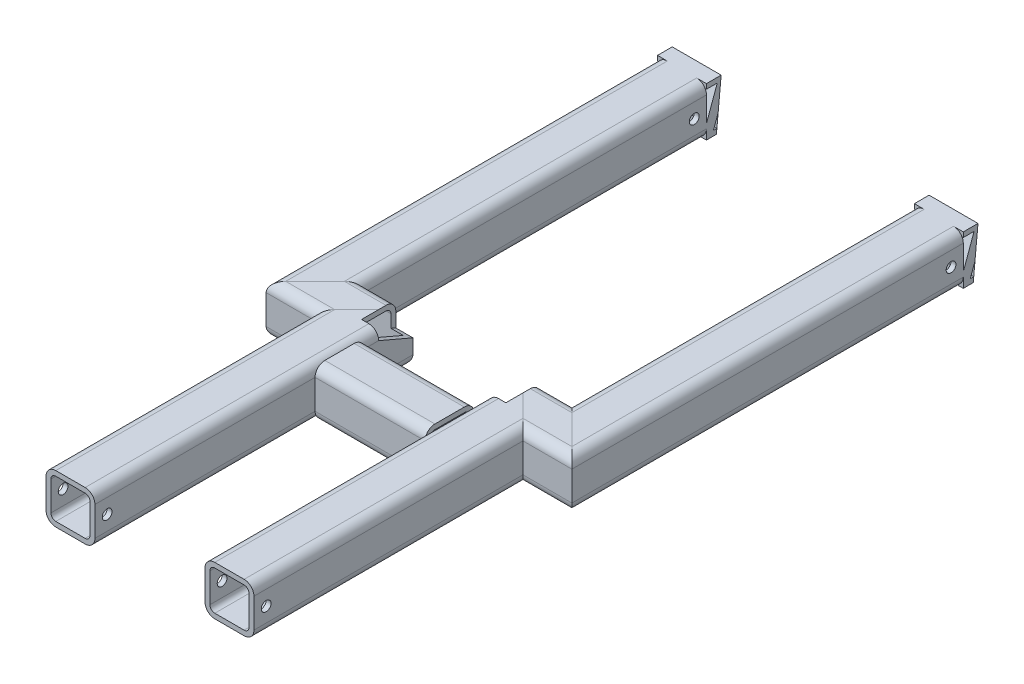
ISO-10303-21;
HEADER;
FILE_DESCRIPTION(('STEP AP214'),'2;1');
FILE_NAME('part.step','',(''),(''),'','','');
FILE_SCHEMA(('AUTOMOTIVE_DESIGN { 1 0 10303 214 1 1 1 1 }'));
ENDSEC;
DATA;
#1=APPLICATION_CONTEXT('core data for automotive mechanical design processes');
#2=APPLICATION_PROTOCOL_DEFINITION('international standard','automotive_design',2000,#1);
#3=PRODUCT_CONTEXT('',#1,'mechanical');
#4=PRODUCT('Part','Part','',(#3));
#5=PRODUCT_RELATED_PRODUCT_CATEGORY('part','',(#4));
#6=PRODUCT_DEFINITION_FORMATION('','',#4);
#7=PRODUCT_DEFINITION_CONTEXT('part definition',#1,'design');
#8=PRODUCT_DEFINITION('design','',#6,#7);
#9=PRODUCT_DEFINITION_SHAPE('','',#8);
#10=(LENGTH_UNIT() NAMED_UNIT(*) SI_UNIT(.MILLI.,.METRE.));
#11=(NAMED_UNIT(*) PLANE_ANGLE_UNIT() SI_UNIT($,.RADIAN.));
#12=(NAMED_UNIT(*) SI_UNIT($,.STERADIAN.) SOLID_ANGLE_UNIT());
#13=UNCERTAINTY_MEASURE_WITH_UNIT(LENGTH_MEASURE(1.E-05),#10,'distance_accuracy_value','');
#14=(GEOMETRIC_REPRESENTATION_CONTEXT(3) GLOBAL_UNCERTAINTY_ASSIGNED_CONTEXT((#13)) GLOBAL_UNIT_ASSIGNED_CONTEXT((#10,
#11,#12)) REPRESENTATION_CONTEXT('',''));
#15=CARTESIAN_POINT('',(0.,0.,0.));
#16=DIRECTION('',(0.,0.,1.));
#17=DIRECTION('',(1.,0.,0.));
#18=AXIS2_PLACEMENT_3D('',#15,#16,#17);
#19=CARTESIAN_POINT('',(-125.182795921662,10.,-170.));
#20=DIRECTION('',(0.,-1.,0.));
#21=DIRECTION('',(0.,0.,-1.));
#22=AXIS2_PLACEMENT_3D('',#19,#20,#21);
#23=PLANE('',#22);
#24=DIRECTION('',(1.,0.,0.));
#25=VECTOR('',#24,1.);
#26=CARTESIAN_POINT('',(-125.182795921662,10.,-176.016608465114));
#27=LINE('',#26,#25);
#28=CARTESIAN_POINT('',(-129.182795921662,10.,-176.016608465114));
#29=VERTEX_POINT('',#28);
#30=CARTESIAN_POINT('',(-109.182795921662,10.,-176.016608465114));
#31=VERTEX_POINT('',#30);
#32=EDGE_CURVE('E404',#29,#31,#27,.T.);
#33=ORIENTED_EDGE('',*,*,#32,.F.);
#34=DIRECTION('',(0.,0.,1.));
#35=VECTOR('',#34,1.);
#36=CARTESIAN_POINT('',(-129.182795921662,10.,0.));
#37=LINE('',#36,#35);
#38=CARTESIAN_POINT('',(-129.182795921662,10.,-170.));
#39=VERTEX_POINT('',#38);
#40=EDGE_CURVE('E414',#29,#39,#37,.T.);
#41=ORIENTED_EDGE('',*,*,#40,.T.);
#42=DIRECTION('',(-1.,0.,0.));
#43=VECTOR('',#42,1.);
#44=CARTESIAN_POINT('',(-109.182795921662,10.,-170.));
#45=LINE('',#44,#43);
#46=CARTESIAN_POINT('',(-125.182795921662,10.,-170.));
#47=VERTEX_POINT('',#46);
#48=EDGE_CURVE('E444',#47,#39,#45,.T.);
#49=ORIENTED_EDGE('',*,*,#48,.F.);
#50=DIRECTION('',(0.,0.,1.));
#51=VECTOR('',#50,1.);
#52=CARTESIAN_POINT('',(-125.182795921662,10.,-170.));
#53=LINE('',#52,#51);
#54=CARTESIAN_POINT('',(-125.182795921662,10.,-14.));
#55=VERTEX_POINT('',#54);
#56=EDGE_CURVE('E608',#47,#55,#53,.T.);
#57=ORIENTED_EDGE('',*,*,#56,.T.);
#58=DIRECTION('',(-0.707106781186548,0.,0.707106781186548));
#59=VECTOR('',#58,1.);
#60=CARTESIAN_POINT('',(-47.1827959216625,10.,-92.));
#61=LINE('',#60,#59);
#62=CARTESIAN_POINT('',(-113.182795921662,10.,-26.));
#63=VERTEX_POINT('',#62);
#64=EDGE_CURVE('E491',#63,#55,#61,.T.);
#65=ORIENTED_EDGE('',*,*,#64,.F.);
#66=DIRECTION('',(0.,0.,1.));
#67=VECTOR('',#66,1.);
#68=CARTESIAN_POINT('',(-113.182795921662,10.,-170.));
#69=LINE('',#68,#67);
#70=CARTESIAN_POINT('',(-113.182795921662,10.,-170.));
#71=VERTEX_POINT('',#70);
#72=EDGE_CURVE('E612',#71,#63,#69,.T.);
#73=ORIENTED_EDGE('',*,*,#72,.F.);
#74=CARTESIAN_POINT('',(-109.182795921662,10.,-170.));
#75=VERTEX_POINT('',#74);
#76=EDGE_CURVE('E439',#75,#71,#45,.T.);
#77=ORIENTED_EDGE('',*,*,#76,.F.);
#78=DIRECTION('',(0.,0.,1.));
#79=VECTOR('',#78,1.);
#80=CARTESIAN_POINT('',(-109.182795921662,10.,0.));
#81=LINE('',#80,#79);
#82=EDGE_CURVE('E417',#31,#75,#81,.T.);
#83=ORIENTED_EDGE('',*,*,#82,.F.);
#84=EDGE_LOOP('',(#33,#41,#49,#57,#65,#73,#77,#83));
#85=FACE_BOUND('',#84,.T.);
#86=ADVANCED_FACE('F86',(#85),#23,.F.);
#87=CARTESIAN_POINT('',(-109.182795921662,-6.,-170.));
#88=DIRECTION('',(-1.,0.,0.));
#89=DIRECTION('',(0.,0.,1.));
#90=AXIS2_PLACEMENT_3D('',#87,#88,#89);
#91=PLANE('',#90);
#92=DIRECTION('',(0.,0.,1.));
#93=VECTOR('',#92,1.);
#94=CARTESIAN_POINT('',(-109.182795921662,-8.,-174.264559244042));
#95=LINE('',#94,#93);
#96=CARTESIAN_POINT('',(-109.182795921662,-8.,-174.264559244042));
#97=VERTEX_POINT('',#96);
#98=CARTESIAN_POINT('',(-109.182795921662,-8.,-172.856296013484));
#99=VERTEX_POINT('',#98);
#100=EDGE_CURVE('E940',#97,#99,#95,.T.);
#101=ORIENTED_EDGE('',*,*,#100,.T.);
#102=DIRECTION('',(0.,0.939692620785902,-0.342020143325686));
#103=VECTOR('',#102,1.);
#104=CARTESIAN_POINT('',(-109.182795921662,-8.,-172.856296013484));
#105=LINE('',#104,#103);
#106=CARTESIAN_POINT('',(-109.182795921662,-2.72560587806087,-174.776018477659));
#107=VERTEX_POINT('',#106);
#108=EDGE_CURVE('E931',#99,#107,#105,.T.);
#109=ORIENTED_EDGE('',*,*,#108,.T.);
#110=DIRECTION('',(0.,-0.995331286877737,0.0965175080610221));
#111=VECTOR('',#110,1.);
#112=CARTESIAN_POINT('',(-109.182795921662,-8.,-174.264559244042));
#113=LINE('',#112,#111);
#114=EDGE_CURVE('E935',#107,#97,#113,.T.);
#115=ORIENTED_EDGE('',*,*,#114,.T.);
#116=EDGE_LOOP('',(#101,#109,#115));
#117=FACE_BOUND('',#116,.T.);
#118=CARTESIAN_POINT('',(-109.182795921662,0.,-165.));
#119=DIRECTION('',(-1.,0.,0.));
#120=DIRECTION('',(0.,0.,1.));
#121=AXIS2_PLACEMENT_3D('',#118,#119,#120);
#122=CIRCLE('',#121,2.);
#123=CARTESIAN_POINT('',(-109.182795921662,0.,-163.));
#124=VERTEX_POINT('',#123);
#125=EDGE_CURVE('E470',#124,#124,#122,.T.);
#126=ORIENTED_EDGE('',*,*,#125,.T.);
#127=EDGE_LOOP('',(#126));
#128=FACE_BOUND('',#127,.T.);
#129=DIRECTION('',(0.,-0.995331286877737,0.0965175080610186));
#130=VECTOR('',#129,1.);
#131=CARTESIAN_POINT('',(-109.182795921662,-6.42894682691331,-174.423489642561));
#132=LINE('',#131,#130);
#133=CARTESIAN_POINT('',(-109.182795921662,-10.,-174.07720377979));
#134=VERTEX_POINT('',#133);
#135=EDGE_CURVE('E420',#31,#134,#132,.T.);
#136=ORIENTED_EDGE('',*,*,#135,.F.);
#137=ORIENTED_EDGE('',*,*,#82,.T.);
#138=DIRECTION('',(0.,1.,0.));
#139=VECTOR('',#138,1.);
#140=CARTESIAN_POINT('',(-109.182795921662,0.,-170.));
#141=LINE('',#140,#139);
#142=CARTESIAN_POINT('',(-109.182795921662,8.,-170.));
#143=VERTEX_POINT('',#142);
#144=EDGE_CURVE('E977',#143,#75,#141,.T.);
#145=ORIENTED_EDGE('',*,*,#144,.F.);
#146=DIRECTION('',(0.,0.,1.));
#147=VECTOR('',#146,1.);
#148=CARTESIAN_POINT('',(-109.182795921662,8.,0.));
#149=LINE('',#148,#147);
#150=CARTESIAN_POINT('',(-109.182795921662,8.,-174.42310867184));
#151=VERTEX_POINT('',#150);
#152=EDGE_CURVE('E973',#151,#143,#149,.T.);
#153=ORIENTED_EDGE('',*,*,#152,.F.);
#154=DIRECTION('',(0.,-0.939692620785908,0.342020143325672));
#155=VECTOR('',#154,1.);
#156=CARTESIAN_POINT('',(-109.182795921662,-55.12268432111,-151.448330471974));
#157=LINE('',#156,#155);
#158=CARTESIAN_POINT('',(-109.182795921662,-4.15239119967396,-170.));
#159=VERTEX_POINT('',#158);
#160=EDGE_CURVE('E433',#151,#159,#157,.T.);
#161=ORIENTED_EDGE('',*,*,#160,.T.);
#162=DIRECTION('',(0.,-1.,0.));
#163=VECTOR('',#162,1.);
#164=CARTESIAN_POINT('',(-109.182795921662,-6.,-170.));
#165=LINE('',#164,#163);
#166=CARTESIAN_POINT('',(-109.182795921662,6.,-170.));
#167=VERTEX_POINT('',#166);
#168=EDGE_CURVE('E500',#167,#159,#165,.T.);
#169=ORIENTED_EDGE('',*,*,#168,.F.);
#170=DIRECTION('',(0.,0.,1.));
#171=VECTOR('',#170,1.);
#172=CARTESIAN_POINT('',(-109.182795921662,6.,-170.));
#173=LINE('',#172,#171);
#174=CARTESIAN_POINT('',(-109.182795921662,6.,-30.));
#175=VERTEX_POINT('',#174);
#176=EDGE_CURVE('E616',#167,#175,#173,.T.);
#177=ORIENTED_EDGE('',*,*,#176,.T.);
#178=DIRECTION('',(0.,1.,0.));
#179=VECTOR('',#178,1.);
#180=CARTESIAN_POINT('',(-109.182795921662,-6.00000000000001,-30.));
#181=LINE('',#180,#179);
#182=CARTESIAN_POINT('',(-109.182795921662,-6.,-30.));
#183=VERTEX_POINT('',#182);
#184=EDGE_CURVE('E569',#183,#175,#181,.T.);
#185=ORIENTED_EDGE('',*,*,#184,.F.);
#186=DIRECTION('',(0.,0.,1.));
#187=VECTOR('',#186,1.);
#188=CARTESIAN_POINT('',(-109.182795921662,-6.,-170.));
#189=LINE('',#188,#187);
#190=CARTESIAN_POINT('',(-109.182795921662,-6.,-170.));
#191=VERTEX_POINT('',#190);
#192=EDGE_CURVE('E620',#191,#183,#189,.T.);
#193=ORIENTED_EDGE('',*,*,#192,.F.);
#194=DIRECTION('',(0.,1.,0.));
#195=VECTOR('',#194,1.);
#196=CARTESIAN_POINT('',(-109.182795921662,0.,-170.));
#197=LINE('',#196,#195);
#198=CARTESIAN_POINT('',(-109.182795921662,-10.,-170.));
#199=VERTEX_POINT('',#198);
#200=EDGE_CURVE('E428',#199,#191,#197,.T.);
#201=ORIENTED_EDGE('',*,*,#200,.F.);
#202=DIRECTION('',(0.,0.,1.));
#203=VECTOR('',#202,1.);
#204=CARTESIAN_POINT('',(-109.182795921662,-10.,-170.));
#205=LINE('',#204,#203);
#206=EDGE_CURVE('E964',#134,#199,#205,.T.);
#207=ORIENTED_EDGE('',*,*,#206,.F.);
#208=EDGE_LOOP('',(#136,#137,#145,#153,#161,#169,#177,#185,#193,#201,#207));
#209=FACE_BOUND('',#208,.T.);
#210=ADVANCED_FACE('F1039',(#117,#128,#209),#91,.F.);
#211=CARTESIAN_POINT('',(-113.182795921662,-10.,-170.));
#212=DIRECTION('',(0.,1.,0.));
#213=DIRECTION('',(0.,0.,1.));
#214=AXIS2_PLACEMENT_3D('',#211,#212,#213);
#215=PLANE('',#214);
#216=DIRECTION('',(-1.,0.,0.));
#217=VECTOR('',#216,1.);
#218=CARTESIAN_POINT('',(-113.182795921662,-10.,-174.07720377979));
#219=LINE('',#218,#217);
#220=CARTESIAN_POINT('',(-129.182795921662,-10.,-174.07720377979));
#221=VERTEX_POINT('',#220);
#222=EDGE_CURVE('E102',#134,#221,#219,.T.);
#223=ORIENTED_EDGE('',*,*,#222,.F.);
#224=ORIENTED_EDGE('',*,*,#206,.T.);
#225=DIRECTION('',(-1.,0.,0.));
#226=VECTOR('',#225,1.);
#227=CARTESIAN_POINT('',(-109.182795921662,-10.,-170.));
#228=LINE('',#227,#226);
#229=CARTESIAN_POINT('',(-113.182795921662,-10.,-170.));
#230=VERTEX_POINT('',#229);
#231=EDGE_CURVE('E457',#199,#230,#228,.T.);
#232=ORIENTED_EDGE('',*,*,#231,.T.);
#233=DIRECTION('',(0.,0.,1.));
#234=VECTOR('',#233,1.);
#235=CARTESIAN_POINT('',(-113.182795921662,-10.,-170.));
#236=LINE('',#235,#234);
#237=CARTESIAN_POINT('',(-113.182795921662,-10.,-26.));
#238=VERTEX_POINT('',#237);
#239=EDGE_CURVE('E624',#230,#238,#236,.T.);
#240=ORIENTED_EDGE('',*,*,#239,.T.);
#241=DIRECTION('',(0.707106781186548,0.,-0.707106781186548));
#242=VECTOR('',#241,1.);
#243=CARTESIAN_POINT('',(-41.1827959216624,-10.,-98.));
#244=LINE('',#243,#242);
#245=CARTESIAN_POINT('',(-125.182795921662,-10.,-14.));
#246=VERTEX_POINT('',#245);
#247=EDGE_CURVE('E575',#246,#238,#244,.T.);
#248=ORIENTED_EDGE('',*,*,#247,.F.);
#249=DIRECTION('',(0.,0.,1.));
#250=VECTOR('',#249,1.);
#251=CARTESIAN_POINT('',(-125.182795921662,-10.,-170.));
#252=LINE('',#251,#250);
#253=CARTESIAN_POINT('',(-125.182795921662,-10.,-170.));
#254=VERTEX_POINT('',#253);
#255=EDGE_CURVE('E628',#254,#246,#252,.T.);
#256=ORIENTED_EDGE('',*,*,#255,.F.);
#257=CARTESIAN_POINT('',(-129.182795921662,-10.,-170.));
#258=VERTEX_POINT('',#257);
#259=EDGE_CURVE('E461',#254,#258,#228,.T.);
#260=ORIENTED_EDGE('',*,*,#259,.T.);
#261=DIRECTION('',(0.,0.,1.));
#262=VECTOR('',#261,1.);
#263=CARTESIAN_POINT('',(-129.182795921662,-10.,-170.));
#264=LINE('',#263,#262);
#265=EDGE_CURVE('E957',#221,#258,#264,.T.);
#266=ORIENTED_EDGE('',*,*,#265,.F.);
#267=EDGE_LOOP('',(#223,#224,#232,#240,#248,#256,#260,#266));
#268=FACE_BOUND('',#267,.T.);
#269=ADVANCED_FACE('F1009',(#268),#215,.F.);
#270=CARTESIAN_POINT('',(-129.182795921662,6.,-170.));
#271=DIRECTION('',(1.,0.,0.));
#272=DIRECTION('',(0.,0.,-1.));
#273=AXIS2_PLACEMENT_3D('',#270,#271,#272);
#274=PLANE('',#273);
#275=DIRECTION('',(0.,0.939692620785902,-0.342020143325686));
#276=VECTOR('',#275,1.);
#277=CARTESIAN_POINT('',(-129.182795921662,-8.,-172.856296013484));
#278=LINE('',#277,#276);
#279=CARTESIAN_POINT('',(-129.182795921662,-8.,-172.856296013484));
#280=VERTEX_POINT('',#279);
#281=CARTESIAN_POINT('',(-129.182795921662,-2.72560587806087,-174.776018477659));
#282=VERTEX_POINT('',#281);
#283=EDGE_CURVE('E930',#280,#282,#278,.T.);
#284=ORIENTED_EDGE('',*,*,#283,.F.);
#285=DIRECTION('',(0.,0.,1.));
#286=VECTOR('',#285,1.);
#287=CARTESIAN_POINT('',(-129.182795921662,-8.,-174.264559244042));
#288=LINE('',#287,#286);
#289=CARTESIAN_POINT('',(-129.182795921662,-8.,-174.264559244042));
#290=VERTEX_POINT('',#289);
#291=EDGE_CURVE('E936',#290,#280,#288,.T.);
#292=ORIENTED_EDGE('',*,*,#291,.F.);
#293=DIRECTION('',(0.,-0.995331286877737,0.0965175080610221));
#294=VECTOR('',#293,1.);
#295=CARTESIAN_POINT('',(-129.182795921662,-8.,-174.264559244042));
#296=LINE('',#295,#294);
#297=EDGE_CURVE('E947',#282,#290,#296,.T.);
#298=ORIENTED_EDGE('',*,*,#297,.F.);
#299=EDGE_LOOP('',(#284,#292,#298));
#300=FACE_BOUND('',#299,.T.);
#301=CARTESIAN_POINT('',(-129.182795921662,0.,-165.));
#302=DIRECTION('',(1.,0.,0.));
#303=DIRECTION('',(0.,0.,-1.));
#304=AXIS2_PLACEMENT_3D('',#301,#302,#303);
#305=CIRCLE('',#304,2.);
#306=CARTESIAN_POINT('',(-129.182795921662,0.,-167.));
#307=VERTEX_POINT('',#306);
#308=EDGE_CURVE('E443',#307,#307,#305,.T.);
#309=ORIENTED_EDGE('',*,*,#308,.T.);
#310=EDGE_LOOP('',(#309));
#311=FACE_BOUND('',#310,.T.);
#312=DIRECTION('',(0.,-0.995331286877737,0.0965175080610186));
#313=VECTOR('',#312,1.);
#314=CARTESIAN_POINT('',(-129.182795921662,13.5722138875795,-176.363006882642));
#315=LINE('',#314,#313);
#316=EDGE_CURVE('E401',#29,#221,#315,.T.);
#317=ORIENTED_EDGE('',*,*,#316,.T.);
#318=ORIENTED_EDGE('',*,*,#265,.T.);
#319=DIRECTION('',(0.,1.,0.));
#320=VECTOR('',#319,1.);
#321=CARTESIAN_POINT('',(-129.182795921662,0.,-170.));
#322=LINE('',#321,#320);
#323=CARTESIAN_POINT('',(-129.182795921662,-6.,-170.));
#324=VERTEX_POINT('',#323);
#325=EDGE_CURVE('E967',#258,#324,#322,.T.);
#326=ORIENTED_EDGE('',*,*,#325,.T.);
#327=DIRECTION('',(0.,0.,1.));
#328=VECTOR('',#327,1.);
#329=CARTESIAN_POINT('',(-129.182795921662,-6.,-170.));
#330=LINE('',#329,#328);
#331=CARTESIAN_POINT('',(-129.182795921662,-6.,-9.99999999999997));
#332=VERTEX_POINT('',#331);
#333=EDGE_CURVE('E516',#324,#332,#330,.T.);
#334=ORIENTED_EDGE('',*,*,#333,.T.);
#335=DIRECTION('',(0.,-1.,0.));
#336=VECTOR('',#335,1.);
#337=CARTESIAN_POINT('',(-129.182795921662,6.00000000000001,-9.99999999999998));
#338=LINE('',#337,#336);
#339=CARTESIAN_POINT('',(-129.182795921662,6.00000000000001,-10.));
#340=VERTEX_POINT('',#339);
#341=EDGE_CURVE('E562',#340,#332,#338,.T.);
#342=ORIENTED_EDGE('',*,*,#341,.F.);
#343=DIRECTION('',(0.,0.,1.));
#344=VECTOR('',#343,1.);
#345=CARTESIAN_POINT('',(-129.182795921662,6.,-170.));
#346=LINE('',#345,#344);
#347=CARTESIAN_POINT('',(-129.182795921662,6.,-170.));
#348=VERTEX_POINT('',#347);
#349=EDGE_CURVE('E487',#348,#340,#346,.T.);
#350=ORIENTED_EDGE('',*,*,#349,.F.);
#351=DIRECTION('',(0.,1.,0.));
#352=VECTOR('',#351,1.);
#353=CARTESIAN_POINT('',(-129.182795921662,6.,-170.));
#354=LINE('',#353,#352);
#355=CARTESIAN_POINT('',(-129.182795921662,-4.1523911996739,-170.));
#356=VERTEX_POINT('',#355);
#357=EDGE_CURVE('E488',#356,#348,#354,.T.);
#358=ORIENTED_EDGE('',*,*,#357,.F.);
#359=DIRECTION('',(0.,-0.939692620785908,0.342020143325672));
#360=VECTOR('',#359,1.);
#361=CARTESIAN_POINT('',(-129.182795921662,-55.12268432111,-151.448330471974));
#362=LINE('',#361,#360);
#363=CARTESIAN_POINT('',(-129.182795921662,8.,-174.42310867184));
#364=VERTEX_POINT('',#363);
#365=EDGE_CURVE('E986',#364,#356,#362,.T.);
#366=ORIENTED_EDGE('',*,*,#365,.F.);
#367=DIRECTION('',(0.,0.,1.));
#368=VECTOR('',#367,1.);
#369=CARTESIAN_POINT('',(-129.182795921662,8.,0.));
#370=LINE('',#369,#368);
#371=CARTESIAN_POINT('',(-129.182795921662,8.,-170.));
#372=VERTEX_POINT('',#371);
#373=EDGE_CURVE('E435',#364,#372,#370,.T.);
#374=ORIENTED_EDGE('',*,*,#373,.T.);
#375=DIRECTION('',(0.,1.,0.));
#376=VECTOR('',#375,1.);
#377=CARTESIAN_POINT('',(-129.182795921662,0.,-170.));
#378=LINE('',#377,#376);
#379=EDGE_CURVE('E426',#372,#39,#378,.T.);
#380=ORIENTED_EDGE('',*,*,#379,.T.);
#381=ORIENTED_EDGE('',*,*,#40,.F.);
#382=EDGE_LOOP('',(#317,#318,#326,#334,#342,#350,#358,#366,#374,#380,#381));
#383=FACE_BOUND('',#382,.T.);
#384=ADVANCED_FACE('F423',(#300,#311,#383),#274,.F.);
#385=CARTESIAN_POINT('',(-105.182795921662,10.,-20.));
#386=DIRECTION('',(0.,-1.,0.));
#387=DIRECTION('',(0.,0.,-1.));
#388=AXIS2_PLACEMENT_3D('',#385,#386,#387);
#389=PLANE('',#388);
#390=DIRECTION('',(1.,0.,0.));
#391=VECTOR('',#390,1.);
#392=CARTESIAN_POINT('',(-105.182795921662,10.,-16.));
#393=LINE('',#392,#391);
#394=CARTESIAN_POINT('',(-96.1827959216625,10.,-16.));
#395=VERTEX_POINT('',#394);
#396=CARTESIAN_POINT('',(-93.1827959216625,10.,-16.));
#397=VERTEX_POINT('',#396);
#398=EDGE_CURVE('E927',#395,#397,#393,.T.);
#399=ORIENTED_EDGE('',*,*,#398,.F.);
#400=DIRECTION('',(0.,0.,-1.));
#401=VECTOR('',#400,1.);
#402=CARTESIAN_POINT('',(-96.1827959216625,10.,-20.));
#403=LINE('',#402,#401);
#404=CARTESIAN_POINT('',(-96.1827959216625,10.,-23.));
#405=VERTEX_POINT('',#404);
#406=EDGE_CURVE('E910',#395,#405,#403,.T.);
#407=ORIENTED_EDGE('',*,*,#406,.T.);
#408=DIRECTION('',(-0.707106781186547,0.,0.707106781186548));
#409=VECTOR('',#408,1.);
#410=CARTESIAN_POINT('',(-112.182795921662,10.,-7.00000000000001));
#411=LINE('',#410,#409);
#412=CARTESIAN_POINT('',(-105.182795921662,10.,-14.));
#413=VERTEX_POINT('',#412);
#414=EDGE_CURVE('E665',#405,#413,#411,.T.);
#415=ORIENTED_EDGE('',*,*,#414,.T.);
#416=DIRECTION('',(0.,0.,1.));
#417=VECTOR('',#416,1.);
#418=CARTESIAN_POINT('',(-105.182795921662,10.,-20.));
#419=LINE('',#418,#417);
#420=CARTESIAN_POINT('',(-105.182795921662,10.,100.));
#421=VERTEX_POINT('',#420);
#422=EDGE_CURVE('E799',#413,#421,#419,.T.);
#423=ORIENTED_EDGE('',*,*,#422,.T.);
#424=DIRECTION('',(1.,0.,0.));
#425=VECTOR('',#424,1.);
#426=CARTESIAN_POINT('',(-105.182795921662,10.,100.));
#427=LINE('',#426,#425);
#428=CARTESIAN_POINT('',(-93.1827959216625,10.,100.));
#429=VERTEX_POINT('',#428);
#430=EDGE_CURVE('E795',#421,#429,#427,.T.);
#431=ORIENTED_EDGE('',*,*,#430,.T.);
#432=DIRECTION('',(0.,0.,1.));
#433=VECTOR('',#432,1.);
#434=CARTESIAN_POINT('',(-93.1827959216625,10.,-20.));
#435=LINE('',#434,#433);
#436=EDGE_CURVE('E794',#397,#429,#435,.T.);
#437=ORIENTED_EDGE('',*,*,#436,.F.);
#438=EDGE_LOOP('',(#399,#407,#415,#423,#431,#437));
#439=FACE_BOUND('',#438,.T.);
#440=ADVANCED_FACE('F1217',(#439),#389,.F.);
#441=CARTESIAN_POINT('',(-93.1827959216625,6.,-20.));
#442=DIRECTION('',(0.,0.,1.));
#443=DIRECTION('',(1.,0.,0.));
#444=AXIS2_PLACEMENT_3D('',#441,#442,#443);
#445=CYLINDRICAL_SURFACE('',#444,4.);
#446=CARTESIAN_POINT('',(-93.1827959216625,6.,-16.));
#447=DIRECTION('',(0.,0.,-1.));
#448=DIRECTION('',(-1.,0.,0.));
#449=AXIS2_PLACEMENT_3D('',#446,#447,#448);
#450=CIRCLE('',#449,4.);
#451=CARTESIAN_POINT('',(-89.1827959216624,6.,-16.));
#452=VERTEX_POINT('',#451);
#453=EDGE_CURVE('E924',#397,#452,#450,.T.);
#454=ORIENTED_EDGE('',*,*,#453,.F.);
#455=ORIENTED_EDGE('',*,*,#436,.T.);
#456=CARTESIAN_POINT('',(-93.1827959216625,6.,99.9999999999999));
#457=DIRECTION('',(0.,0.,-1.));
#458=DIRECTION('',(-1.,0.,0.));
#459=AXIS2_PLACEMENT_3D('',#456,#457,#458);
#460=CIRCLE('',#459,4.);
#461=CARTESIAN_POINT('',(-89.1827959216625,6.,100.));
#462=VERTEX_POINT('',#461);
#463=EDGE_CURVE('E790',#429,#462,#460,.T.);
#464=ORIENTED_EDGE('',*,*,#463,.T.);
#465=DIRECTION('',(0.,0.,1.));
#466=VECTOR('',#465,1.);
#467=CARTESIAN_POINT('',(-89.1827959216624,6.,-20.));
#468=LINE('',#467,#466);
#469=EDGE_CURVE('E789',#452,#462,#468,.T.);
#470=ORIENTED_EDGE('',*,*,#469,.F.);
#471=EDGE_LOOP('',(#454,#455,#464,#470));
#472=FACE_BOUND('',#471,.T.);
#473=ADVANCED_FACE('F1214',(#472),#445,.T.);
#474=CARTESIAN_POINT('',(-89.1827959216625,-6.,-20.));
#475=DIRECTION('',(-1.,0.,0.));
#476=DIRECTION('',(0.,0.,1.));
#477=AXIS2_PLACEMENT_3D('',#474,#475,#476);
#478=PLANE('',#477);
#479=CARTESIAN_POINT('',(-89.1827959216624,0.,95.));
#480=DIRECTION('',(-1.,0.,0.));
#481=DIRECTION('',(0.,0.,1.));
#482=AXIS2_PLACEMENT_3D('',#479,#480,#481);
#483=CIRCLE('',#482,2.);
#484=CARTESIAN_POINT('',(-89.1827959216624,0.,97.));
#485=VERTEX_POINT('',#484);
#486=EDGE_CURVE('E483',#485,#485,#483,.T.);
#487=ORIENTED_EDGE('',*,*,#486,.T.);
#488=EDGE_LOOP('',(#487));
#489=FACE_BOUND('',#488,.T.);
#490=DIRECTION('',(0.,-0.393919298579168,-0.919145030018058));
#491=VECTOR('',#490,1.);
#492=CARTESIAN_POINT('',(-89.1827959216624,2.6896551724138,-23.7241379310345));
#493=LINE('',#492,#491);
#494=CARTESIAN_POINT('',(-89.1827959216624,0.,-30.));
#495=VERTEX_POINT('',#494);
#496=EDGE_CURVE('E909',#452,#495,#493,.T.);
#497=ORIENTED_EDGE('',*,*,#496,.F.);
#498=ORIENTED_EDGE('',*,*,#469,.T.);
#499=DIRECTION('',(0.,-1.,0.));
#500=VECTOR('',#499,1.);
#501=CARTESIAN_POINT('',(-89.1827959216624,-6.,99.9999999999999));
#502=LINE('',#501,#500);
#503=CARTESIAN_POINT('',(-89.1827959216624,-6.,99.9999999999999));
#504=VERTEX_POINT('',#503);
#505=EDGE_CURVE('E785',#462,#504,#502,.T.);
#506=ORIENTED_EDGE('',*,*,#505,.T.);
#507=DIRECTION('',(0.,0.,1.));
#508=VECTOR('',#507,1.);
#509=CARTESIAN_POINT('',(-89.1827959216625,-6.,-20.));
#510=LINE('',#509,#508);
#511=CARTESIAN_POINT('',(-89.1827959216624,-6.,-30.));
#512=VERTEX_POINT('',#511);
#513=EDGE_CURVE('E784',#512,#504,#510,.T.);
#514=ORIENTED_EDGE('',*,*,#513,.F.);
#515=DIRECTION('',(0.,1.,0.));
#516=VECTOR('',#515,1.);
#517=CARTESIAN_POINT('',(-89.1827959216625,-6.,-30.));
#518=LINE('',#517,#516);
#519=EDGE_CURVE('E668',#512,#495,#518,.T.);
#520=ORIENTED_EDGE('',*,*,#519,.T.);
#521=EDGE_LOOP('',(#497,#498,#506,#514,#520));
#522=FACE_BOUND('',#521,.T.);
#523=ADVANCED_FACE('F1196',(#489,#522),#478,.F.);
#524=CARTESIAN_POINT('',(-93.1827959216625,6.,-20.));
#525=DIRECTION('',(0.,0.,1.));
#526=DIRECTION('',(1.,0.,0.));
#527=AXIS2_PLACEMENT_3D('',#524,#525,#526);
#528=CYLINDRICAL_SURFACE('',#527,2.);
#529=DIRECTION('',(0.,0.,1.));
#530=VECTOR('',#529,1.);
#531=CARTESIAN_POINT('',(-93.1827959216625,8.,-20.));
#532=LINE('',#531,#530);
#533=CARTESIAN_POINT('',(-93.1827959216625,8.,-16.));
#534=VERTEX_POINT('',#533);
#535=CARTESIAN_POINT('',(-93.1827959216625,8.,100.));
#536=VERTEX_POINT('',#535);
#537=EDGE_CURVE('E853',#534,#536,#532,.T.);
#538=ORIENTED_EDGE('',*,*,#537,.F.);
#539=CARTESIAN_POINT('',(-93.1827959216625,6.,-16.));
#540=DIRECTION('',(0.,0.,-1.));
#541=DIRECTION('',(-1.,0.,0.));
#542=AXIS2_PLACEMENT_3D('',#539,#540,#541);
#543=CIRCLE('',#542,2.);
#544=CARTESIAN_POINT('',(-91.1827959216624,6.,-16.));
#545=VERTEX_POINT('',#544);
#546=EDGE_CURVE('E914',#534,#545,#543,.T.);
#547=ORIENTED_EDGE('',*,*,#546,.T.);
#548=DIRECTION('',(0.,0.,1.));
#549=VECTOR('',#548,1.);
#550=CARTESIAN_POINT('',(-91.1827959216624,6.,-20.));
#551=LINE('',#550,#549);
#552=CARTESIAN_POINT('',(-91.1827959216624,6.,100.));
#553=VERTEX_POINT('',#552);
#554=EDGE_CURVE('E773',#545,#553,#551,.T.);
#555=ORIENTED_EDGE('',*,*,#554,.T.);
#556=CARTESIAN_POINT('',(-93.1827959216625,6.,99.9999999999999));
#557=DIRECTION('',(0.,0.,-1.));
#558=DIRECTION('',(-1.,0.,0.));
#559=AXIS2_PLACEMENT_3D('',#556,#557,#558);
#560=CIRCLE('',#559,2.);
#561=EDGE_CURVE('E767',#536,#553,#560,.T.);
#562=ORIENTED_EDGE('',*,*,#561,.F.);
#563=EDGE_LOOP('',(#538,#547,#555,#562));
#564=FACE_BOUND('',#563,.T.);
#565=ADVANCED_FACE('F1192',(#564),#528,.F.);
#566=CARTESIAN_POINT('',(-105.182795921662,8.,-20.));
#567=DIRECTION('',(0.,-1.,0.));
#568=DIRECTION('',(0.,0.,-1.));
#569=AXIS2_PLACEMENT_3D('',#566,#567,#568);
#570=PLANE('',#569);
#571=DIRECTION('',(0.,0.,-1.));
#572=VECTOR('',#571,1.);
#573=CARTESIAN_POINT('',(-96.1827959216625,8.,-20.));
#574=LINE('',#573,#572);
#575=CARTESIAN_POINT('',(-96.1827959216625,8.,-16.));
#576=VERTEX_POINT('',#575);
#577=CARTESIAN_POINT('',(-96.1827959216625,8.,-23.));
#578=VERTEX_POINT('',#577);
#579=EDGE_CURVE('E1257',#576,#578,#574,.T.);
#580=ORIENTED_EDGE('',*,*,#579,.F.);
#581=DIRECTION('',(1.,0.,0.));
#582=VECTOR('',#581,1.);
#583=CARTESIAN_POINT('',(-105.182795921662,8.,-16.));
#584=LINE('',#583,#582);
#585=EDGE_CURVE('E13',#576,#534,#584,.T.);
#586=ORIENTED_EDGE('',*,*,#585,.T.);
#587=ORIENTED_EDGE('',*,*,#537,.T.);
#588=DIRECTION('',(1.,0.,0.));
#589=VECTOR('',#588,1.);
#590=CARTESIAN_POINT('',(-105.182795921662,8.,100.));
#591=LINE('',#590,#589);
#592=CARTESIAN_POINT('',(-105.182795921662,8.,100.));
#593=VERTEX_POINT('',#592);
#594=EDGE_CURVE('E828',#593,#536,#591,.T.);
#595=ORIENTED_EDGE('',*,*,#594,.F.);
#596=DIRECTION('',(0.,0.,1.));
#597=VECTOR('',#596,1.);
#598=CARTESIAN_POINT('',(-105.182795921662,8.,-20.));
#599=LINE('',#598,#597);
#600=CARTESIAN_POINT('',(-105.182795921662,8.,-14.));
#601=VERTEX_POINT('',#600);
#602=EDGE_CURVE('E856',#601,#593,#599,.T.);
#603=ORIENTED_EDGE('',*,*,#602,.F.);
#604=DIRECTION('',(-0.707106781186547,0.,0.707106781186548));
#605=VECTOR('',#604,1.);
#606=CARTESIAN_POINT('',(-112.182795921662,8.,-7.00000000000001));
#607=LINE('',#606,#605);
#608=EDGE_CURVE('E682',#578,#601,#607,.T.);
#609=ORIENTED_EDGE('',*,*,#608,.F.);
#610=EDGE_LOOP('',(#580,#586,#587,#595,#603,#609));
#611=FACE_BOUND('',#610,.T.);
#612=ADVANCED_FACE('F1167',(#611),#570,.T.);
#613=CARTESIAN_POINT('',(-91.1827959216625,-6.,-20.));
#614=DIRECTION('',(-1.,0.,0.));
#615=DIRECTION('',(0.,0.,1.));
#616=AXIS2_PLACEMENT_3D('',#613,#614,#615);
#617=PLANE('',#616);
#618=CARTESIAN_POINT('',(-91.1827959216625,0.,95.));
#619=DIRECTION('',(-1.,0.,0.));
#620=DIRECTION('',(0.,0.,1.));
#621=AXIS2_PLACEMENT_3D('',#618,#619,#620);
#622=CIRCLE('',#621,2.);
#623=CARTESIAN_POINT('',(-91.1827959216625,0.,97.));
#624=VERTEX_POINT('',#623);
#625=EDGE_CURVE('E475',#624,#624,#622,.T.);
#626=ORIENTED_EDGE('',*,*,#625,.F.);
#627=EDGE_LOOP('',(#626));
#628=FACE_BOUND('',#627,.T.);
#629=ORIENTED_EDGE('',*,*,#554,.F.);
#630=DIRECTION('',(0.,-0.393919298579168,-0.919145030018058));
#631=VECTOR('',#630,1.);
#632=CARTESIAN_POINT('',(-91.1827959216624,2.6896551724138,-23.7241379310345));
#633=LINE('',#632,#631);
#634=CARTESIAN_POINT('',(-91.1827959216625,0.85714285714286,-28.));
#635=VERTEX_POINT('',#634);
#636=EDGE_CURVE('E902',#545,#635,#633,.T.);
#637=ORIENTED_EDGE('',*,*,#636,.T.);
#638=DIRECTION('',(0.,1.,0.));
#639=VECTOR('',#638,1.);
#640=CARTESIAN_POINT('',(-91.1827959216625,-6.,-28.));
#641=LINE('',#640,#639);
#642=CARTESIAN_POINT('',(-91.1827959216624,-6.,-28.));
#643=VERTEX_POINT('',#642);
#644=EDGE_CURVE('E654',#643,#635,#641,.T.);
#645=ORIENTED_EDGE('',*,*,#644,.F.);
#646=DIRECTION('',(0.,0.,1.));
#647=VECTOR('',#646,1.);
#648=CARTESIAN_POINT('',(-91.1827959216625,-6.,-20.));
#649=LINE('',#648,#647);
#650=CARTESIAN_POINT('',(-91.1827959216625,-6.,100.));
#651=VERTEX_POINT('',#650);
#652=EDGE_CURVE('E850',#643,#651,#649,.T.);
#653=ORIENTED_EDGE('',*,*,#652,.T.);
#654=DIRECTION('',(0.,-1.,0.));
#655=VECTOR('',#654,1.);
#656=CARTESIAN_POINT('',(-91.1827959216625,-6.,100.));
#657=LINE('',#656,#655);
#658=EDGE_CURVE('E804',#553,#651,#657,.T.);
#659=ORIENTED_EDGE('',*,*,#658,.F.);
#660=EDGE_LOOP('',(#629,#637,#645,#653,#659));
#661=FACE_BOUND('',#660,.T.);
#662=ADVANCED_FACE('F906',(#628,#661),#617,.T.);
#663=CARTESIAN_POINT('',(-119.182795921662,-6.,-30.));
#664=DIRECTION('',(0.,0.,1.));
#665=DIRECTION('',(1.,0.,0.));
#666=AXIS2_PLACEMENT_3D('',#663,#664,#665);
#667=PLANE('',#666);
#668=DIRECTION('',(-1.,0.,0.));
#669=VECTOR('',#668,1.);
#670=CARTESIAN_POINT('',(-37.1827959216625,0.,-30.));
#671=LINE('',#670,#669);
#672=CARTESIAN_POINT('',(-96.1827959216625,0.,-30.));
#673=VERTEX_POINT('',#672);
#674=EDGE_CURVE('E1240',#495,#673,#671,.T.);
#675=ORIENTED_EDGE('',*,*,#674,.F.);
#676=ORIENTED_EDGE('',*,*,#519,.F.);
#677=DIRECTION('',(1.,0.,0.));
#678=VECTOR('',#677,1.);
#679=CARTESIAN_POINT('',(-119.182795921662,-6.,-30.));
#680=LINE('',#679,#678);
#681=EDGE_CURVE('E744',#183,#512,#680,.T.);
#682=ORIENTED_EDGE('',*,*,#681,.F.);
#683=ORIENTED_EDGE('',*,*,#184,.T.);
#684=DIRECTION('',(1.,0.,0.));
#685=VECTOR('',#684,1.);
#686=CARTESIAN_POINT('',(-119.182795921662,6.00000000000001,-30.));
#687=LINE('',#686,#685);
#688=CARTESIAN_POINT('',(-96.1827959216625,6.,-30.));
#689=VERTEX_POINT('',#688);
#690=EDGE_CURVE('E748',#175,#689,#687,.T.);
#691=ORIENTED_EDGE('',*,*,#690,.T.);
#692=DIRECTION('',(0.,1.,0.));
#693=VECTOR('',#692,1.);
#694=CARTESIAN_POINT('',(-96.1827959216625,0.,-30.));
#695=LINE('',#694,#693);
#696=EDGE_CURVE('E1242',#673,#689,#695,.T.);
#697=ORIENTED_EDGE('',*,*,#696,.F.);
#698=EDGE_LOOP('',(#675,#676,#682,#683,#691,#697));
#699=FACE_BOUND('',#698,.T.);
#700=ADVANCED_FACE('F1047',(#699),#667,.F.);
#701=CARTESIAN_POINT('',(-119.182795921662,-6.,-28.));
#702=DIRECTION('',(0.,0.,1.));
#703=DIRECTION('',(1.,0.,0.));
#704=AXIS2_PLACEMENT_3D('',#701,#702,#703);
#705=PLANE('',#704);
#706=ORIENTED_EDGE('',*,*,#644,.T.);
#707=DIRECTION('',(-1.,0.,0.));
#708=VECTOR('',#707,1.);
#709=CARTESIAN_POINT('',(-119.182795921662,0.857142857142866,-28.));
#710=LINE('',#709,#708);
#711=CARTESIAN_POINT('',(-96.1827959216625,0.857142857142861,-28.));
#712=VERTEX_POINT('',#711);
#713=EDGE_CURVE('E95',#635,#712,#710,.T.);
#714=ORIENTED_EDGE('',*,*,#713,.T.);
#715=DIRECTION('',(0.,-1.,0.));
#716=VECTOR('',#715,1.);
#717=CARTESIAN_POINT('',(-96.1827959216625,-6.,-28.));
#718=LINE('',#717,#716);
#719=CARTESIAN_POINT('',(-96.1827959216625,6.,-28.));
#720=VERTEX_POINT('',#719);
#721=EDGE_CURVE('E889',#720,#712,#718,.T.);
#722=ORIENTED_EDGE('',*,*,#721,.F.);
#723=DIRECTION('',(1.,0.,0.));
#724=VECTOR('',#723,1.);
#725=CARTESIAN_POINT('',(-119.182795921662,6.,-28.));
#726=LINE('',#725,#724);
#727=CARTESIAN_POINT('',(-111.182795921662,6.,-28.));
#728=VERTEX_POINT('',#727);
#729=EDGE_CURVE('E732',#728,#720,#726,.T.);
#730=ORIENTED_EDGE('',*,*,#729,.F.);
#731=DIRECTION('',(0.,1.,0.));
#732=VECTOR('',#731,1.);
#733=CARTESIAN_POINT('',(-111.182795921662,-6.,-28.));
#734=LINE('',#733,#732);
#735=CARTESIAN_POINT('',(-111.182795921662,-6.,-28.));
#736=VERTEX_POINT('',#735);
#737=EDGE_CURVE('E554',#736,#728,#734,.T.);
#738=ORIENTED_EDGE('',*,*,#737,.F.);
#739=DIRECTION('',(1.,0.,0.));
#740=VECTOR('',#739,1.);
#741=CARTESIAN_POINT('',(-119.182795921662,-6.,-28.));
#742=LINE('',#741,#740);
#743=EDGE_CURVE('E659',#736,#643,#742,.T.);
#744=ORIENTED_EDGE('',*,*,#743,.T.);
#745=EDGE_LOOP('',(#706,#714,#722,#730,#738,#744));
#746=FACE_BOUND('',#745,.T.);
#747=ADVANCED_FACE('F895',(#746),#705,.T.);
#748=CARTESIAN_POINT('',(-125.182795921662,6.,-170.));
#749=DIRECTION('',(0.,0.,-1.));
#750=DIRECTION('',(-1.,0.,0.));
#751=AXIS2_PLACEMENT_3D('',#748,#749,#750);
#752=PLANE('',#751);
#753=DIRECTION('',(-1.,0.,0.));
#754=VECTOR('',#753,1.);
#755=CARTESIAN_POINT('',(-125.182795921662,8.,-170.));
#756=LINE('',#755,#754);
#757=CARTESIAN_POINT('',(-109.718694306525,8.,-170.));
#758=VERTEX_POINT('',#757);
#759=CARTESIAN_POINT('',(-113.182795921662,8.,-170.));
#760=VERTEX_POINT('',#759);
#761=EDGE_CURVE('E888',#758,#760,#756,.T.);
#762=ORIENTED_EDGE('',*,*,#761,.F.);
#763=CARTESIAN_POINT('',(-113.182795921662,6.,-170.));
#764=DIRECTION('',(0.,0.,-1.));
#765=DIRECTION('',(-1.,0.,0.));
#766=AXIS2_PLACEMENT_3D('',#763,#764,#765);
#767=CIRCLE('',#766,4.);
#768=EDGE_CURVE('E507',#758,#167,#767,.T.);
#769=ORIENTED_EDGE('',*,*,#768,.T.);
#770=ORIENTED_EDGE('',*,*,#168,.T.);
#771=DIRECTION('',(-1.,0.,0.));
#772=VECTOR('',#771,1.);
#773=CARTESIAN_POINT('',(-109.182795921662,-4.1523911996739,-170.));
#774=LINE('',#773,#772);
#775=CARTESIAN_POINT('',(-111.182795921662,-4.15239119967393,-170.));
#776=VERTEX_POINT('',#775);
#777=EDGE_CURVE('E453',#159,#776,#774,.T.);
#778=ORIENTED_EDGE('',*,*,#777,.T.);
#779=DIRECTION('',(0.,-1.,0.));
#780=VECTOR('',#779,1.);
#781=CARTESIAN_POINT('',(-111.182795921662,-6.,-170.));
#782=LINE('',#781,#780);
#783=CARTESIAN_POINT('',(-111.182795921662,6.,-170.));
#784=VERTEX_POINT('',#783);
#785=EDGE_CURVE('E512',#784,#776,#782,.T.);
#786=ORIENTED_EDGE('',*,*,#785,.F.);
#787=CARTESIAN_POINT('',(-113.182795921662,6.,-170.));
#788=DIRECTION('',(0.,0.,-1.));
#789=DIRECTION('',(-1.,0.,0.));
#790=AXIS2_PLACEMENT_3D('',#787,#788,#789);
#791=CIRCLE('',#790,2.);
#792=EDGE_CURVE('E548',#760,#784,#791,.T.);
#793=ORIENTED_EDGE('',*,*,#792,.F.);
#794=EDGE_LOOP('',(#762,#769,#770,#778,#786,#793));
#795=FACE_BOUND('',#794,.T.);
#796=ADVANCED_FACE('F1112',(#795),#752,.T.);
#797=CARTESIAN_POINT('',(-125.182795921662,8.,-170.));
#798=VERTEX_POINT('',#797);
#799=CARTESIAN_POINT('',(-128.6468975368,8.,-170.));
#800=VERTEX_POINT('',#799);
#801=EDGE_CURVE('E884',#798,#800,#756,.T.);
#802=ORIENTED_EDGE('',*,*,#801,.F.);
#803=CARTESIAN_POINT('',(-125.182795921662,6.,-170.));
#804=DIRECTION('',(0.,0.,-1.));
#805=DIRECTION('',(-1.,0.,0.));
#806=AXIS2_PLACEMENT_3D('',#803,#804,#805);
#807=CIRCLE('',#806,2.);
#808=CARTESIAN_POINT('',(-127.182795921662,6.,-170.));
#809=VERTEX_POINT('',#808);
#810=EDGE_CURVE('E542',#809,#798,#807,.T.);
#811=ORIENTED_EDGE('',*,*,#810,.F.);
#812=DIRECTION('',(0.,1.,0.));
#813=VECTOR('',#812,1.);
#814=CARTESIAN_POINT('',(-127.182795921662,6.,-170.));
#815=LINE('',#814,#813);
#816=CARTESIAN_POINT('',(-127.182795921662,-4.15239119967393,-170.));
#817=VERTEX_POINT('',#816);
#818=EDGE_CURVE('E541',#817,#809,#815,.T.);
#819=ORIENTED_EDGE('',*,*,#818,.F.);
#820=DIRECTION('',(-1.,0.,0.));
#821=VECTOR('',#820,1.);
#822=CARTESIAN_POINT('',(-125.182795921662,-4.15239119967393,-170.));
#823=LINE('',#822,#821);
#824=EDGE_CURVE('E832',#817,#356,#823,.T.);
#825=ORIENTED_EDGE('',*,*,#824,.T.);
#826=ORIENTED_EDGE('',*,*,#357,.T.);
#827=CARTESIAN_POINT('',(-125.182795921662,6.,-170.));
#828=DIRECTION('',(0.,0.,-1.));
#829=DIRECTION('',(-1.,0.,0.));
#830=AXIS2_PLACEMENT_3D('',#827,#828,#829);
#831=CIRCLE('',#830,4.);
#832=EDGE_CURVE('E508',#348,#800,#831,.T.);
#833=ORIENTED_EDGE('',*,*,#832,.T.);
#834=EDGE_LOOP('',(#802,#811,#819,#825,#826,#833));
#835=FACE_BOUND('',#834,.T.);
#836=ADVANCED_FACE('F1075',(#835),#752,.T.);
#837=CARTESIAN_POINT('',(-105.182795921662,6.,-20.));
#838=DIRECTION('',(0.,0.,1.));
#839=DIRECTION('',(1.,0.,0.));
#840=AXIS2_PLACEMENT_3D('',#837,#838,#839);
#841=CYLINDRICAL_SURFACE('',#840,4.);
#842=CARTESIAN_POINT('',(-105.182795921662,6.,-14.));
#843=DIRECTION('',(0.707106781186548,0.,0.707106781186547));
#844=DIRECTION('',(0.707106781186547,0.,-0.707106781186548));
#845=AXIS2_PLACEMENT_3D('',#842,#843,#844);
#846=ELLIPSE('',#845,5.65685424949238,4.);
#847=CARTESIAN_POINT('',(-109.182795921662,6.,-9.99999999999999));
#848=VERTEX_POINT('',#847);
#849=EDGE_CURVE('E660',#413,#848,#846,.T.);
#850=ORIENTED_EDGE('',*,*,#849,.T.);
#851=DIRECTION('',(0.,0.,1.));
#852=VECTOR('',#851,1.);
#853=CARTESIAN_POINT('',(-109.182795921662,6.00000000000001,-20.));
#854=LINE('',#853,#852);
#855=CARTESIAN_POINT('',(-109.182795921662,6.,99.9999999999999));
#856=VERTEX_POINT('',#855);
#857=EDGE_CURVE('E672',#848,#856,#854,.T.);
#858=ORIENTED_EDGE('',*,*,#857,.T.);
#859=CARTESIAN_POINT('',(-105.182795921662,6.,100.));
#860=DIRECTION('',(0.,0.,-1.));
#861=DIRECTION('',(-1.,0.,0.));
#862=AXIS2_PLACEMENT_3D('',#859,#860,#861);
#863=CIRCLE('',#862,4.);
#864=EDGE_CURVE('E800',#856,#421,#863,.T.);
#865=ORIENTED_EDGE('',*,*,#864,.T.);
#866=ORIENTED_EDGE('',*,*,#422,.F.);
#867=EDGE_LOOP('',(#850,#858,#865,#866));
#868=FACE_BOUND('',#867,.T.);
#869=ADVANCED_FACE('F88',(#868),#841,.T.);
#870=CARTESIAN_POINT('',(-93.1827959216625,-6.,-20.));
#871=DIRECTION('',(0.,0.,1.));
#872=DIRECTION('',(1.,0.,0.));
#873=AXIS2_PLACEMENT_3D('',#870,#871,#872);
#874=CYLINDRICAL_SURFACE('',#873,4.);
#875=CARTESIAN_POINT('',(-93.1827959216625,-6.,-26.));
#876=DIRECTION('',(0.707106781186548,0.,0.707106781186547));
#877=DIRECTION('',(0.707106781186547,0.,-0.707106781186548));
#878=AXIS2_PLACEMENT_3D('',#875,#876,#877);
#879=ELLIPSE('',#878,5.65685424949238,4.);
#880=CARTESIAN_POINT('',(-93.1827959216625,-10.,-26.));
#881=VERTEX_POINT('',#880);
#882=EDGE_CURVE('E673',#881,#512,#879,.T.);
#883=ORIENTED_EDGE('',*,*,#882,.T.);
#884=ORIENTED_EDGE('',*,*,#513,.T.);
#885=CARTESIAN_POINT('',(-93.1827959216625,-6.,99.9999999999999));
#886=DIRECTION('',(0.,0.,-1.));
#887=DIRECTION('',(-1.,0.,0.));
#888=AXIS2_PLACEMENT_3D('',#885,#886,#887);
#889=CIRCLE('',#888,4.);
#890=CARTESIAN_POINT('',(-93.1827959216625,-10.,99.9999999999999));
#891=VERTEX_POINT('',#890);
#892=EDGE_CURVE('E780',#504,#891,#889,.T.);
#893=ORIENTED_EDGE('',*,*,#892,.T.);
#894=DIRECTION('',(0.,0.,1.));
#895=VECTOR('',#894,1.);
#896=CARTESIAN_POINT('',(-93.1827959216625,-10.,-20.));
#897=LINE('',#896,#895);
#898=EDGE_CURVE('E779',#881,#891,#897,.T.);
#899=ORIENTED_EDGE('',*,*,#898,.F.);
#900=EDGE_LOOP('',(#883,#884,#893,#899));
#901=FACE_BOUND('',#900,.T.);
#902=ADVANCED_FACE('F1207',(#901),#874,.T.);
#903=CARTESIAN_POINT('',(-93.1827959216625,-10.,-20.));
#904=DIRECTION('',(0.,1.,0.));
#905=DIRECTION('',(0.,0.,1.));
#906=AXIS2_PLACEMENT_3D('',#903,#904,#905);
#907=PLANE('',#906);
#908=DIRECTION('',(0.707106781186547,0.,-0.707106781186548));
#909=VECTOR('',#908,1.);
#910=CARTESIAN_POINT('',(-106.182795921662,-10.,-13.));
#911=LINE('',#910,#909);
#912=CARTESIAN_POINT('',(-105.182795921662,-10.,-14.));
#913=VERTEX_POINT('',#912);
#914=EDGE_CURVE('E676',#913,#881,#911,.T.);
#915=ORIENTED_EDGE('',*,*,#914,.T.);
#916=ORIENTED_EDGE('',*,*,#898,.T.);
#917=DIRECTION('',(-1.,0.,0.));
#918=VECTOR('',#917,1.);
#919=CARTESIAN_POINT('',(-93.1827959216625,-10.,99.9999999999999));
#920=LINE('',#919,#918);
#921=CARTESIAN_POINT('',(-105.182795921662,-10.,100.));
#922=VERTEX_POINT('',#921);
#923=EDGE_CURVE('E775',#891,#922,#920,.T.);
#924=ORIENTED_EDGE('',*,*,#923,.T.);
#925=DIRECTION('',(0.,0.,1.));
#926=VECTOR('',#925,1.);
#927=CARTESIAN_POINT('',(-105.182795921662,-10.,-20.));
#928=LINE('',#927,#926);
#929=EDGE_CURVE('E774',#913,#922,#928,.T.);
#930=ORIENTED_EDGE('',*,*,#929,.F.);
#931=EDGE_LOOP('',(#915,#916,#924,#930));
#932=FACE_BOUND('',#931,.T.);
#933=ADVANCED_FACE('F1203',(#932),#907,.F.);
#934=CARTESIAN_POINT('',(-105.182795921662,-6.,-20.));
#935=DIRECTION('',(0.,0.,1.));
#936=DIRECTION('',(1.,0.,0.));
#937=AXIS2_PLACEMENT_3D('',#934,#935,#936);
#938=CYLINDRICAL_SURFACE('',#937,4.);
#939=CARTESIAN_POINT('',(-105.182795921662,-6.,-14.));
#940=DIRECTION('',(0.707106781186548,0.,0.707106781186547));
#941=DIRECTION('',(0.707106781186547,0.,-0.707106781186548));
#942=AXIS2_PLACEMENT_3D('',#939,#940,#941);
#943=ELLIPSE('',#942,5.65685424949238,4.);
#944=CARTESIAN_POINT('',(-109.182795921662,-6.,-10.));
#945=VERTEX_POINT('',#944);
#946=EDGE_CURVE('E679',#945,#913,#943,.T.);
#947=ORIENTED_EDGE('',*,*,#946,.T.);
#948=ORIENTED_EDGE('',*,*,#929,.T.);
#949=CARTESIAN_POINT('',(-105.182795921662,-6.,99.9999999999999));
#950=DIRECTION('',(0.,0.,-1.));
#951=DIRECTION('',(-1.,0.,0.));
#952=AXIS2_PLACEMENT_3D('',#949,#950,#951);
#953=CIRCLE('',#952,4.);
#954=CARTESIAN_POINT('',(-109.182795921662,-6.,99.9999999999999));
#955=VERTEX_POINT('',#954);
#956=EDGE_CURVE('E769',#922,#955,#953,.T.);
#957=ORIENTED_EDGE('',*,*,#956,.T.);
#958=DIRECTION('',(0.,0.,1.));
#959=VECTOR('',#958,1.);
#960=CARTESIAN_POINT('',(-109.182795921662,-6.,-20.));
#961=LINE('',#960,#959);
#962=EDGE_CURVE('E768',#945,#955,#961,.T.);
#963=ORIENTED_EDGE('',*,*,#962,.F.);
#964=EDGE_LOOP('',(#947,#948,#957,#963));
#965=FACE_BOUND('',#964,.T.);
#966=ADVANCED_FACE('F1188',(#965),#938,.T.);
#967=CARTESIAN_POINT('',(-105.182795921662,6.,-20.));
#968=DIRECTION('',(0.,0.,1.));
#969=DIRECTION('',(1.,0.,0.));
#970=AXIS2_PLACEMENT_3D('',#967,#968,#969);
#971=CYLINDRICAL_SURFACE('',#970,2.);
#972=DIRECTION('',(0.,0.,1.));
#973=VECTOR('',#972,1.);
#974=CARTESIAN_POINT('',(-107.182795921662,6.,-20.));
#975=LINE('',#974,#973);
#976=CARTESIAN_POINT('',(-107.182795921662,6.,-12.));
#977=VERTEX_POINT('',#976);
#978=CARTESIAN_POINT('',(-107.182795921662,6.,100.));
#979=VERTEX_POINT('',#978);
#980=EDGE_CURVE('E859',#977,#979,#975,.T.);
#981=ORIENTED_EDGE('',*,*,#980,.F.);
#982=CARTESIAN_POINT('',(-105.182795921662,6.,-14.));
#983=DIRECTION('',(0.707106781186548,0.,0.707106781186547));
#984=DIRECTION('',(0.707106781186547,0.,-0.707106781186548));
#985=AXIS2_PLACEMENT_3D('',#982,#983,#984);
#986=ELLIPSE('',#985,2.82842712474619,2.);
#987=EDGE_CURVE('E687',#601,#977,#986,.T.);
#988=ORIENTED_EDGE('',*,*,#987,.F.);
#989=ORIENTED_EDGE('',*,*,#602,.T.);
#990=CARTESIAN_POINT('',(-105.182795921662,6.,100.));
#991=DIRECTION('',(0.,0.,-1.));
#992=DIRECTION('',(-1.,0.,0.));
#993=AXIS2_PLACEMENT_3D('',#990,#991,#992);
#994=CIRCLE('',#993,2.);
#995=EDGE_CURVE('E824',#979,#593,#994,.T.);
#996=ORIENTED_EDGE('',*,*,#995,.F.);
#997=EDGE_LOOP('',(#981,#988,#989,#996));
#998=FACE_BOUND('',#997,.T.);
#999=ADVANCED_FACE('F1184',(#998),#971,.F.);
#1000=CARTESIAN_POINT('',(-107.182795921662,6.,-20.));
#1001=DIRECTION('',(1.,0.,0.));
#1002=DIRECTION('',(0.,0.,-1.));
#1003=AXIS2_PLACEMENT_3D('',#1000,#1001,#1002);
#1004=PLANE('',#1003);
#1005=CARTESIAN_POINT('',(-107.182795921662,0.,95.));
#1006=DIRECTION('',(1.,0.,0.));
#1007=DIRECTION('',(0.,0.,-1.));
#1008=AXIS2_PLACEMENT_3D('',#1005,#1006,#1007);
#1009=CIRCLE('',#1008,2.);
#1010=CARTESIAN_POINT('',(-107.182795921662,0.,93.));
#1011=VERTEX_POINT('',#1010);
#1012=EDGE_CURVE('E479',#1011,#1011,#1009,.T.);
#1013=ORIENTED_EDGE('',*,*,#1012,.F.);
#1014=EDGE_LOOP('',(#1013));
#1015=FACE_BOUND('',#1014,.T.);
#1016=DIRECTION('',(0.,0.,1.));
#1017=VECTOR('',#1016,1.);
#1018=CARTESIAN_POINT('',(-107.182795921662,-6.,-20.));
#1019=LINE('',#1018,#1017);
#1020=CARTESIAN_POINT('',(-107.182795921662,-6.,-12.));
#1021=VERTEX_POINT('',#1020);
#1022=CARTESIAN_POINT('',(-107.182795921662,-6.,100.));
#1023=VERTEX_POINT('',#1022);
#1024=EDGE_CURVE('E862',#1021,#1023,#1019,.T.);
#1025=ORIENTED_EDGE('',*,*,#1024,.F.);
#1026=DIRECTION('',(0.,-1.,0.));
#1027=VECTOR('',#1026,1.);
#1028=CARTESIAN_POINT('',(-107.182795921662,6.,-12.));
#1029=LINE('',#1028,#1027);
#1030=EDGE_CURVE('E692',#977,#1021,#1029,.T.);
#1031=ORIENTED_EDGE('',*,*,#1030,.F.);
#1032=ORIENTED_EDGE('',*,*,#980,.T.);
#1033=DIRECTION('',(0.,1.,0.));
#1034=VECTOR('',#1033,1.);
#1035=CARTESIAN_POINT('',(-107.182795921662,6.,100.));
#1036=LINE('',#1035,#1034);
#1037=EDGE_CURVE('E820',#1023,#979,#1036,.T.);
#1038=ORIENTED_EDGE('',*,*,#1037,.F.);
#1039=EDGE_LOOP('',(#1025,#1031,#1032,#1038));
#1040=FACE_BOUND('',#1039,.T.);
#1041=ADVANCED_FACE('F1180',(#1015,#1040),#1004,.T.);
#1042=CARTESIAN_POINT('',(-105.182795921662,-6.,-20.));
#1043=DIRECTION('',(0.,0.,1.));
#1044=DIRECTION('',(1.,0.,0.));
#1045=AXIS2_PLACEMENT_3D('',#1042,#1043,#1044);
#1046=CYLINDRICAL_SURFACE('',#1045,2.);
#1047=DIRECTION('',(0.,0.,1.));
#1048=VECTOR('',#1047,1.);
#1049=CARTESIAN_POINT('',(-105.182795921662,-8.,-20.));
#1050=LINE('',#1049,#1048);
#1051=CARTESIAN_POINT('',(-105.182795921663,-8.,-13.9999999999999));
#1052=VERTEX_POINT('',#1051);
#1053=CARTESIAN_POINT('',(-105.182795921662,-8.00000000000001,100.));
#1054=VERTEX_POINT('',#1053);
#1055=EDGE_CURVE('E865',#1052,#1054,#1050,.T.);
#1056=ORIENTED_EDGE('',*,*,#1055,.F.);
#1057=CARTESIAN_POINT('',(-105.182795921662,-6.,-14.));
#1058=DIRECTION('',(0.707106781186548,0.,0.707106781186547));
#1059=DIRECTION('',(0.707106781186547,0.,-0.707106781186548));
#1060=AXIS2_PLACEMENT_3D('',#1057,#1058,#1059);
#1061=ELLIPSE('',#1060,2.82842712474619,2.);
#1062=EDGE_CURVE('E697',#1021,#1052,#1061,.T.);
#1063=ORIENTED_EDGE('',*,*,#1062,.F.);
#1064=ORIENTED_EDGE('',*,*,#1024,.T.);
#1065=CARTESIAN_POINT('',(-105.182795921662,-6.,99.9999999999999));
#1066=DIRECTION('',(0.,0.,-1.));
#1067=DIRECTION('',(-1.,0.,0.));
#1068=AXIS2_PLACEMENT_3D('',#1065,#1066,#1067);
#1069=CIRCLE('',#1068,2.);
#1070=EDGE_CURVE('E816',#1054,#1023,#1069,.T.);
#1071=ORIENTED_EDGE('',*,*,#1070,.F.);
#1072=EDGE_LOOP('',(#1056,#1063,#1064,#1071));
#1073=FACE_BOUND('',#1072,.T.);
#1074=ADVANCED_FACE('F1176',(#1073),#1046,.F.);
#1075=CARTESIAN_POINT('',(-93.1827959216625,-8.,-20.));
#1076=DIRECTION('',(0.,1.,0.));
#1077=DIRECTION('',(0.,0.,1.));
#1078=AXIS2_PLACEMENT_3D('',#1075,#1076,#1077);
#1079=PLANE('',#1078);
#1080=DIRECTION('',(0.,0.,1.));
#1081=VECTOR('',#1080,1.);
#1082=CARTESIAN_POINT('',(-93.1827959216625,-8.,-20.));
#1083=LINE('',#1082,#1081);
#1084=CARTESIAN_POINT('',(-93.1827959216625,-8.,-26.));
#1085=VERTEX_POINT('',#1084);
#1086=CARTESIAN_POINT('',(-93.1827959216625,-8.,100.));
#1087=VERTEX_POINT('',#1086);
#1088=EDGE_CURVE('E868',#1085,#1087,#1083,.T.);
#1089=ORIENTED_EDGE('',*,*,#1088,.F.);
#1090=DIRECTION('',(0.707106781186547,0.,-0.707106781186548));
#1091=VECTOR('',#1090,1.);
#1092=CARTESIAN_POINT('',(-106.182795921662,-8.,-13.));
#1093=LINE('',#1092,#1091);
#1094=EDGE_CURVE('E702',#1052,#1085,#1093,.T.);
#1095=ORIENTED_EDGE('',*,*,#1094,.F.);
#1096=ORIENTED_EDGE('',*,*,#1055,.T.);
#1097=DIRECTION('',(-1.,0.,0.));
#1098=VECTOR('',#1097,1.);
#1099=CARTESIAN_POINT('',(-93.1827959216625,-8.,100.));
#1100=LINE('',#1099,#1098);
#1101=EDGE_CURVE('E812',#1087,#1054,#1100,.T.);
#1102=ORIENTED_EDGE('',*,*,#1101,.F.);
#1103=EDGE_LOOP('',(#1089,#1095,#1096,#1102));
#1104=FACE_BOUND('',#1103,.T.);
#1105=ADVANCED_FACE('F1172',(#1104),#1079,.T.);
#1106=CARTESIAN_POINT('',(-93.1827959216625,-6.,-20.));
#1107=DIRECTION('',(0.,0.,1.));
#1108=DIRECTION('',(1.,0.,0.));
#1109=AXIS2_PLACEMENT_3D('',#1106,#1107,#1108);
#1110=CYLINDRICAL_SURFACE('',#1109,2.);
#1111=ORIENTED_EDGE('',*,*,#652,.F.);
#1112=CARTESIAN_POINT('',(-93.1827959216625,-6.,-26.));
#1113=DIRECTION('',(0.707106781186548,0.,0.707106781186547));
#1114=DIRECTION('',(0.707106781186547,0.,-0.707106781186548));
#1115=AXIS2_PLACEMENT_3D('',#1112,#1113,#1114);
#1116=ELLIPSE('',#1115,2.82842712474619,2.);
#1117=EDGE_CURVE('E707',#1085,#643,#1116,.T.);
#1118=ORIENTED_EDGE('',*,*,#1117,.F.);
#1119=ORIENTED_EDGE('',*,*,#1088,.T.);
#1120=CARTESIAN_POINT('',(-93.1827959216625,-6.,99.9999999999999));
#1121=DIRECTION('',(0.,0.,-1.));
#1122=DIRECTION('',(-1.,0.,0.));
#1123=AXIS2_PLACEMENT_3D('',#1120,#1121,#1122);
#1124=CIRCLE('',#1123,2.);
#1125=EDGE_CURVE('E808',#651,#1087,#1124,.T.);
#1126=ORIENTED_EDGE('',*,*,#1125,.F.);
#1127=EDGE_LOOP('',(#1111,#1118,#1119,#1126));
#1128=FACE_BOUND('',#1127,.T.);
#1129=ADVANCED_FACE('F1169',(#1128),#1110,.F.);
#1130=CARTESIAN_POINT('',(-109.182795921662,6.00000000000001,-20.));
#1131=DIRECTION('',(1.,0.,0.));
#1132=DIRECTION('',(0.,0.,-1.));
#1133=AXIS2_PLACEMENT_3D('',#1130,#1131,#1132);
#1134=PLANE('',#1133);
#1135=CARTESIAN_POINT('',(-109.182795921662,0.,95.));
#1136=DIRECTION('',(1.,0.,0.));
#1137=DIRECTION('',(0.,0.,-1.));
#1138=AXIS2_PLACEMENT_3D('',#1135,#1136,#1137);
#1139=CIRCLE('',#1138,2.);
#1140=CARTESIAN_POINT('',(-109.182795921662,0.,93.));
#1141=VERTEX_POINT('',#1140);
#1142=EDGE_CURVE('E474',#1141,#1141,#1139,.T.);
#1143=ORIENTED_EDGE('',*,*,#1142,.T.);
#1144=EDGE_LOOP('',(#1143));
#1145=FACE_BOUND('',#1144,.T.);
#1146=DIRECTION('',(0.,-1.,0.));
#1147=VECTOR('',#1146,1.);
#1148=CARTESIAN_POINT('',(-109.182795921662,6.,-10.));
#1149=LINE('',#1148,#1147);
#1150=EDGE_CURVE('E664',#848,#945,#1149,.T.);
#1151=ORIENTED_EDGE('',*,*,#1150,.T.);
#1152=ORIENTED_EDGE('',*,*,#962,.T.);
#1153=DIRECTION('',(0.,1.,0.));
#1154=VECTOR('',#1153,1.);
#1155=CARTESIAN_POINT('',(-109.182795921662,6.,99.9999999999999));
#1156=LINE('',#1155,#1154);
#1157=EDGE_CURVE('E763',#955,#856,#1156,.T.);
#1158=ORIENTED_EDGE('',*,*,#1157,.T.);
#1159=ORIENTED_EDGE('',*,*,#857,.F.);
#1160=EDGE_LOOP('',(#1151,#1152,#1158,#1159));
#1161=FACE_BOUND('',#1160,.T.);
#1162=ADVANCED_FACE('F1163',(#1145,#1161),#1134,.F.);
#1163=CARTESIAN_POINT('',(-105.182795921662,6.,100.));
#1164=DIRECTION('',(0.,0.,-1.));
#1165=DIRECTION('',(-1.,0.,0.));
#1166=AXIS2_PLACEMENT_3D('',#1163,#1164,#1165);
#1167=PLANE('',#1166);
#1168=ORIENTED_EDGE('',*,*,#561,.T.);
#1169=ORIENTED_EDGE('',*,*,#658,.T.);
#1170=ORIENTED_EDGE('',*,*,#1125,.T.);
#1171=ORIENTED_EDGE('',*,*,#1101,.T.);
#1172=ORIENTED_EDGE('',*,*,#1070,.T.);
#1173=ORIENTED_EDGE('',*,*,#1037,.T.);
#1174=ORIENTED_EDGE('',*,*,#995,.T.);
#1175=ORIENTED_EDGE('',*,*,#594,.T.);
#1176=EDGE_LOOP('',(#1168,#1169,#1170,#1171,#1172,#1173,#1174,#1175));
#1177=FACE_BOUND('',#1176,.T.);
#1178=ORIENTED_EDGE('',*,*,#864,.F.);
#1179=ORIENTED_EDGE('',*,*,#1157,.F.);
#1180=ORIENTED_EDGE('',*,*,#956,.F.);
#1181=ORIENTED_EDGE('',*,*,#923,.F.);
#1182=ORIENTED_EDGE('',*,*,#892,.F.);
#1183=ORIENTED_EDGE('',*,*,#505,.F.);
#1184=ORIENTED_EDGE('',*,*,#463,.F.);
#1185=ORIENTED_EDGE('',*,*,#430,.F.);
#1186=EDGE_LOOP('',(#1178,#1179,#1180,#1181,#1182,#1183,#1184,#1185));
#1187=FACE_BOUND('',#1186,.T.);
#1188=ADVANCED_FACE('F1160',(#1177,#1187),#1167,.F.);
#1189=CARTESIAN_POINT('',(-119.182795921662,6.,-14.));
#1190=DIRECTION('',(1.,0.,0.));
#1191=DIRECTION('',(0.,0.,-1.));
#1192=AXIS2_PLACEMENT_3D('',#1189,#1190,#1191);
#1193=CYLINDRICAL_SURFACE('',#1192,4.);
#1194=ORIENTED_EDGE('',*,*,#849,.F.);
#1195=DIRECTION('',(1.,0.,0.));
#1196=VECTOR('',#1195,1.);
#1197=CARTESIAN_POINT('',(-119.182795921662,10.,-14.));
#1198=LINE('',#1197,#1196);
#1199=EDGE_CURVE('E756',#55,#413,#1198,.T.);
#1200=ORIENTED_EDGE('',*,*,#1199,.F.);
#1201=CARTESIAN_POINT('',(-125.182795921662,6.,-14.));
#1202=DIRECTION('',(0.707106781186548,0.,0.707106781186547));
#1203=DIRECTION('',(-0.707106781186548,0.,0.707106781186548));
#1204=AXIS2_PLACEMENT_3D('',#1201,#1202,#1203);
#1205=ELLIPSE('',#1204,5.65685424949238,4.);
#1206=EDGE_CURVE('E558',#55,#340,#1205,.T.);
#1207=ORIENTED_EDGE('',*,*,#1206,.T.);
#1208=DIRECTION('',(1.,0.,0.));
#1209=VECTOR('',#1208,1.);
#1210=CARTESIAN_POINT('',(-119.182795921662,6.,-10.));
#1211=LINE('',#1210,#1209);
#1212=EDGE_CURVE('E568',#340,#848,#1211,.T.);
#1213=ORIENTED_EDGE('',*,*,#1212,.T.);
#1214=EDGE_LOOP('',(#1194,#1200,#1207,#1213));
#1215=FACE_BOUND('',#1214,.T.);
#1216=ADVANCED_FACE('F1069',(#1215),#1193,.T.);
#1217=CARTESIAN_POINT('',(-119.182795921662,10.,-14.));
#1218=DIRECTION('',(0.,-1.,0.));
#1219=DIRECTION('',(0.,0.,-1.));
#1220=AXIS2_PLACEMENT_3D('',#1217,#1218,#1219);
#1221=PLANE('',#1220);
#1222=ORIENTED_EDGE('',*,*,#414,.F.);
#1223=DIRECTION('',(0.,0.,-1.));
#1224=VECTOR('',#1223,1.);
#1225=CARTESIAN_POINT('',(-96.1827959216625,10.,-14.));
#1226=LINE('',#1225,#1224);
#1227=CARTESIAN_POINT('',(-96.1827959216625,10.,-26.));
#1228=VERTEX_POINT('',#1227);
#1229=EDGE_CURVE('E917',#405,#1228,#1226,.T.);
#1230=ORIENTED_EDGE('',*,*,#1229,.T.);
#1231=DIRECTION('',(1.,0.,0.));
#1232=VECTOR('',#1231,1.);
#1233=CARTESIAN_POINT('',(-119.182795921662,10.,-26.));
#1234=LINE('',#1233,#1232);
#1235=EDGE_CURVE('E752',#63,#1228,#1234,.T.);
#1236=ORIENTED_EDGE('',*,*,#1235,.F.);
#1237=ORIENTED_EDGE('',*,*,#64,.T.);
#1238=ORIENTED_EDGE('',*,*,#1199,.T.);
#1239=EDGE_LOOP('',(#1222,#1230,#1236,#1237,#1238));
#1240=FACE_BOUND('',#1239,.T.);
#1241=ADVANCED_FACE('F1064',(#1240),#1221,.F.);
#1242=CARTESIAN_POINT('',(-119.182795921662,6.,-26.));
#1243=DIRECTION('',(1.,0.,0.));
#1244=DIRECTION('',(0.,0.,-1.));
#1245=AXIS2_PLACEMENT_3D('',#1242,#1243,#1244);
#1246=CYLINDRICAL_SURFACE('',#1245,4.);
#1247=ORIENTED_EDGE('',*,*,#1235,.T.);
#1248=CARTESIAN_POINT('',(-96.1827959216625,6.,-26.));
#1249=DIRECTION('',(-1.,0.,0.));
#1250=DIRECTION('',(0.,0.,1.));
#1251=AXIS2_PLACEMENT_3D('',#1248,#1249,#1250);
#1252=CIRCLE('',#1251,4.);
#1253=EDGE_CURVE('E1055',#1228,#689,#1252,.T.);
#1254=ORIENTED_EDGE('',*,*,#1253,.T.);
#1255=ORIENTED_EDGE('',*,*,#690,.F.);
#1256=CARTESIAN_POINT('',(-113.182795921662,6.,-26.));
#1257=DIRECTION('',(0.707106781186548,0.,0.707106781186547));
#1258=DIRECTION('',(-0.707106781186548,0.,0.707106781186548));
#1259=AXIS2_PLACEMENT_3D('',#1256,#1257,#1258);
#1260=ELLIPSE('',#1259,5.65685424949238,4.);
#1261=EDGE_CURVE('E565',#175,#63,#1260,.T.);
#1262=ORIENTED_EDGE('',*,*,#1261,.T.);
#1263=EDGE_LOOP('',(#1247,#1254,#1255,#1262));
#1264=FACE_BOUND('',#1263,.T.);
#1265=ADVANCED_FACE('F1053',(#1264),#1246,.T.);
#1266=CARTESIAN_POINT('',(-119.182795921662,-6.,-26.));
#1267=DIRECTION('',(1.,0.,0.));
#1268=DIRECTION('',(0.,0.,-1.));
#1269=AXIS2_PLACEMENT_3D('',#1266,#1267,#1268);
#1270=CYLINDRICAL_SURFACE('',#1269,4.);
#1271=ORIENTED_EDGE('',*,*,#882,.F.);
#1272=DIRECTION('',(1.,0.,0.));
#1273=VECTOR('',#1272,1.);
#1274=CARTESIAN_POINT('',(-119.182795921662,-10.,-26.));
#1275=LINE('',#1274,#1273);
#1276=EDGE_CURVE('E740',#238,#881,#1275,.T.);
#1277=ORIENTED_EDGE('',*,*,#1276,.F.);
#1278=CARTESIAN_POINT('',(-113.182795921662,-6.,-26.));
#1279=DIRECTION('',(0.707106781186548,0.,0.707106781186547));
#1280=DIRECTION('',(-0.707106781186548,0.,0.707106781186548));
#1281=AXIS2_PLACEMENT_3D('',#1278,#1279,#1280);
#1282=ELLIPSE('',#1281,5.65685424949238,4.);
#1283=EDGE_CURVE('E572',#238,#183,#1282,.T.);
#1284=ORIENTED_EDGE('',*,*,#1283,.T.);
#1285=ORIENTED_EDGE('',*,*,#681,.T.);
#1286=EDGE_LOOP('',(#1271,#1277,#1284,#1285));
#1287=FACE_BOUND('',#1286,.T.);
#1288=ADVANCED_FACE('F1148',(#1287),#1270,.T.);
#1289=CARTESIAN_POINT('',(-119.182795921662,-10.,-26.));
#1290=DIRECTION('',(0.,1.,0.));
#1291=DIRECTION('',(0.,0.,1.));
#1292=AXIS2_PLACEMENT_3D('',#1289,#1290,#1291);
#1293=PLANE('',#1292);
#1294=ORIENTED_EDGE('',*,*,#914,.F.);
#1295=DIRECTION('',(1.,0.,0.));
#1296=VECTOR('',#1295,1.);
#1297=CARTESIAN_POINT('',(-119.182795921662,-10.,-14.));
#1298=LINE('',#1297,#1296);
#1299=EDGE_CURVE('E736',#246,#913,#1298,.T.);
#1300=ORIENTED_EDGE('',*,*,#1299,.F.);
#1301=ORIENTED_EDGE('',*,*,#247,.T.);
#1302=ORIENTED_EDGE('',*,*,#1276,.T.);
#1303=EDGE_LOOP('',(#1294,#1300,#1301,#1302));
#1304=FACE_BOUND('',#1303,.T.);
#1305=ADVANCED_FACE('F1027',(#1304),#1293,.F.);
#1306=CARTESIAN_POINT('',(-119.182795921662,-6.,-14.));
#1307=DIRECTION('',(1.,0.,0.));
#1308=DIRECTION('',(0.,0.,-1.));
#1309=AXIS2_PLACEMENT_3D('',#1306,#1307,#1308);
#1310=CYLINDRICAL_SURFACE('',#1309,4.);
#1311=ORIENTED_EDGE('',*,*,#946,.F.);
#1312=DIRECTION('',(1.,0.,0.));
#1313=VECTOR('',#1312,1.);
#1314=CARTESIAN_POINT('',(-119.182795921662,-6.,-10.));
#1315=LINE('',#1314,#1313);
#1316=EDGE_CURVE('E658',#332,#945,#1315,.T.);
#1317=ORIENTED_EDGE('',*,*,#1316,.F.);
#1318=CARTESIAN_POINT('',(-125.182795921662,-6.,-14.));
#1319=DIRECTION('',(0.707106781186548,0.,0.707106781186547));
#1320=DIRECTION('',(-0.707106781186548,0.,0.707106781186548));
#1321=AXIS2_PLACEMENT_3D('',#1318,#1319,#1320);
#1322=ELLIPSE('',#1321,5.65685424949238,4.);
#1323=EDGE_CURVE('E578',#332,#246,#1322,.T.);
#1324=ORIENTED_EDGE('',*,*,#1323,.T.);
#1325=ORIENTED_EDGE('',*,*,#1299,.T.);
#1326=EDGE_LOOP('',(#1311,#1317,#1324,#1325));
#1327=FACE_BOUND('',#1326,.T.);
#1328=ADVANCED_FACE('F1024',(#1327),#1310,.T.);
#1329=CARTESIAN_POINT('',(-119.182795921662,6.,-26.));
#1330=DIRECTION('',(1.,0.,0.));
#1331=DIRECTION('',(0.,0.,-1.));
#1332=AXIS2_PLACEMENT_3D('',#1329,#1330,#1331);
#1333=CYLINDRICAL_SURFACE('',#1332,2.);
#1334=CARTESIAN_POINT('',(-96.1827959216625,6.,-26.));
#1335=DIRECTION('',(-1.,0.,0.));
#1336=DIRECTION('',(0.,0.,1.));
#1337=AXIS2_PLACEMENT_3D('',#1334,#1335,#1336);
#1338=CIRCLE('',#1337,2.);
#1339=CARTESIAN_POINT('',(-96.1827959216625,8.,-26.));
#1340=VERTEX_POINT('',#1339);
#1341=EDGE_CURVE('E1247',#1340,#720,#1338,.T.);
#1342=ORIENTED_EDGE('',*,*,#1341,.F.);
#1343=DIRECTION('',(1.,0.,0.));
#1344=VECTOR('',#1343,1.);
#1345=CARTESIAN_POINT('',(-119.182795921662,8.,-26.));
#1346=LINE('',#1345,#1344);
#1347=CARTESIAN_POINT('',(-113.182795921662,7.99999999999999,-26.));
#1348=VERTEX_POINT('',#1347);
#1349=EDGE_CURVE('E686',#1348,#1340,#1346,.T.);
#1350=ORIENTED_EDGE('',*,*,#1349,.F.);
#1351=CARTESIAN_POINT('',(-113.182795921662,6.,-26.));
#1352=DIRECTION('',(0.707106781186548,0.,0.707106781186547));
#1353=DIRECTION('',(-0.707106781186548,0.,0.707106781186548));
#1354=AXIS2_PLACEMENT_3D('',#1351,#1352,#1353);
#1355=ELLIPSE('',#1354,2.82842712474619,2.);
#1356=EDGE_CURVE('E553',#728,#1348,#1355,.T.);
#1357=ORIENTED_EDGE('',*,*,#1356,.F.);
#1358=ORIENTED_EDGE('',*,*,#729,.T.);
#1359=EDGE_LOOP('',(#1342,#1350,#1357,#1358));
#1360=FACE_BOUND('',#1359,.T.);
#1361=ADVANCED_FACE('F1136',(#1360),#1333,.F.);
#1362=CARTESIAN_POINT('',(-119.182795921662,8.,-14.));
#1363=DIRECTION('',(0.,-1.,0.));
#1364=DIRECTION('',(0.,0.,-1.));
#1365=AXIS2_PLACEMENT_3D('',#1362,#1363,#1364);
#1366=PLANE('',#1365);
#1367=DIRECTION('',(0.,0.,-1.));
#1368=VECTOR('',#1367,1.);
#1369=CARTESIAN_POINT('',(-96.1827959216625,8.,-14.));
#1370=LINE('',#1369,#1368);
#1371=EDGE_CURVE('E1254',#578,#1340,#1370,.T.);
#1372=ORIENTED_EDGE('',*,*,#1371,.F.);
#1373=ORIENTED_EDGE('',*,*,#608,.T.);
#1374=DIRECTION('',(1.,0.,0.));
#1375=VECTOR('',#1374,1.);
#1376=CARTESIAN_POINT('',(-119.182795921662,8.,-14.));
#1377=LINE('',#1376,#1375);
#1378=CARTESIAN_POINT('',(-125.182795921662,8.,-14.));
#1379=VERTEX_POINT('',#1378);
#1380=EDGE_CURVE('E685',#1379,#601,#1377,.T.);
#1381=ORIENTED_EDGE('',*,*,#1380,.F.);
#1382=DIRECTION('',(-0.707106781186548,0.,0.707106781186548));
#1383=VECTOR('',#1382,1.);
#1384=CARTESIAN_POINT('',(-47.1827959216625,8.,-92.));
#1385=LINE('',#1384,#1383);
#1386=EDGE_CURVE('E585',#1348,#1379,#1385,.T.);
#1387=ORIENTED_EDGE('',*,*,#1386,.F.);
#1388=ORIENTED_EDGE('',*,*,#1349,.T.);
#1389=EDGE_LOOP('',(#1372,#1373,#1381,#1387,#1388));
#1390=FACE_BOUND('',#1389,.T.);
#1391=ADVANCED_FACE('F1132',(#1390),#1366,.T.);
#1392=CARTESIAN_POINT('',(-119.182795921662,6.,-14.));
#1393=DIRECTION('',(1.,0.,0.));
#1394=DIRECTION('',(0.,0.,-1.));
#1395=AXIS2_PLACEMENT_3D('',#1392,#1393,#1394);
#1396=CYLINDRICAL_SURFACE('',#1395,2.);
#1397=ORIENTED_EDGE('',*,*,#1380,.T.);
#1398=ORIENTED_EDGE('',*,*,#987,.T.);
#1399=DIRECTION('',(1.,0.,0.));
#1400=VECTOR('',#1399,1.);
#1401=CARTESIAN_POINT('',(-119.182795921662,6.,-12.));
#1402=LINE('',#1401,#1400);
#1403=CARTESIAN_POINT('',(-127.182795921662,6.,-12.));
#1404=VERTEX_POINT('',#1403);
#1405=EDGE_CURVE('E691',#1404,#977,#1402,.T.);
#1406=ORIENTED_EDGE('',*,*,#1405,.F.);
#1407=CARTESIAN_POINT('',(-125.182795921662,6.,-14.));
#1408=DIRECTION('',(0.707106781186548,0.,0.707106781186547));
#1409=DIRECTION('',(-0.707106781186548,0.,0.707106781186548));
#1410=AXIS2_PLACEMENT_3D('',#1407,#1408,#1409);
#1411=ELLIPSE('',#1410,2.82842712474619,2.);
#1412=EDGE_CURVE('E547',#1379,#1404,#1411,.T.);
#1413=ORIENTED_EDGE('',*,*,#1412,.F.);
#1414=EDGE_LOOP('',(#1397,#1398,#1406,#1413));
#1415=FACE_BOUND('',#1414,.T.);
#1416=ADVANCED_FACE('F1128',(#1415),#1396,.F.);
#1417=CARTESIAN_POINT('',(-119.182795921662,6.,-12.));
#1418=DIRECTION('',(0.,0.,-1.));
#1419=DIRECTION('',(-1.,0.,0.));
#1420=AXIS2_PLACEMENT_3D('',#1417,#1418,#1419);
#1421=PLANE('',#1420);
#1422=ORIENTED_EDGE('',*,*,#1405,.T.);
#1423=ORIENTED_EDGE('',*,*,#1030,.T.);
#1424=DIRECTION('',(1.,0.,0.));
#1425=VECTOR('',#1424,1.);
#1426=CARTESIAN_POINT('',(-119.182795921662,-6.,-12.));
#1427=LINE('',#1426,#1425);
#1428=CARTESIAN_POINT('',(-127.182795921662,-6.,-12.));
#1429=VERTEX_POINT('',#1428);
#1430=EDGE_CURVE('E696',#1429,#1021,#1427,.T.);
#1431=ORIENTED_EDGE('',*,*,#1430,.F.);
#1432=DIRECTION('',(0.,-1.,0.));
#1433=VECTOR('',#1432,1.);
#1434=CARTESIAN_POINT('',(-127.182795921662,6.,-12.));
#1435=LINE('',#1434,#1433);
#1436=EDGE_CURVE('E593',#1404,#1429,#1435,.T.);
#1437=ORIENTED_EDGE('',*,*,#1436,.F.);
#1438=EDGE_LOOP('',(#1422,#1423,#1431,#1437));
#1439=FACE_BOUND('',#1438,.T.);
#1440=ADVANCED_FACE('F1124',(#1439),#1421,.T.);
#1441=CARTESIAN_POINT('',(-119.182795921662,-6.,-14.));
#1442=DIRECTION('',(1.,0.,0.));
#1443=DIRECTION('',(0.,0.,-1.));
#1444=AXIS2_PLACEMENT_3D('',#1441,#1442,#1443);
#1445=CYLINDRICAL_SURFACE('',#1444,2.);
#1446=ORIENTED_EDGE('',*,*,#1430,.T.);
#1447=ORIENTED_EDGE('',*,*,#1062,.T.);
#1448=DIRECTION('',(1.,0.,0.));
#1449=VECTOR('',#1448,1.);
#1450=CARTESIAN_POINT('',(-119.182795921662,-8.,-14.));
#1451=LINE('',#1450,#1449);
#1452=CARTESIAN_POINT('',(-125.182795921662,-8.,-14.));
#1453=VERTEX_POINT('',#1452);
#1454=EDGE_CURVE('E701',#1453,#1052,#1451,.T.);
#1455=ORIENTED_EDGE('',*,*,#1454,.F.);
#1456=CARTESIAN_POINT('',(-125.182795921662,-6.,-14.));
#1457=DIRECTION('',(0.707106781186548,0.,0.707106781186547));
#1458=DIRECTION('',(-0.707106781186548,0.,0.707106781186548));
#1459=AXIS2_PLACEMENT_3D('',#1456,#1457,#1458);
#1460=ELLIPSE('',#1459,2.82842712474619,2.);
#1461=EDGE_CURVE('E535',#1429,#1453,#1460,.T.);
#1462=ORIENTED_EDGE('',*,*,#1461,.F.);
#1463=EDGE_LOOP('',(#1446,#1447,#1455,#1462));
#1464=FACE_BOUND('',#1463,.T.);
#1465=ADVANCED_FACE('F1120',(#1464),#1445,.F.);
#1466=CARTESIAN_POINT('',(-119.182795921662,-8.,-26.));
#1467=DIRECTION('',(0.,1.,0.));
#1468=DIRECTION('',(0.,0.,1.));
#1469=AXIS2_PLACEMENT_3D('',#1466,#1467,#1468);
#1470=PLANE('',#1469);
#1471=ORIENTED_EDGE('',*,*,#1454,.T.);
#1472=ORIENTED_EDGE('',*,*,#1094,.T.);
#1473=DIRECTION('',(1.,0.,0.));
#1474=VECTOR('',#1473,1.);
#1475=CARTESIAN_POINT('',(-119.182795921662,-8.,-26.));
#1476=LINE('',#1475,#1474);
#1477=CARTESIAN_POINT('',(-113.182795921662,-8.,-26.));
#1478=VERTEX_POINT('',#1477);
#1479=EDGE_CURVE('E706',#1478,#1085,#1476,.T.);
#1480=ORIENTED_EDGE('',*,*,#1479,.F.);
#1481=DIRECTION('',(0.707106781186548,0.,-0.707106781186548));
#1482=VECTOR('',#1481,1.);
#1483=CARTESIAN_POINT('',(-41.1827959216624,-8.,-98.));
#1484=LINE('',#1483,#1482);
#1485=EDGE_CURVE('E529',#1453,#1478,#1484,.T.);
#1486=ORIENTED_EDGE('',*,*,#1485,.F.);
#1487=EDGE_LOOP('',(#1471,#1472,#1480,#1486));
#1488=FACE_BOUND('',#1487,.T.);
#1489=ADVANCED_FACE('F1116',(#1488),#1470,.T.);
#1490=CARTESIAN_POINT('',(-119.182795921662,-6.,-26.));
#1491=DIRECTION('',(1.,0.,0.));
#1492=DIRECTION('',(0.,0.,-1.));
#1493=AXIS2_PLACEMENT_3D('',#1490,#1491,#1492);
#1494=CYLINDRICAL_SURFACE('',#1493,2.);
#1495=ORIENTED_EDGE('',*,*,#1479,.T.);
#1496=ORIENTED_EDGE('',*,*,#1117,.T.);
#1497=ORIENTED_EDGE('',*,*,#743,.F.);
#1498=CARTESIAN_POINT('',(-113.182795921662,-6.,-26.));
#1499=DIRECTION('',(0.707106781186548,0.,0.707106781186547));
#1500=DIRECTION('',(-0.707106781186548,0.,0.707106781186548));
#1501=AXIS2_PLACEMENT_3D('',#1498,#1499,#1500);
#1502=ELLIPSE('',#1501,2.82842712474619,2.);
#1503=EDGE_CURVE('E523',#1478,#736,#1502,.T.);
#1504=ORIENTED_EDGE('',*,*,#1503,.F.);
#1505=EDGE_LOOP('',(#1495,#1496,#1497,#1504));
#1506=FACE_BOUND('',#1505,.T.);
#1507=ADVANCED_FACE('F1113',(#1506),#1494,.F.);
#1508=CARTESIAN_POINT('',(-119.182795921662,6.,-10.));
#1509=DIRECTION('',(0.,0.,-1.));
#1510=DIRECTION('',(-1.,0.,0.));
#1511=AXIS2_PLACEMENT_3D('',#1508,#1509,#1510);
#1512=PLANE('',#1511);
#1513=ORIENTED_EDGE('',*,*,#1150,.F.);
#1514=ORIENTED_EDGE('',*,*,#1212,.F.);
#1515=ORIENTED_EDGE('',*,*,#341,.T.);
#1516=ORIENTED_EDGE('',*,*,#1316,.T.);
#1517=EDGE_LOOP('',(#1513,#1514,#1515,#1516));
#1518=FACE_BOUND('',#1517,.T.);
#1519=ADVANCED_FACE('F1109',(#1518),#1512,.F.);
#1520=CARTESIAN_POINT('',(-125.182795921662,6.,-170.));
#1521=DIRECTION('',(0.,0.,1.));
#1522=DIRECTION('',(1.,0.,0.));
#1523=AXIS2_PLACEMENT_3D('',#1520,#1521,#1522);
#1524=CYLINDRICAL_SURFACE('',#1523,4.);
#1525=ORIENTED_EDGE('',*,*,#1206,.F.);
#1526=ORIENTED_EDGE('',*,*,#56,.F.);
#1527=EDGE_CURVE('E511',#800,#47,#831,.T.);
#1528=ORIENTED_EDGE('',*,*,#1527,.F.);
#1529=ORIENTED_EDGE('',*,*,#832,.F.);
#1530=ORIENTED_EDGE('',*,*,#349,.T.);
#1531=EDGE_LOOP('',(#1525,#1526,#1528,#1529,#1530));
#1532=FACE_BOUND('',#1531,.T.);
#1533=ADVANCED_FACE('F1071',(#1532),#1524,.T.);
#1534=CARTESIAN_POINT('',(-113.182795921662,6.,-170.));
#1535=DIRECTION('',(0.,0.,1.));
#1536=DIRECTION('',(1.,0.,0.));
#1537=AXIS2_PLACEMENT_3D('',#1534,#1535,#1536);
#1538=CYLINDRICAL_SURFACE('',#1537,4.);
#1539=ORIENTED_EDGE('',*,*,#1261,.F.);
#1540=ORIENTED_EDGE('',*,*,#176,.F.);
#1541=ORIENTED_EDGE('',*,*,#768,.F.);
#1542=EDGE_CURVE('E503',#71,#758,#767,.T.);
#1543=ORIENTED_EDGE('',*,*,#1542,.F.);
#1544=ORIENTED_EDGE('',*,*,#72,.T.);
#1545=EDGE_LOOP('',(#1539,#1540,#1541,#1543,#1544));
#1546=FACE_BOUND('',#1545,.T.);
#1547=ADVANCED_FACE('F1057',(#1546),#1538,.T.);
#1548=CARTESIAN_POINT('',(-113.182795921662,-6.,-170.));
#1549=DIRECTION('',(0.,0.,1.));
#1550=DIRECTION('',(1.,0.,0.));
#1551=AXIS2_PLACEMENT_3D('',#1548,#1549,#1550);
#1552=CYLINDRICAL_SURFACE('',#1551,4.);
#1553=ORIENTED_EDGE('',*,*,#1283,.F.);
#1554=ORIENTED_EDGE('',*,*,#239,.F.);
#1555=CARTESIAN_POINT('',(-113.182795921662,-6.,-170.));
#1556=DIRECTION('',(0.,0.,-1.));
#1557=DIRECTION('',(-1.,0.,0.));
#1558=AXIS2_PLACEMENT_3D('',#1555,#1556,#1557);
#1559=CIRCLE('',#1558,4.);
#1560=EDGE_CURVE('E496',#191,#230,#1559,.T.);
#1561=ORIENTED_EDGE('',*,*,#1560,.F.);
#1562=ORIENTED_EDGE('',*,*,#192,.T.);
#1563=EDGE_LOOP('',(#1553,#1554,#1561,#1562));
#1564=FACE_BOUND('',#1563,.T.);
#1565=ADVANCED_FACE('F1033',(#1564),#1552,.T.);
#1566=CARTESIAN_POINT('',(-125.182795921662,-6.,-170.));
#1567=DIRECTION('',(0.,0.,1.));
#1568=DIRECTION('',(1.,0.,0.));
#1569=AXIS2_PLACEMENT_3D('',#1566,#1567,#1568);
#1570=CYLINDRICAL_SURFACE('',#1569,4.);
#1571=ORIENTED_EDGE('',*,*,#1323,.F.);
#1572=ORIENTED_EDGE('',*,*,#333,.F.);
#1573=CARTESIAN_POINT('',(-125.182795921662,-6.,-170.));
#1574=DIRECTION('',(0.,0.,-1.));
#1575=DIRECTION('',(-1.,0.,0.));
#1576=AXIS2_PLACEMENT_3D('',#1573,#1574,#1575);
#1577=CIRCLE('',#1576,4.);
#1578=EDGE_CURVE('E492',#254,#324,#1577,.T.);
#1579=ORIENTED_EDGE('',*,*,#1578,.F.);
#1580=ORIENTED_EDGE('',*,*,#255,.T.);
#1581=EDGE_LOOP('',(#1571,#1572,#1579,#1580));
#1582=FACE_BOUND('',#1581,.T.);
#1583=ADVANCED_FACE('F1019',(#1582),#1570,.T.);
#1584=CARTESIAN_POINT('',(-113.182795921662,6.,-170.));
#1585=DIRECTION('',(0.,0.,1.));
#1586=DIRECTION('',(1.,0.,0.));
#1587=AXIS2_PLACEMENT_3D('',#1584,#1585,#1586);
#1588=CYLINDRICAL_SURFACE('',#1587,2.);
#1589=DIRECTION('',(0.,0.,1.));
#1590=VECTOR('',#1589,1.);
#1591=CARTESIAN_POINT('',(-111.182795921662,6.,-170.));
#1592=LINE('',#1591,#1590);
#1593=EDGE_CURVE('E584',#784,#728,#1592,.T.);
#1594=ORIENTED_EDGE('',*,*,#1593,.T.);
#1595=ORIENTED_EDGE('',*,*,#1356,.T.);
#1596=DIRECTION('',(0.,0.,1.));
#1597=VECTOR('',#1596,1.);
#1598=CARTESIAN_POINT('',(-113.182795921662,8.,-170.));
#1599=LINE('',#1598,#1597);
#1600=EDGE_CURVE('E552',#760,#1348,#1599,.T.);
#1601=ORIENTED_EDGE('',*,*,#1600,.F.);
#1602=ORIENTED_EDGE('',*,*,#792,.T.);
#1603=EDGE_LOOP('',(#1594,#1595,#1601,#1602));
#1604=FACE_BOUND('',#1603,.T.);
#1605=ADVANCED_FACE('F1320',(#1604),#1588,.F.);
#1606=CARTESIAN_POINT('',(-125.182795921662,8.,-170.));
#1607=DIRECTION('',(0.,-1.,0.));
#1608=DIRECTION('',(0.,0.,-1.));
#1609=AXIS2_PLACEMENT_3D('',#1606,#1607,#1608);
#1610=PLANE('',#1609);
#1611=ORIENTED_EDGE('',*,*,#1600,.T.);
#1612=ORIENTED_EDGE('',*,*,#1386,.T.);
#1613=DIRECTION('',(0.,0.,1.));
#1614=VECTOR('',#1613,1.);
#1615=CARTESIAN_POINT('',(-125.182795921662,8.,-170.));
#1616=LINE('',#1615,#1614);
#1617=EDGE_CURVE('E589',#798,#1379,#1616,.T.);
#1618=ORIENTED_EDGE('',*,*,#1617,.F.);
#1619=ORIENTED_EDGE('',*,*,#801,.T.);
#1620=DIRECTION('',(-1.,0.,0.));
#1621=VECTOR('',#1620,1.);
#1622=CARTESIAN_POINT('',(-109.182795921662,8.,-170.));
#1623=LINE('',#1622,#1621);
#1624=EDGE_CURVE('E449',#800,#372,#1623,.T.);
#1625=ORIENTED_EDGE('',*,*,#1624,.T.);
#1626=ORIENTED_EDGE('',*,*,#373,.F.);
#1627=DIRECTION('',(-1.,0.,0.));
#1628=VECTOR('',#1627,1.);
#1629=CARTESIAN_POINT('',(-109.182795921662,8.,-174.42310867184));
#1630=LINE('',#1629,#1628);
#1631=EDGE_CURVE('E450',#151,#364,#1630,.T.);
#1632=ORIENTED_EDGE('',*,*,#1631,.F.);
#1633=ORIENTED_EDGE('',*,*,#152,.T.);
#1634=EDGE_CURVE('E445',#143,#758,#1623,.T.);
#1635=ORIENTED_EDGE('',*,*,#1634,.T.);
#1636=ORIENTED_EDGE('',*,*,#761,.T.);
#1637=EDGE_LOOP('',(#1611,#1612,#1618,#1619,#1625,#1626,#1632,#1633,#1635,#1636));
#1638=FACE_BOUND('',#1637,.T.);
#1639=ADVANCED_FACE('F993',(#1638),#1610,.T.);
#1640=CARTESIAN_POINT('',(-125.182795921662,6.,-170.));
#1641=DIRECTION('',(0.,0.,1.));
#1642=DIRECTION('',(1.,0.,0.));
#1643=AXIS2_PLACEMENT_3D('',#1640,#1641,#1642);
#1644=CYLINDRICAL_SURFACE('',#1643,2.);
#1645=ORIENTED_EDGE('',*,*,#1617,.T.);
#1646=ORIENTED_EDGE('',*,*,#1412,.T.);
#1647=DIRECTION('',(0.,0.,1.));
#1648=VECTOR('',#1647,1.);
#1649=CARTESIAN_POINT('',(-127.182795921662,6.,-170.));
#1650=LINE('',#1649,#1648);
#1651=EDGE_CURVE('E546',#809,#1404,#1650,.T.);
#1652=ORIENTED_EDGE('',*,*,#1651,.F.);
#1653=ORIENTED_EDGE('',*,*,#810,.T.);
#1654=EDGE_LOOP('',(#1645,#1646,#1652,#1653));
#1655=FACE_BOUND('',#1654,.T.);
#1656=ADVANCED_FACE('F1280',(#1655),#1644,.F.);
#1657=CARTESIAN_POINT('',(-127.182795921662,6.,-170.));
#1658=DIRECTION('',(1.,0.,0.));
#1659=DIRECTION('',(0.,0.,-1.));
#1660=AXIS2_PLACEMENT_3D('',#1657,#1658,#1659);
#1661=PLANE('',#1660);
#1662=CARTESIAN_POINT('',(-127.182795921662,0.,-165.));
#1663=DIRECTION('',(1.,0.,0.));
#1664=DIRECTION('',(0.,0.,-1.));
#1665=AXIS2_PLACEMENT_3D('',#1662,#1663,#1664);
#1666=CIRCLE('',#1665,2.);
#1667=CARTESIAN_POINT('',(-127.182795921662,0.,-167.));
#1668=VERTEX_POINT('',#1667);
#1669=EDGE_CURVE('E466',#1668,#1668,#1666,.T.);
#1670=ORIENTED_EDGE('',*,*,#1669,.F.);
#1671=EDGE_LOOP('',(#1670));
#1672=FACE_BOUND('',#1671,.T.);
#1673=ORIENTED_EDGE('',*,*,#1651,.T.);
#1674=ORIENTED_EDGE('',*,*,#1436,.T.);
#1675=DIRECTION('',(0.,0.,1.));
#1676=VECTOR('',#1675,1.);
#1677=CARTESIAN_POINT('',(-127.182795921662,-6.,-170.));
#1678=LINE('',#1677,#1676);
#1679=CARTESIAN_POINT('',(-127.182795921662,-6.,-170.));
#1680=VERTEX_POINT('',#1679);
#1681=EDGE_CURVE('E540',#1680,#1429,#1678,.T.);
#1682=ORIENTED_EDGE('',*,*,#1681,.F.);
#1683=EDGE_CURVE('E536',#1680,#817,#815,.T.);
#1684=ORIENTED_EDGE('',*,*,#1683,.T.);
#1685=ORIENTED_EDGE('',*,*,#818,.T.);
#1686=EDGE_LOOP('',(#1673,#1674,#1682,#1684,#1685));
#1687=FACE_BOUND('',#1686,.T.);
#1688=ADVANCED_FACE('F1309',(#1672,#1687),#1661,.T.);
#1689=CARTESIAN_POINT('',(-125.182795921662,-6.,-170.));
#1690=DIRECTION('',(0.,0.,1.));
#1691=DIRECTION('',(1.,0.,0.));
#1692=AXIS2_PLACEMENT_3D('',#1689,#1690,#1691);
#1693=CYLINDRICAL_SURFACE('',#1692,2.);
#1694=ORIENTED_EDGE('',*,*,#1681,.T.);
#1695=ORIENTED_EDGE('',*,*,#1461,.T.);
#1696=DIRECTION('',(0.,0.,1.));
#1697=VECTOR('',#1696,1.);
#1698=CARTESIAN_POINT('',(-125.182795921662,-8.,-170.));
#1699=LINE('',#1698,#1697);
#1700=CARTESIAN_POINT('',(-125.182795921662,-8.,-170.));
#1701=VERTEX_POINT('',#1700);
#1702=EDGE_CURVE('E534',#1701,#1453,#1699,.T.);
#1703=ORIENTED_EDGE('',*,*,#1702,.F.);
#1704=CARTESIAN_POINT('',(-125.182795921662,-6.,-170.));
#1705=DIRECTION('',(0.,0.,-1.));
#1706=DIRECTION('',(-1.,0.,0.));
#1707=AXIS2_PLACEMENT_3D('',#1704,#1705,#1706);
#1708=CIRCLE('',#1707,2.);
#1709=EDGE_CURVE('E530',#1701,#1680,#1708,.T.);
#1710=ORIENTED_EDGE('',*,*,#1709,.T.);
#1711=EDGE_LOOP('',(#1694,#1695,#1703,#1710));
#1712=FACE_BOUND('',#1711,.T.);
#1713=ADVANCED_FACE('F1729',(#1712),#1693,.F.);
#1714=CARTESIAN_POINT('',(-113.182795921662,-8.,-170.));
#1715=DIRECTION('',(0.,1.,0.));
#1716=DIRECTION('',(0.,0.,1.));
#1717=AXIS2_PLACEMENT_3D('',#1714,#1715,#1716);
#1718=PLANE('',#1717);
#1719=ORIENTED_EDGE('',*,*,#1702,.T.);
#1720=ORIENTED_EDGE('',*,*,#1485,.T.);
#1721=DIRECTION('',(0.,0.,1.));
#1722=VECTOR('',#1721,1.);
#1723=CARTESIAN_POINT('',(-113.182795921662,-8.,-170.));
#1724=LINE('',#1723,#1722);
#1725=CARTESIAN_POINT('',(-113.182795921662,-8.,-170.));
#1726=VERTEX_POINT('',#1725);
#1727=EDGE_CURVE('E528',#1726,#1478,#1724,.T.);
#1728=ORIENTED_EDGE('',*,*,#1727,.F.);
#1729=DIRECTION('',(-1.,0.,0.));
#1730=VECTOR('',#1729,1.);
#1731=CARTESIAN_POINT('',(-113.182795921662,-8.,-170.));
#1732=LINE('',#1731,#1730);
#1733=EDGE_CURVE('E524',#1726,#1701,#1732,.T.);
#1734=ORIENTED_EDGE('',*,*,#1733,.T.);
#1735=EDGE_LOOP('',(#1719,#1720,#1728,#1734));
#1736=FACE_BOUND('',#1735,.T.);
#1737=ADVANCED_FACE('F1721',(#1736),#1718,.T.);
#1738=CARTESIAN_POINT('',(-113.182795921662,-6.,-170.));
#1739=DIRECTION('',(0.,0.,1.));
#1740=DIRECTION('',(1.,0.,0.));
#1741=AXIS2_PLACEMENT_3D('',#1738,#1739,#1740);
#1742=CYLINDRICAL_SURFACE('',#1741,2.);
#1743=ORIENTED_EDGE('',*,*,#1727,.T.);
#1744=ORIENTED_EDGE('',*,*,#1503,.T.);
#1745=DIRECTION('',(0.,0.,1.));
#1746=VECTOR('',#1745,1.);
#1747=CARTESIAN_POINT('',(-111.182795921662,-6.,-170.));
#1748=LINE('',#1747,#1746);
#1749=CARTESIAN_POINT('',(-111.182795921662,-6.,-170.));
#1750=VERTEX_POINT('',#1749);
#1751=EDGE_CURVE('E522',#1750,#736,#1748,.T.);
#1752=ORIENTED_EDGE('',*,*,#1751,.F.);
#1753=CARTESIAN_POINT('',(-113.182795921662,-6.,-170.));
#1754=DIRECTION('',(0.,0.,-1.));
#1755=DIRECTION('',(-1.,0.,0.));
#1756=AXIS2_PLACEMENT_3D('',#1753,#1754,#1755);
#1757=CIRCLE('',#1756,2.);
#1758=EDGE_CURVE('E518',#1750,#1726,#1757,.T.);
#1759=ORIENTED_EDGE('',*,*,#1758,.T.);
#1760=EDGE_LOOP('',(#1743,#1744,#1752,#1759));
#1761=FACE_BOUND('',#1760,.T.);
#1762=ADVANCED_FACE('F1293',(#1761),#1742,.F.);
#1763=CARTESIAN_POINT('',(-111.182795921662,-6.,-170.));
#1764=DIRECTION('',(-1.,0.,0.));
#1765=DIRECTION('',(0.,0.,1.));
#1766=AXIS2_PLACEMENT_3D('',#1763,#1764,#1765);
#1767=PLANE('',#1766);
#1768=CARTESIAN_POINT('',(-111.182795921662,0.,-165.));
#1769=DIRECTION('',(-1.,0.,0.));
#1770=DIRECTION('',(0.,0.,1.));
#1771=AXIS2_PLACEMENT_3D('',#1768,#1769,#1770);
#1772=CIRCLE('',#1771,2.);
#1773=CARTESIAN_POINT('',(-111.182795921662,0.,-163.));
#1774=VERTEX_POINT('',#1773);
#1775=EDGE_CURVE('E462',#1774,#1774,#1772,.T.);
#1776=ORIENTED_EDGE('',*,*,#1775,.F.);
#1777=EDGE_LOOP('',(#1776));
#1778=FACE_BOUND('',#1777,.T.);
#1779=ORIENTED_EDGE('',*,*,#1751,.T.);
#1780=ORIENTED_EDGE('',*,*,#737,.T.);
#1781=ORIENTED_EDGE('',*,*,#1593,.F.);
#1782=ORIENTED_EDGE('',*,*,#785,.T.);
#1783=EDGE_CURVE('E517',#776,#1750,#782,.T.);
#1784=ORIENTED_EDGE('',*,*,#1783,.T.);
#1785=EDGE_LOOP('',(#1779,#1780,#1781,#1782,#1784));
#1786=FACE_BOUND('',#1785,.T.);
#1787=ADVANCED_FACE('F1287',(#1778,#1786),#1767,.T.);
#1788=CARTESIAN_POINT('',(-134.182795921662,0.,-165.));
#1789=DIRECTION('',(1.,0.,0.));
#1790=DIRECTION('',(0.,0.,-1.));
#1791=AXIS2_PLACEMENT_3D('',#1788,#1789,#1790);
#1792=CYLINDRICAL_SURFACE('',#1791,2.);
#1793=ORIENTED_EDGE('',*,*,#1669,.T.);
#1794=EDGE_LOOP('',(#1793));
#1795=FACE_BOUND('',#1794,.T.);
#1796=ORIENTED_EDGE('',*,*,#308,.F.);
#1797=EDGE_LOOP('',(#1796));
#1798=FACE_BOUND('',#1797,.T.);
#1799=ADVANCED_FACE('F1697',(#1795,#1798),#1792,.F.);
#1800=ORIENTED_EDGE('',*,*,#1775,.T.);
#1801=EDGE_LOOP('',(#1800));
#1802=FACE_BOUND('',#1801,.T.);
#1803=ORIENTED_EDGE('',*,*,#125,.F.);
#1804=EDGE_LOOP('',(#1803));
#1805=FACE_BOUND('',#1804,.T.);
#1806=ADVANCED_FACE('F1689',(#1802,#1805),#1792,.F.);
#1807=CARTESIAN_POINT('',(-134.182795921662,0.,95.));
#1808=DIRECTION('',(1.,0.,0.));
#1809=DIRECTION('',(0.,0.,-1.));
#1810=AXIS2_PLACEMENT_3D('',#1807,#1808,#1809);
#1811=CYLINDRICAL_SURFACE('',#1810,2.);
#1812=ORIENTED_EDGE('',*,*,#1012,.T.);
#1813=EDGE_LOOP('',(#1812));
#1814=FACE_BOUND('',#1813,.T.);
#1815=ORIENTED_EDGE('',*,*,#1142,.F.);
#1816=EDGE_LOOP('',(#1815));
#1817=FACE_BOUND('',#1816,.T.);
#1818=ADVANCED_FACE('F1680',(#1814,#1817),#1811,.F.);
#1819=ORIENTED_EDGE('',*,*,#625,.T.);
#1820=EDGE_LOOP('',(#1819));
#1821=FACE_BOUND('',#1820,.T.);
#1822=ORIENTED_EDGE('',*,*,#486,.F.);
#1823=EDGE_LOOP('',(#1822));
#1824=FACE_BOUND('',#1823,.T.);
#1825=ADVANCED_FACE('F1097',(#1821,#1824),#1811,.F.);
#1826=CARTESIAN_POINT('',(-109.182795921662,0.,-170.));
#1827=DIRECTION('',(0.,0.,1.));
#1828=DIRECTION('',(1.,0.,0.));
#1829=AXIS2_PLACEMENT_3D('',#1826,#1827,#1828);
#1830=PLANE('',#1829);
#1831=ORIENTED_EDGE('',*,*,#1527,.T.);
#1832=ORIENTED_EDGE('',*,*,#48,.T.);
#1833=ORIENTED_EDGE('',*,*,#379,.F.);
#1834=ORIENTED_EDGE('',*,*,#1624,.F.);
#1835=EDGE_LOOP('',(#1831,#1832,#1833,#1834));
#1836=FACE_BOUND('',#1835,.T.);
#1837=ADVANCED_FACE('F1000',(#1836),#1830,.T.);
#1838=CARTESIAN_POINT('',(-109.182795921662,0.,-170.));
#1839=DIRECTION('',(0.,0.,1.));
#1840=DIRECTION('',(1.,0.,0.));
#1841=AXIS2_PLACEMENT_3D('',#1838,#1839,#1840);
#1842=PLANE('',#1841);
#1843=ORIENTED_EDGE('',*,*,#1560,.T.);
#1844=ORIENTED_EDGE('',*,*,#231,.F.);
#1845=ORIENTED_EDGE('',*,*,#200,.T.);
#1846=EDGE_LOOP('',(#1843,#1844,#1845));
#1847=FACE_BOUND('',#1846,.T.);
#1848=ADVANCED_FACE('F1035',(#1847),#1842,.T.);
#1849=ORIENTED_EDGE('',*,*,#1578,.T.);
#1850=ORIENTED_EDGE('',*,*,#325,.F.);
#1851=ORIENTED_EDGE('',*,*,#259,.F.);
#1852=EDGE_LOOP('',(#1849,#1850,#1851));
#1853=FACE_BOUND('',#1852,.T.);
#1854=ADVANCED_FACE('F1014',(#1853),#1842,.T.);
#1855=ORIENTED_EDGE('',*,*,#1542,.T.);
#1856=ORIENTED_EDGE('',*,*,#1634,.F.);
#1857=ORIENTED_EDGE('',*,*,#144,.T.);
#1858=ORIENTED_EDGE('',*,*,#76,.T.);
#1859=EDGE_LOOP('',(#1855,#1856,#1857,#1858));
#1860=FACE_BOUND('',#1859,.T.);
#1861=ADVANCED_FACE('F1085',(#1860),#1830,.T.);
#1862=CARTESIAN_POINT('',(-109.182795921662,-55.12268432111,-151.448330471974));
#1863=DIRECTION('',(0.,-0.342020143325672,-0.939692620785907));
#1864=DIRECTION('',(0.,0.939692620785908,-0.342020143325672));
#1865=AXIS2_PLACEMENT_3D('',#1862,#1863,#1864);
#1866=PLANE('',#1865);
#1867=ORIENTED_EDGE('',*,*,#365,.T.);
#1868=ORIENTED_EDGE('',*,*,#824,.F.);
#1869=EDGE_CURVE('E456',#776,#817,#774,.T.);
#1870=ORIENTED_EDGE('',*,*,#1869,.F.);
#1871=ORIENTED_EDGE('',*,*,#777,.F.);
#1872=ORIENTED_EDGE('',*,*,#160,.F.);
#1873=ORIENTED_EDGE('',*,*,#1631,.T.);
#1874=EDGE_LOOP('',(#1867,#1868,#1870,#1871,#1872,#1873));
#1875=FACE_BOUND('',#1874,.T.);
#1876=ADVANCED_FACE('F1079',(#1875),#1866,.F.);
#1877=ORIENTED_EDGE('',*,*,#1869,.T.);
#1878=ORIENTED_EDGE('',*,*,#1683,.F.);
#1879=ORIENTED_EDGE('',*,*,#1709,.F.);
#1880=ORIENTED_EDGE('',*,*,#1733,.F.);
#1881=ORIENTED_EDGE('',*,*,#1758,.F.);
#1882=ORIENTED_EDGE('',*,*,#1783,.F.);
#1883=EDGE_LOOP('',(#1877,#1878,#1879,#1880,#1881,#1882));
#1884=FACE_BOUND('',#1883,.T.);
#1885=ADVANCED_FACE('F1092',(#1884),#1842,.T.);
#1886=CARTESIAN_POINT('',(-109.182795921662,-8.,-172.856296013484));
#1887=DIRECTION('',(0.,0.342020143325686,0.939692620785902));
#1888=DIRECTION('',(0.,-0.939692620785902,0.342020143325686));
#1889=AXIS2_PLACEMENT_3D('',#1886,#1887,#1888);
#1890=PLANE('',#1889);
#1891=ORIENTED_EDGE('',*,*,#283,.T.);
#1892=DIRECTION('',(-1.,0.,0.));
#1893=VECTOR('',#1892,1.);
#1894=CARTESIAN_POINT('',(-109.182795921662,-2.72560587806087,-174.776018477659));
#1895=LINE('',#1894,#1893);
#1896=EDGE_CURVE('E944',#107,#282,#1895,.T.);
#1897=ORIENTED_EDGE('',*,*,#1896,.F.);
#1898=ORIENTED_EDGE('',*,*,#108,.F.);
#1899=DIRECTION('',(-1.,0.,0.));
#1900=VECTOR('',#1899,1.);
#1901=CARTESIAN_POINT('',(-109.182795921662,-8.,-172.856296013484));
#1902=LINE('',#1901,#1900);
#1903=EDGE_CURVE('E954',#99,#280,#1902,.T.);
#1904=ORIENTED_EDGE('',*,*,#1903,.T.);
#1905=EDGE_LOOP('',(#1891,#1897,#1898,#1904));
#1906=FACE_BOUND('',#1905,.T.);
#1907=ADVANCED_FACE('F1594',(#1906),#1890,.F.);
#1908=CARTESIAN_POINT('',(-109.182795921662,-8.,-174.264559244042));
#1909=DIRECTION('',(0.,-1.,0.));
#1910=DIRECTION('',(1.,0.,0.));
#1911=AXIS2_PLACEMENT_3D('',#1908,#1909,#1910);
#1912=PLANE('',#1911);
#1913=ORIENTED_EDGE('',*,*,#291,.T.);
#1914=ORIENTED_EDGE('',*,*,#1903,.F.);
#1915=ORIENTED_EDGE('',*,*,#100,.F.);
#1916=DIRECTION('',(-1.,0.,0.));
#1917=VECTOR('',#1916,1.);
#1918=CARTESIAN_POINT('',(-109.182795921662,-8.,-174.264559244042));
#1919=LINE('',#1918,#1917);
#1920=EDGE_CURVE('E958',#97,#290,#1919,.T.);
#1921=ORIENTED_EDGE('',*,*,#1920,.T.);
#1922=EDGE_LOOP('',(#1913,#1914,#1915,#1921));
#1923=FACE_BOUND('',#1922,.T.);
#1924=ADVANCED_FACE('F1584',(#1923),#1912,.F.);
#1925=CARTESIAN_POINT('',(-109.182795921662,-8.,-174.264559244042));
#1926=DIRECTION('',(0.,-0.0965175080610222,-0.995331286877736));
#1927=DIRECTION('',(0.,0.995331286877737,-0.0965175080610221));
#1928=AXIS2_PLACEMENT_3D('',#1925,#1926,#1927);
#1929=PLANE('',#1928);
#1930=ORIENTED_EDGE('',*,*,#297,.T.);
#1931=ORIENTED_EDGE('',*,*,#1920,.F.);
#1932=ORIENTED_EDGE('',*,*,#114,.F.);
#1933=ORIENTED_EDGE('',*,*,#1896,.T.);
#1934=EDGE_LOOP('',(#1930,#1931,#1932,#1933));
#1935=FACE_BOUND('',#1934,.T.);
#1936=ADVANCED_FACE('F1577',(#1935),#1929,.F.);
#1937=CARTESIAN_POINT('',(-37.1827959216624,12.4069828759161,-16.));
#1938=DIRECTION('',(0.,0.,-1.));
#1939=DIRECTION('',(-1.,0.,0.));
#1940=AXIS2_PLACEMENT_3D('',#1937,#1938,#1939);
#1941=PLANE('',#1940);
#1942=ORIENTED_EDGE('',*,*,#398,.T.);
#1943=ORIENTED_EDGE('',*,*,#453,.T.);
#1944=DIRECTION('',(-1.,0.,0.));
#1945=VECTOR('',#1944,1.);
#1946=CARTESIAN_POINT('',(-37.1827959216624,6.00000000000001,-16.));
#1947=LINE('',#1946,#1945);
#1948=EDGE_CURVE('E1241',#452,#545,#1947,.T.);
#1949=ORIENTED_EDGE('',*,*,#1948,.T.);
#1950=ORIENTED_EDGE('',*,*,#546,.F.);
#1951=ORIENTED_EDGE('',*,*,#585,.F.);
#1952=DIRECTION('',(0.,-1.,0.));
#1953=VECTOR('',#1952,1.);
#1954=CARTESIAN_POINT('',(-96.1827959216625,12.4069828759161,-16.));
#1955=LINE('',#1954,#1953);
#1956=EDGE_CURVE('E419',#395,#576,#1955,.T.);
#1957=ORIENTED_EDGE('',*,*,#1956,.F.);
#1958=EDGE_LOOP('',(#1942,#1943,#1949,#1950,#1951,#1957));
#1959=FACE_BOUND('',#1958,.T.);
#1960=ADVANCED_FACE('F1231',(#1959),#1941,.T.);
#1961=CARTESIAN_POINT('',(-37.1827959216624,6.00000000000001,-16.));
#1962=DIRECTION('',(0.,0.919145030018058,-0.393919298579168));
#1963=DIRECTION('',(0.,0.393919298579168,0.919145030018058));
#1964=AXIS2_PLACEMENT_3D('',#1961,#1962,#1963);
#1965=PLANE('',#1964);
#1966=ORIENTED_EDGE('',*,*,#496,.T.);
#1967=ORIENTED_EDGE('',*,*,#674,.T.);
#1968=DIRECTION('',(0.,-0.393919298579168,-0.919145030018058));
#1969=VECTOR('',#1968,1.);
#1970=CARTESIAN_POINT('',(-96.1827959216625,6.,-16.));
#1971=LINE('',#1970,#1969);
#1972=EDGE_CURVE('E110',#712,#673,#1971,.T.);
#1973=ORIENTED_EDGE('',*,*,#1972,.F.);
#1974=ORIENTED_EDGE('',*,*,#713,.F.);
#1975=ORIENTED_EDGE('',*,*,#636,.F.);
#1976=ORIENTED_EDGE('',*,*,#1948,.F.);
#1977=EDGE_LOOP('',(#1966,#1967,#1973,#1974,#1975,#1976));
#1978=FACE_BOUND('',#1977,.T.);
#1979=ADVANCED_FACE('F900',(#1978),#1965,.T.);
#1980=CARTESIAN_POINT('',(-96.1827959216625,0.,0.));
#1981=DIRECTION('',(-1.,0.,0.));
#1982=DIRECTION('',(0.,0.,1.));
#1983=AXIS2_PLACEMENT_3D('',#1980,#1981,#1982);
#1984=PLANE('',#1983);
#1985=ORIENTED_EDGE('',*,*,#1956,.T.);
#1986=ORIENTED_EDGE('',*,*,#579,.T.);
#1987=ORIENTED_EDGE('',*,*,#1371,.T.);
#1988=ORIENTED_EDGE('',*,*,#1341,.T.);
#1989=ORIENTED_EDGE('',*,*,#721,.T.);
#1990=ORIENTED_EDGE('',*,*,#1972,.T.);
#1991=ORIENTED_EDGE('',*,*,#696,.T.);
#1992=ORIENTED_EDGE('',*,*,#1253,.F.);
#1993=ORIENTED_EDGE('',*,*,#1229,.F.);
#1994=ORIENTED_EDGE('',*,*,#406,.F.);
#1995=EDGE_LOOP('',(#1985,#1986,#1987,#1988,#1989,#1990,#1991,#1992,#1993,#1994));
#1996=FACE_BOUND('',#1995,.T.);
#1997=ADVANCED_FACE('F1262',(#1996),#1984,.F.);
#1998=CARTESIAN_POINT('',(0.817204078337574,13.5722138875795,-176.363006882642));
#1999=DIRECTION('',(0.,-0.0965175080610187,-0.995331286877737));
#2000=DIRECTION('',(0.,0.995331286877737,-0.0965175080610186));
#2001=AXIS2_PLACEMENT_3D('',#1998,#1999,#2000);
#2002=PLANE('',#2001);
#2003=ORIENTED_EDGE('',*,*,#32,.T.);
#2004=ORIENTED_EDGE('',*,*,#135,.T.);
#2005=ORIENTED_EDGE('',*,*,#222,.T.);
#2006=ORIENTED_EDGE('',*,*,#316,.F.);
#2007=EDGE_LOOP('',(#2003,#2004,#2005,#2006));
#2008=FACE_BOUND('',#2007,.T.);
#2009=ADVANCED_FACE('F403',(#2008),#2002,.T.);
#2010=CLOSED_SHELL('',(#86,#210,#269,#384,#440,#473,#523,#565,#612,#662,#700,#747,#796,#836,
#869,#902,#933,#966,#999,#1041,#1074,#1105,#1129,#1162,#1188,#1216,#1241,#1265,#1288,#1305,
#1328,#1361,#1391,#1416,#1440,#1465,#1489,#1507,#1519,#1533,#1547,#1565,#1583,#1605,#1639,#1656,
#1688,#1713,#1737,#1762,#1787,#1799,#1806,#1818,#1825,#1837,#1848,#1854,#1861,#1876,#1885,#1907,
#1924,#1936,#1960,#1979,#1997,#2009));
#2011=MANIFOLD_SOLID_BREP('B2',#2010);
#2012=CARTESIAN_POINT('',(-20.1827959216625,10.,-170.));
#2013=DIRECTION('',(0.,-1.,0.));
#2014=DIRECTION('',(0.,0.,-1.));
#2015=AXIS2_PLACEMENT_3D('',#2012,#2013,#2014);
#2016=PLANE('',#2015);
#2017=DIRECTION('',(1.,0.,0.));
#2018=VECTOR('',#2017,1.);
#2019=CARTESIAN_POINT('',(-20.1827959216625,10.,-176.016608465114));
#2020=LINE('',#2019,#2018);
#2021=CARTESIAN_POINT('',(-24.1827959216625,10.,-176.016608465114));
#2022=VERTEX_POINT('',#2021);
#2023=CARTESIAN_POINT('',(-4.18279592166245,10.,-176.016608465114));
#2024=VERTEX_POINT('',#2023);
#2025=EDGE_CURVE('E2315',#2022,#2024,#2020,.T.);
#2026=ORIENTED_EDGE('',*,*,#2025,.F.);
#2027=DIRECTION('',(0.,0.,1.));
#2028=VECTOR('',#2027,1.);
#2029=CARTESIAN_POINT('',(-24.1827959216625,10.,0.));
#2030=LINE('',#2029,#2028);
#2031=CARTESIAN_POINT('',(-24.1827959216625,10.,-170.));
#2032=VERTEX_POINT('',#2031);
#2033=EDGE_CURVE('E2323',#2022,#2032,#2030,.T.);
#2034=ORIENTED_EDGE('',*,*,#2033,.T.);
#2035=DIRECTION('',(-1.,0.,0.));
#2036=VECTOR('',#2035,1.);
#2037=CARTESIAN_POINT('',(-4.18279592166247,10.,-170.));
#2038=LINE('',#2037,#2036);
#2039=CARTESIAN_POINT('',(-20.1827959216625,10.,-170.));
#2040=VERTEX_POINT('',#2039);
#2041=EDGE_CURVE('E2355',#2040,#2032,#2038,.T.);
#2042=ORIENTED_EDGE('',*,*,#2041,.F.);
#2043=DIRECTION('',(0.,0.,1.));
#2044=VECTOR('',#2043,1.);
#2045=CARTESIAN_POINT('',(-20.1827959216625,10.,-170.));
#2046=LINE('',#2045,#2044);
#2047=CARTESIAN_POINT('',(-20.1827959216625,10.,-26.));
#2048=VERTEX_POINT('',#2047);
#2049=EDGE_CURVE('E2474',#2040,#2048,#2046,.T.);
#2050=ORIENTED_EDGE('',*,*,#2049,.T.);
#2051=DIRECTION('',(-0.707106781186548,0.,-0.707106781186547));
#2052=VECTOR('',#2051,1.);
#2053=CARTESIAN_POINT('',(-92.1827959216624,10.,-98.));
#2054=LINE('',#2053,#2052);
#2055=CARTESIAN_POINT('',(-8.18279592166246,10.,-14.));
#2056=VERTEX_POINT('',#2055);
#2057=EDGE_CURVE('E2385',#2056,#2048,#2054,.T.);
#2058=ORIENTED_EDGE('',*,*,#2057,.F.);
#2059=DIRECTION('',(0.,0.,1.));
#2060=VECTOR('',#2059,1.);
#2061=CARTESIAN_POINT('',(-8.18279592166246,10.,-170.));
#2062=LINE('',#2061,#2060);
#2063=CARTESIAN_POINT('',(-8.18279592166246,10.,-170.));
#2064=VERTEX_POINT('',#2063);
#2065=EDGE_CURVE('E2477',#2064,#2056,#2062,.T.);
#2066=ORIENTED_EDGE('',*,*,#2065,.F.);
#2067=CARTESIAN_POINT('',(-4.18279592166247,10.,-170.));
#2068=VERTEX_POINT('',#2067);
#2069=EDGE_CURVE('E2352',#2068,#2064,#2038,.T.);
#2070=ORIENTED_EDGE('',*,*,#2069,.F.);
#2071=DIRECTION('',(0.,0.,1.));
#2072=VECTOR('',#2071,1.);
#2073=CARTESIAN_POINT('',(-4.18279592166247,10.,0.));
#2074=LINE('',#2073,#2072);
#2075=EDGE_CURVE('E2326',#2024,#2068,#2074,.T.);
#2076=ORIENTED_EDGE('',*,*,#2075,.F.);
#2077=EDGE_LOOP('',(#2026,#2034,#2042,#2050,#2058,#2066,#2070,#2076));
#2078=FACE_BOUND('',#2077,.T.);
#2079=ADVANCED_FACE('F2000',(#2078),#2016,.F.);
#2080=CARTESIAN_POINT('',(-4.18279592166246,-6.,-170.));
#2081=DIRECTION('',(-1.,0.,0.));
#2082=DIRECTION('',(0.,0.,1.));
#2083=AXIS2_PLACEMENT_3D('',#2080,#2081,#2082);
#2084=PLANE('',#2083);
#2085=DIRECTION('',(0.,0.939692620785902,-0.342020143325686));
#2086=VECTOR('',#2085,1.);
#2087=CARTESIAN_POINT('',(-4.18279592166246,-7.99999999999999,-172.856296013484));
#2088=LINE('',#2087,#2086);
#2089=CARTESIAN_POINT('',(-4.18279592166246,-7.99999999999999,-172.856296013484));
#2090=VERTEX_POINT('',#2089);
#2091=CARTESIAN_POINT('',(-4.18279592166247,-2.72560587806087,-174.776018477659));
#2092=VERTEX_POINT('',#2091);
#2093=EDGE_CURVE('E2795',#2090,#2092,#2088,.T.);
#2094=ORIENTED_EDGE('',*,*,#2093,.T.);
#2095=DIRECTION('',(0.,-0.995331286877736,0.0965175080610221));
#2096=VECTOR('',#2095,1.);
#2097=CARTESIAN_POINT('',(-4.18279592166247,-2.72560587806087,-174.776018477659));
#2098=LINE('',#2097,#2096);
#2099=CARTESIAN_POINT('',(-4.18279592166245,-8.,-174.264559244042));
#2100=VERTEX_POINT('',#2099);
#2101=EDGE_CURVE('E2788',#2092,#2100,#2098,.T.);
#2102=ORIENTED_EDGE('',*,*,#2101,.T.);
#2103=DIRECTION('',(0.,0.,1.));
#2104=VECTOR('',#2103,1.);
#2105=CARTESIAN_POINT('',(-4.18279592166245,-8.,-174.264559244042));
#2106=LINE('',#2105,#2104);
#2107=EDGE_CURVE('E2791',#2100,#2090,#2106,.T.);
#2108=ORIENTED_EDGE('',*,*,#2107,.T.);
#2109=EDGE_LOOP('',(#2094,#2102,#2108));
#2110=FACE_BOUND('',#2109,.T.);
#2111=CARTESIAN_POINT('',(-4.18279592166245,0.,-165.));
#2112=DIRECTION('',(1.,0.,0.));
#2113=DIRECTION('',(0.,0.,-1.));
#2114=AXIS2_PLACEMENT_3D('',#2111,#2112,#2113);
#2115=CIRCLE('',#2114,2.);
#2116=CARTESIAN_POINT('',(-4.18279592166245,0.,-167.));
#2117=VERTEX_POINT('',#2116);
#2118=EDGE_CURVE('E2346',#2117,#2117,#2115,.T.);
#2119=ORIENTED_EDGE('',*,*,#2118,.F.);
#2120=EDGE_LOOP('',(#2119));
#2121=FACE_BOUND('',#2120,.T.);
#2122=DIRECTION('',(0.,-0.995331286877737,0.0965175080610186));
#2123=VECTOR('',#2122,1.);
#2124=CARTESIAN_POINT('',(-4.18279592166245,-6.42894682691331,-174.423489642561));
#2125=LINE('',#2124,#2123);
#2126=CARTESIAN_POINT('',(-4.18279592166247,-10.,-174.07720377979));
#2127=VERTEX_POINT('',#2126);
#2128=EDGE_CURVE('E2328',#2024,#2127,#2125,.T.);
#2129=ORIENTED_EDGE('',*,*,#2128,.F.);
#2130=ORIENTED_EDGE('',*,*,#2075,.T.);
#2131=DIRECTION('',(0.,1.,0.));
#2132=VECTOR('',#2131,1.);
#2133=CARTESIAN_POINT('',(-4.18279592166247,0.,-170.));
#2134=LINE('',#2133,#2132);
#2135=CARTESIAN_POINT('',(-4.18279592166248,8.,-170.));
#2136=VERTEX_POINT('',#2135);
#2137=EDGE_CURVE('E2722',#2136,#2068,#2134,.T.);
#2138=ORIENTED_EDGE('',*,*,#2137,.F.);
#2139=DIRECTION('',(0.,0.,1.));
#2140=VECTOR('',#2139,1.);
#2141=CARTESIAN_POINT('',(-4.18279592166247,8.,0.));
#2142=LINE('',#2141,#2140);
#2143=CARTESIAN_POINT('',(-4.18279592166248,8.00000000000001,-174.42310867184));
#2144=VERTEX_POINT('',#2143);
#2145=EDGE_CURVE('E2719',#2144,#2136,#2142,.T.);
#2146=ORIENTED_EDGE('',*,*,#2145,.F.);
#2147=DIRECTION('',(0.,-0.939692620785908,0.342020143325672));
#2148=VECTOR('',#2147,1.);
#2149=CARTESIAN_POINT('',(-4.18279592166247,-55.1226843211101,-151.448330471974));
#2150=LINE('',#2149,#2148);
#2151=CARTESIAN_POINT('',(-4.18279592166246,-4.15239119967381,-170.));
#2152=VERTEX_POINT('',#2151);
#2153=EDGE_CURVE('E2338',#2144,#2152,#2150,.T.);
#2154=ORIENTED_EDGE('',*,*,#2153,.T.);
#2155=DIRECTION('',(0.,-1.,0.));
#2156=VECTOR('',#2155,1.);
#2157=CARTESIAN_POINT('',(-4.18279592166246,-6.,-170.));
#2158=LINE('',#2157,#2156);
#2159=CARTESIAN_POINT('',(-4.18279592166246,6.,-170.));
#2160=VERTEX_POINT('',#2159);
#2161=EDGE_CURVE('E2392',#2160,#2152,#2158,.T.);
#2162=ORIENTED_EDGE('',*,*,#2161,.F.);
#2163=DIRECTION('',(0.,0.,1.));
#2164=VECTOR('',#2163,1.);
#2165=CARTESIAN_POINT('',(-4.18279592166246,6.,-170.));
#2166=LINE('',#2165,#2164);
#2167=CARTESIAN_POINT('',(-4.18279592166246,6.,-10.));
#2168=VERTEX_POINT('',#2167);
#2169=EDGE_CURVE('E2480',#2160,#2168,#2166,.T.);
#2170=ORIENTED_EDGE('',*,*,#2169,.T.);
#2171=DIRECTION('',(0.,1.,0.));
#2172=VECTOR('',#2171,1.);
#2173=CARTESIAN_POINT('',(-4.18279592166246,-6.,-10.));
#2174=LINE('',#2173,#2172);
#2175=CARTESIAN_POINT('',(-4.18279592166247,-6.,-9.99999999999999));
#2176=VERTEX_POINT('',#2175);
#2177=EDGE_CURVE('E2447',#2176,#2168,#2174,.T.);
#2178=ORIENTED_EDGE('',*,*,#2177,.F.);
#2179=DIRECTION('',(0.,0.,1.));
#2180=VECTOR('',#2179,1.);
#2181=CARTESIAN_POINT('',(-4.18279592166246,-6.,-170.));
#2182=LINE('',#2181,#2180);
#2183=CARTESIAN_POINT('',(-4.18279592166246,-6.,-170.));
#2184=VERTEX_POINT('',#2183);
#2185=EDGE_CURVE('E2483',#2184,#2176,#2182,.T.);
#2186=ORIENTED_EDGE('',*,*,#2185,.F.);
#2187=DIRECTION('',(0.,1.,0.));
#2188=VECTOR('',#2187,1.);
#2189=CARTESIAN_POINT('',(-4.18279592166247,0.,-170.));
#2190=LINE('',#2189,#2188);
#2191=CARTESIAN_POINT('',(-4.18279592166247,-10.,-170.));
#2192=VERTEX_POINT('',#2191);
#2193=EDGE_CURVE('E2362',#2192,#2184,#2190,.T.);
#2194=ORIENTED_EDGE('',*,*,#2193,.F.);
#2195=DIRECTION('',(0.,0.,1.));
#2196=VECTOR('',#2195,1.);
#2197=CARTESIAN_POINT('',(-4.18279592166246,-10.,-176.08));
#2198=LINE('',#2197,#2196);
#2199=EDGE_CURVE('E2784',#2127,#2192,#2198,.T.);
#2200=ORIENTED_EDGE('',*,*,#2199,.F.);
#2201=EDGE_LOOP('',(#2129,#2130,#2138,#2146,#2154,#2162,#2170,#2178,#2186,#2194,#2200));
#2202=FACE_BOUND('',#2201,.T.);
#2203=ADVANCED_FACE('F2771',(#2110,#2121,#2202),#2084,.F.);
#2204=CARTESIAN_POINT('',(-8.18279592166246,-10.,-170.));
#2205=DIRECTION('',(0.,1.,0.));
#2206=DIRECTION('',(0.,0.,1.));
#2207=AXIS2_PLACEMENT_3D('',#2204,#2205,#2206);
#2208=PLANE('',#2207);
#2209=DIRECTION('',(-1.,0.,0.));
#2210=VECTOR('',#2209,1.);
#2211=CARTESIAN_POINT('',(-8.18279592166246,-10.,-174.07720377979));
#2212=LINE('',#2211,#2210);
#2213=CARTESIAN_POINT('',(-24.1827959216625,-9.99999999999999,-174.07720377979));
#2214=VERTEX_POINT('',#2213);
#2215=EDGE_CURVE('E2014',#2127,#2214,#2212,.T.);
#2216=ORIENTED_EDGE('',*,*,#2215,.F.);
#2217=ORIENTED_EDGE('',*,*,#2199,.T.);
#2218=DIRECTION('',(-1.,0.,0.));
#2219=VECTOR('',#2218,1.);
#2220=CARTESIAN_POINT('',(-4.18279592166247,-10.,-170.));
#2221=LINE('',#2220,#2219);
#2222=CARTESIAN_POINT('',(-8.18279592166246,-10.,-170.));
#2223=VERTEX_POINT('',#2222);
#2224=EDGE_CURVE('E2348',#2192,#2223,#2221,.T.);
#2225=ORIENTED_EDGE('',*,*,#2224,.T.);
#2226=DIRECTION('',(0.,0.,1.));
#2227=VECTOR('',#2226,1.);
#2228=CARTESIAN_POINT('',(-8.18279592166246,-10.,-170.));
#2229=LINE('',#2228,#2227);
#2230=CARTESIAN_POINT('',(-8.18279592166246,-10.,-14.));
#2231=VERTEX_POINT('',#2230);
#2232=EDGE_CURVE('E2486',#2223,#2231,#2229,.T.);
#2233=ORIENTED_EDGE('',*,*,#2232,.T.);
#2234=DIRECTION('',(0.707106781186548,0.,0.707106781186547));
#2235=VECTOR('',#2234,1.);
#2236=CARTESIAN_POINT('',(-86.1827959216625,-10.,-92.));
#2237=LINE('',#2236,#2235);
#2238=CARTESIAN_POINT('',(-20.1827959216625,-10.,-26.));
#2239=VERTEX_POINT('',#2238);
#2240=EDGE_CURVE('E2451',#2239,#2231,#2237,.T.);
#2241=ORIENTED_EDGE('',*,*,#2240,.F.);
#2242=DIRECTION('',(0.,0.,1.));
#2243=VECTOR('',#2242,1.);
#2244=CARTESIAN_POINT('',(-20.1827959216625,-10.,-170.));
#2245=LINE('',#2244,#2243);
#2246=CARTESIAN_POINT('',(-20.1827959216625,-10.,-170.));
#2247=VERTEX_POINT('',#2246);
#2248=EDGE_CURVE('E2489',#2247,#2239,#2245,.T.);
#2249=ORIENTED_EDGE('',*,*,#2248,.F.);
#2250=CARTESIAN_POINT('',(-24.1827959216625,-10.,-170.));
#2251=VERTEX_POINT('',#2250);
#2252=EDGE_CURVE('E2351',#2247,#2251,#2221,.T.);
#2253=ORIENTED_EDGE('',*,*,#2252,.T.);
#2254=DIRECTION('',(0.,0.,1.));
#2255=VECTOR('',#2254,1.);
#2256=CARTESIAN_POINT('',(-24.1827959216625,-9.99999999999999,-176.08));
#2257=LINE('',#2256,#2255);
#2258=EDGE_CURVE('E2807',#2214,#2251,#2257,.T.);
#2259=ORIENTED_EDGE('',*,*,#2258,.F.);
#2260=EDGE_LOOP('',(#2216,#2217,#2225,#2233,#2241,#2249,#2253,#2259));
#2261=FACE_BOUND('',#2260,.T.);
#2262=ADVANCED_FACE('F2869',(#2261),#2208,.F.);
#2263=CARTESIAN_POINT('',(-24.1827959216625,6.,-170.));
#2264=DIRECTION('',(1.,0.,0.));
#2265=DIRECTION('',(0.,0.,-1.));
#2266=AXIS2_PLACEMENT_3D('',#2263,#2264,#2265);
#2267=PLANE('',#2266);
#2268=DIRECTION('',(0.,-0.995331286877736,0.0965175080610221));
#2269=VECTOR('',#2268,1.);
#2270=CARTESIAN_POINT('',(-24.1827959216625,-2.72560587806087,-174.776018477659));
#2271=LINE('',#2270,#2269);
#2272=CARTESIAN_POINT('',(-24.1827959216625,-2.72560587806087,-174.776018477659));
#2273=VERTEX_POINT('',#2272);
#2274=CARTESIAN_POINT('',(-24.1827959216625,-7.99999999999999,-174.264559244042));
#2275=VERTEX_POINT('',#2274);
#2276=EDGE_CURVE('E2327',#2273,#2275,#2271,.T.);
#2277=ORIENTED_EDGE('',*,*,#2276,.F.);
#2278=DIRECTION('',(0.,0.939692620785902,-0.342020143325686));
#2279=VECTOR('',#2278,1.);
#2280=CARTESIAN_POINT('',(-24.1827959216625,-7.99999999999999,-172.856296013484));
#2281=LINE('',#2280,#2279);
#2282=CARTESIAN_POINT('',(-24.1827959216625,-7.99999999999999,-172.856296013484));
#2283=VERTEX_POINT('',#2282);
#2284=EDGE_CURVE('E2792',#2283,#2273,#2281,.T.);
#2285=ORIENTED_EDGE('',*,*,#2284,.F.);
#2286=DIRECTION('',(0.,0.,1.));
#2287=VECTOR('',#2286,1.);
#2288=CARTESIAN_POINT('',(-24.1827959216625,-7.99999999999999,-174.264559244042));
#2289=LINE('',#2288,#2287);
#2290=EDGE_CURVE('E2800',#2275,#2283,#2289,.T.);
#2291=ORIENTED_EDGE('',*,*,#2290,.F.);
#2292=EDGE_LOOP('',(#2277,#2285,#2291));
#2293=FACE_BOUND('',#2292,.T.);
#2294=CARTESIAN_POINT('',(-24.1827959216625,0.,-165.));
#2295=DIRECTION('',(1.,0.,0.));
#2296=DIRECTION('',(0.,0.,-1.));
#2297=AXIS2_PLACEMENT_3D('',#2294,#2295,#2296);
#2298=CIRCLE('',#2297,2.);
#2299=CARTESIAN_POINT('',(-24.1827959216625,0.,-167.));
#2300=VERTEX_POINT('',#2299);
#2301=EDGE_CURVE('E2365',#2300,#2300,#2298,.T.);
#2302=ORIENTED_EDGE('',*,*,#2301,.T.);
#2303=EDGE_LOOP('',(#2302));
#2304=FACE_BOUND('',#2303,.T.);
#2305=DIRECTION('',(0.,0.995331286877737,-0.0965175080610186));
#2306=VECTOR('',#2305,1.);
#2307=CARTESIAN_POINT('',(-24.1827959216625,5.45926562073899,-175.576292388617));
#2308=LINE('',#2307,#2306);
#2309=EDGE_CURVE('E84',#2214,#2022,#2308,.T.);
#2310=ORIENTED_EDGE('',*,*,#2309,.F.);
#2311=ORIENTED_EDGE('',*,*,#2258,.T.);
#2312=DIRECTION('',(0.,1.,0.));
#2313=VECTOR('',#2312,1.);
#2314=CARTESIAN_POINT('',(-24.1827959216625,0.,-170.));
#2315=LINE('',#2314,#2313);
#2316=CARTESIAN_POINT('',(-24.1827959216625,-6.,-170.));
#2317=VERTEX_POINT('',#2316);
#2318=EDGE_CURVE('E2335',#2251,#2317,#2315,.T.);
#2319=ORIENTED_EDGE('',*,*,#2318,.T.);
#2320=DIRECTION('',(0.,0.,1.));
#2321=VECTOR('',#2320,1.);
#2322=CARTESIAN_POINT('',(-24.1827959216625,-6.,-170.));
#2323=LINE('',#2322,#2321);
#2324=CARTESIAN_POINT('',(-24.1827959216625,-6.,-30.));
#2325=VERTEX_POINT('',#2324);
#2326=EDGE_CURVE('E2404',#2317,#2325,#2323,.T.);
#2327=ORIENTED_EDGE('',*,*,#2326,.T.);
#2328=DIRECTION('',(0.,-1.,0.));
#2329=VECTOR('',#2328,1.);
#2330=CARTESIAN_POINT('',(-24.1827959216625,6.00000000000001,-30.));
#2331=LINE('',#2330,#2329);
#2332=CARTESIAN_POINT('',(-24.1827959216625,6.,-30.));
#2333=VERTEX_POINT('',#2332);
#2334=EDGE_CURVE('E2442',#2333,#2325,#2331,.T.);
#2335=ORIENTED_EDGE('',*,*,#2334,.F.);
#2336=DIRECTION('',(0.,0.,1.));
#2337=VECTOR('',#2336,1.);
#2338=CARTESIAN_POINT('',(-24.1827959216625,6.,-170.));
#2339=LINE('',#2338,#2337);
#2340=CARTESIAN_POINT('',(-24.1827959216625,6.,-170.));
#2341=VERTEX_POINT('',#2340);
#2342=EDGE_CURVE('E2382',#2341,#2333,#2339,.T.);
#2343=ORIENTED_EDGE('',*,*,#2342,.F.);
#2344=DIRECTION('',(0.,1.,0.));
#2345=VECTOR('',#2344,1.);
#2346=CARTESIAN_POINT('',(-24.1827959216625,6.,-170.));
#2347=LINE('',#2346,#2345);
#2348=CARTESIAN_POINT('',(-24.1827959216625,-4.15239119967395,-170.));
#2349=VERTEX_POINT('',#2348);
#2350=EDGE_CURVE('E2383',#2349,#2341,#2347,.T.);
#2351=ORIENTED_EDGE('',*,*,#2350,.F.);
#2352=DIRECTION('',(0.,-0.939692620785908,0.342020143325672));
#2353=VECTOR('',#2352,1.);
#2354=CARTESIAN_POINT('',(-24.1827959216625,-55.1226843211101,-151.448330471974));
#2355=LINE('',#2354,#2353);
#2356=CARTESIAN_POINT('',(-24.1827959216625,8.00000000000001,-174.42310867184));
#2357=VERTEX_POINT('',#2356);
#2358=EDGE_CURVE('E2716',#2357,#2349,#2355,.T.);
#2359=ORIENTED_EDGE('',*,*,#2358,.F.);
#2360=DIRECTION('',(0.,0.,1.));
#2361=VECTOR('',#2360,1.);
#2362=CARTESIAN_POINT('',(-24.1827959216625,8.,0.));
#2363=LINE('',#2362,#2361);
#2364=CARTESIAN_POINT('',(-24.1827959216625,8.,-170.));
#2365=VERTEX_POINT('',#2364);
#2366=EDGE_CURVE('E2340',#2357,#2365,#2363,.T.);
#2367=ORIENTED_EDGE('',*,*,#2366,.T.);
#2368=DIRECTION('',(0.,1.,0.));
#2369=VECTOR('',#2368,1.);
#2370=CARTESIAN_POINT('',(-24.1827959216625,0.,-170.));
#2371=LINE('',#2370,#2369);
#2372=EDGE_CURVE('E2334',#2365,#2032,#2371,.T.);
#2373=ORIENTED_EDGE('',*,*,#2372,.T.);
#2374=ORIENTED_EDGE('',*,*,#2033,.F.);
#2375=EDGE_LOOP('',(#2310,#2311,#2319,#2327,#2335,#2343,#2351,#2359,#2367,#2373,#2374));
#2376=FACE_BOUND('',#2375,.T.);
#2377=ADVANCED_FACE('F2331',(#2293,#2304,#2376),#2267,.F.);
#2378=CARTESIAN_POINT('',(-40.1827959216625,6.,-20.));
#2379=DIRECTION('',(0.,0.,1.));
#2380=DIRECTION('',(1.,0.,0.));
#2381=AXIS2_PLACEMENT_3D('',#2378,#2379,#2380);
#2382=CYLINDRICAL_SURFACE('',#2381,4.);
#2383=CARTESIAN_POINT('',(-40.1827959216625,6.,-16.));
#2384=DIRECTION('',(0.,0.,-1.));
#2385=DIRECTION('',(-1.,0.,0.));
#2386=AXIS2_PLACEMENT_3D('',#2383,#2384,#2385);
#2387=CIRCLE('',#2386,4.);
#2388=CARTESIAN_POINT('',(-44.1827959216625,6.00000000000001,-16.));
#2389=VERTEX_POINT('',#2388);
#2390=CARTESIAN_POINT('',(-40.1827959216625,10.,-16.));
#2391=VERTEX_POINT('',#2390);
#2392=EDGE_CURVE('E2714',#2389,#2391,#2387,.T.);
#2393=ORIENTED_EDGE('',*,*,#2392,.F.);
#2394=DIRECTION('',(0.,0.,1.));
#2395=VECTOR('',#2394,1.);
#2396=CARTESIAN_POINT('',(-44.1827959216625,6.00000000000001,-20.));
#2397=LINE('',#2396,#2395);
#2398=CARTESIAN_POINT('',(-44.1827959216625,6.,100.));
#2399=VERTEX_POINT('',#2398);
#2400=EDGE_CURVE('E2515',#2389,#2399,#2397,.T.);
#2401=ORIENTED_EDGE('',*,*,#2400,.T.);
#2402=CARTESIAN_POINT('',(-40.1827959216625,6.,100.));
#2403=DIRECTION('',(0.,0.,-1.));
#2404=DIRECTION('',(-1.,0.,0.));
#2405=AXIS2_PLACEMENT_3D('',#2402,#2403,#2404);
#2406=CIRCLE('',#2405,4.);
#2407=CARTESIAN_POINT('',(-40.1827959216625,10.,100.));
#2408=VERTEX_POINT('',#2407);
#2409=EDGE_CURVE('E2612',#2399,#2408,#2406,.T.);
#2410=ORIENTED_EDGE('',*,*,#2409,.T.);
#2411=DIRECTION('',(0.,0.,1.));
#2412=VECTOR('',#2411,1.);
#2413=CARTESIAN_POINT('',(-40.1827959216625,10.,-20.));
#2414=LINE('',#2413,#2412);
#2415=EDGE_CURVE('E2611',#2391,#2408,#2414,.T.);
#2416=ORIENTED_EDGE('',*,*,#2415,.F.);
#2417=EDGE_LOOP('',(#2393,#2401,#2410,#2416));
#2418=FACE_BOUND('',#2417,.T.);
#2419=ADVANCED_FACE('F2002',(#2418),#2382,.T.);
#2420=CARTESIAN_POINT('',(-40.1827959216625,10.,-20.));
#2421=DIRECTION('',(0.,-1.,0.));
#2422=DIRECTION('',(0.,0.,-1.));
#2423=AXIS2_PLACEMENT_3D('',#2420,#2421,#2422);
#2424=PLANE('',#2423);
#2425=DIRECTION('',(1.,0.,0.));
#2426=VECTOR('',#2425,1.);
#2427=CARTESIAN_POINT('',(-40.1827959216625,10.,-16.));
#2428=LINE('',#2427,#2426);
#2429=CARTESIAN_POINT('',(-37.1827959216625,10.,-16.));
#2430=VERTEX_POINT('',#2429);
#2431=EDGE_CURVE('E2712',#2391,#2430,#2428,.T.);
#2432=ORIENTED_EDGE('',*,*,#2431,.F.);
#2433=ORIENTED_EDGE('',*,*,#2415,.T.);
#2434=DIRECTION('',(1.,0.,0.));
#2435=VECTOR('',#2434,1.);
#2436=CARTESIAN_POINT('',(-40.1827959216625,10.,100.));
#2437=LINE('',#2436,#2435);
#2438=CARTESIAN_POINT('',(-28.1827959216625,10.,100.));
#2439=VERTEX_POINT('',#2438);
#2440=EDGE_CURVE('E2608',#2408,#2439,#2437,.T.);
#2441=ORIENTED_EDGE('',*,*,#2440,.T.);
#2442=DIRECTION('',(0.,0.,1.));
#2443=VECTOR('',#2442,1.);
#2444=CARTESIAN_POINT('',(-28.1827959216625,10.,-20.));
#2445=LINE('',#2444,#2443);
#2446=CARTESIAN_POINT('',(-28.1827959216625,10.,-14.));
#2447=VERTEX_POINT('',#2446);
#2448=EDGE_CURVE('E2607',#2447,#2439,#2445,.T.);
#2449=ORIENTED_EDGE('',*,*,#2448,.F.);
#2450=DIRECTION('',(-0.707106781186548,0.,-0.707106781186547));
#2451=VECTOR('',#2450,1.);
#2452=CARTESIAN_POINT('',(-27.1827959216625,10.,-13.));
#2453=LINE('',#2452,#2451);
#2454=CARTESIAN_POINT('',(-37.1827959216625,10.,-23.));
#2455=VERTEX_POINT('',#2454);
#2456=EDGE_CURVE('E2509',#2447,#2455,#2453,.T.);
#2457=ORIENTED_EDGE('',*,*,#2456,.T.);
#2458=DIRECTION('',(0.,0.,-1.));
#2459=VECTOR('',#2458,1.);
#2460=CARTESIAN_POINT('',(-37.1827959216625,10.,-20.));
#2461=LINE('',#2460,#2459);
#2462=EDGE_CURVE('E2707',#2430,#2455,#2461,.T.);
#2463=ORIENTED_EDGE('',*,*,#2462,.F.);
#2464=EDGE_LOOP('',(#2432,#2433,#2441,#2449,#2457,#2463));
#2465=FACE_BOUND('',#2464,.T.);
#2466=ADVANCED_FACE('F2842',(#2465),#2424,.F.);
#2467=CARTESIAN_POINT('',(-40.1827959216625,8.,-20.));
#2468=DIRECTION('',(0.,-1.,0.));
#2469=DIRECTION('',(0.,0.,-1.));
#2470=AXIS2_PLACEMENT_3D('',#2467,#2468,#2469);
#2471=PLANE('',#2470);
#2472=DIRECTION('',(0.,0.,1.));
#2473=VECTOR('',#2472,1.);
#2474=CARTESIAN_POINT('',(-40.1827959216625,8.,-20.));
#2475=LINE('',#2474,#2473);
#2476=CARTESIAN_POINT('',(-40.1827959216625,8.,-16.));
#2477=VERTEX_POINT('',#2476);
#2478=CARTESIAN_POINT('',(-40.1827959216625,8.,100.));
#2479=VERTEX_POINT('',#2478);
#2480=EDGE_CURVE('E2650',#2477,#2479,#2475,.T.);
#2481=ORIENTED_EDGE('',*,*,#2480,.F.);
#2482=DIRECTION('',(1.,0.,0.));
#2483=VECTOR('',#2482,1.);
#2484=CARTESIAN_POINT('',(-40.1827959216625,8.,-16.));
#2485=LINE('',#2484,#2483);
#2486=CARTESIAN_POINT('',(-37.1827959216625,8.,-16.));
#2487=VERTEX_POINT('',#2486);
#2488=EDGE_CURVE('E2685',#2477,#2487,#2485,.T.);
#2489=ORIENTED_EDGE('',*,*,#2488,.T.);
#2490=DIRECTION('',(0.,0.,-1.));
#2491=VECTOR('',#2490,1.);
#2492=CARTESIAN_POINT('',(-37.1827959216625,8.,-20.));
#2493=LINE('',#2492,#2491);
#2494=CARTESIAN_POINT('',(-37.1827959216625,8.,-23.));
#2495=VERTEX_POINT('',#2494);
#2496=EDGE_CURVE('E2834',#2487,#2495,#2493,.T.);
#2497=ORIENTED_EDGE('',*,*,#2496,.T.);
#2498=DIRECTION('',(-0.707106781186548,0.,-0.707106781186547));
#2499=VECTOR('',#2498,1.);
#2500=CARTESIAN_POINT('',(-27.1827959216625,8.,-13.));
#2501=LINE('',#2500,#2499);
#2502=CARTESIAN_POINT('',(-28.1827959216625,8.,-14.));
#2503=VERTEX_POINT('',#2502);
#2504=EDGE_CURVE('E2529',#2503,#2495,#2501,.T.);
#2505=ORIENTED_EDGE('',*,*,#2504,.F.);
#2506=DIRECTION('',(0.,0.,1.));
#2507=VECTOR('',#2506,1.);
#2508=CARTESIAN_POINT('',(-28.1827959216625,8.,-20.));
#2509=LINE('',#2508,#2507);
#2510=CARTESIAN_POINT('',(-28.1827959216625,8.,99.9999999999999));
#2511=VERTEX_POINT('',#2510);
#2512=EDGE_CURVE('E2648',#2503,#2511,#2509,.T.);
#2513=ORIENTED_EDGE('',*,*,#2512,.T.);
#2514=DIRECTION('',(1.,0.,0.));
#2515=VECTOR('',#2514,1.);
#2516=CARTESIAN_POINT('',(-40.1827959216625,8.,100.));
#2517=LINE('',#2516,#2515);
#2518=EDGE_CURVE('E2633',#2479,#2511,#2517,.T.);
#2519=ORIENTED_EDGE('',*,*,#2518,.F.);
#2520=EDGE_LOOP('',(#2481,#2489,#2497,#2505,#2513,#2519));
#2521=FACE_BOUND('',#2520,.T.);
#2522=ADVANCED_FACE('F2683',(#2521),#2471,.T.);
#2523=CARTESIAN_POINT('',(-40.1827959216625,6.,-20.));
#2524=DIRECTION('',(0.,0.,1.));
#2525=DIRECTION('',(1.,0.,0.));
#2526=AXIS2_PLACEMENT_3D('',#2523,#2524,#2525);
#2527=CYLINDRICAL_SURFACE('',#2526,2.);
#2528=DIRECTION('',(0.,0.,1.));
#2529=VECTOR('',#2528,1.);
#2530=CARTESIAN_POINT('',(-42.1827959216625,6.,-20.));
#2531=LINE('',#2530,#2529);
#2532=CARTESIAN_POINT('',(-42.1827959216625,6.,-16.));
#2533=VERTEX_POINT('',#2532);
#2534=CARTESIAN_POINT('',(-42.1827959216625,6.,100.));
#2535=VERTEX_POINT('',#2534);
#2536=EDGE_CURVE('E2652',#2533,#2535,#2531,.T.);
#2537=ORIENTED_EDGE('',*,*,#2536,.F.);
#2538=CARTESIAN_POINT('',(-40.1827959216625,6.,-16.));
#2539=DIRECTION('',(0.,0.,-1.));
#2540=DIRECTION('',(-1.,0.,0.));
#2541=AXIS2_PLACEMENT_3D('',#2538,#2539,#2540);
#2542=CIRCLE('',#2541,2.);
#2543=EDGE_CURVE('E2008',#2533,#2477,#2542,.T.);
#2544=ORIENTED_EDGE('',*,*,#2543,.T.);
#2545=ORIENTED_EDGE('',*,*,#2480,.T.);
#2546=CARTESIAN_POINT('',(-40.1827959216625,6.,100.));
#2547=DIRECTION('',(0.,0.,-1.));
#2548=DIRECTION('',(-1.,0.,0.));
#2549=AXIS2_PLACEMENT_3D('',#2546,#2547,#2548);
#2550=CIRCLE('',#2549,2.);
#2551=EDGE_CURVE('E2630',#2535,#2479,#2550,.T.);
#2552=ORIENTED_EDGE('',*,*,#2551,.F.);
#2553=EDGE_LOOP('',(#2537,#2544,#2545,#2552));
#2554=FACE_BOUND('',#2553,.T.);
#2555=ADVANCED_FACE('F2675',(#2554),#2527,.F.);
#2556=CARTESIAN_POINT('',(-42.1827959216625,6.,-20.));
#2557=DIRECTION('',(1.,0.,0.));
#2558=DIRECTION('',(0.,0.,-1.));
#2559=AXIS2_PLACEMENT_3D('',#2556,#2557,#2558);
#2560=PLANE('',#2559);
#2561=CARTESIAN_POINT('',(-42.1827959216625,0.,95.));
#2562=DIRECTION('',(1.,0.,0.));
#2563=DIRECTION('',(0.,0.,-1.));
#2564=AXIS2_PLACEMENT_3D('',#2561,#2562,#2563);
#2565=CIRCLE('',#2564,2.);
#2566=CARTESIAN_POINT('',(-42.1827959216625,0.,93.));
#2567=VERTEX_POINT('',#2566);
#2568=EDGE_CURVE('E2376',#2567,#2567,#2565,.T.);
#2569=ORIENTED_EDGE('',*,*,#2568,.F.);
#2570=EDGE_LOOP('',(#2569));
#2571=FACE_BOUND('',#2570,.T.);
#2572=DIRECTION('',(0.,-1.,0.));
#2573=VECTOR('',#2572,1.);
#2574=CARTESIAN_POINT('',(-42.1827959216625,6.,-28.));
#2575=LINE('',#2574,#2573);
#2576=CARTESIAN_POINT('',(-42.1827959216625,0.857142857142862,-28.));
#2577=VERTEX_POINT('',#2576);
#2578=CARTESIAN_POINT('',(-42.1827959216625,-6.,-28.));
#2579=VERTEX_POINT('',#2578);
#2580=EDGE_CURVE('E2533',#2577,#2579,#2575,.T.);
#2581=ORIENTED_EDGE('',*,*,#2580,.F.);
#2582=DIRECTION('',(0.,0.393919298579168,0.919145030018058));
#2583=VECTOR('',#2582,1.);
#2584=CARTESIAN_POINT('',(-42.1827959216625,4.55172413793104,-19.3793103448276));
#2585=LINE('',#2584,#2583);
#2586=EDGE_CURVE('E2700',#2577,#2533,#2585,.T.);
#2587=ORIENTED_EDGE('',*,*,#2586,.T.);
#2588=ORIENTED_EDGE('',*,*,#2536,.T.);
#2589=DIRECTION('',(0.,1.,0.));
#2590=VECTOR('',#2589,1.);
#2591=CARTESIAN_POINT('',(-42.1827959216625,6.,100.));
#2592=LINE('',#2591,#2590);
#2593=CARTESIAN_POINT('',(-42.1827959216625,-6.,100.));
#2594=VERTEX_POINT('',#2593);
#2595=EDGE_CURVE('E2627',#2594,#2535,#2592,.T.);
#2596=ORIENTED_EDGE('',*,*,#2595,.F.);
#2597=DIRECTION('',(0.,0.,1.));
#2598=VECTOR('',#2597,1.);
#2599=CARTESIAN_POINT('',(-42.1827959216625,-6.,-20.));
#2600=LINE('',#2599,#2598);
#2601=EDGE_CURVE('E2654',#2579,#2594,#2600,.T.);
#2602=ORIENTED_EDGE('',*,*,#2601,.F.);
#2603=EDGE_LOOP('',(#2581,#2587,#2588,#2596,#2602));
#2604=FACE_BOUND('',#2603,.T.);
#2605=ADVANCED_FACE('F2697',(#2571,#2604),#2560,.T.);
#2606=CARTESIAN_POINT('',(-44.1827959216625,6.00000000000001,-20.));
#2607=DIRECTION('',(1.,0.,0.));
#2608=DIRECTION('',(0.,0.,-1.));
#2609=AXIS2_PLACEMENT_3D('',#2606,#2607,#2608);
#2610=PLANE('',#2609);
#2611=CARTESIAN_POINT('',(-44.1827959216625,0.,95.));
#2612=DIRECTION('',(1.,0.,0.));
#2613=DIRECTION('',(0.,0.,-1.));
#2614=AXIS2_PLACEMENT_3D('',#2611,#2612,#2613);
#2615=CIRCLE('',#2614,2.);
#2616=CARTESIAN_POINT('',(-44.1827959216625,0.,93.));
#2617=VERTEX_POINT('',#2616);
#2618=EDGE_CURVE('E2372',#2617,#2617,#2615,.T.);
#2619=ORIENTED_EDGE('',*,*,#2618,.T.);
#2620=EDGE_LOOP('',(#2619));
#2621=FACE_BOUND('',#2620,.T.);
#2622=DIRECTION('',(0.,0.393919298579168,0.919145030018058));
#2623=VECTOR('',#2622,1.);
#2624=CARTESIAN_POINT('',(-44.1827959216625,4.55172413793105,-19.3793103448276));
#2625=LINE('',#2624,#2623);
#2626=CARTESIAN_POINT('',(-44.1827959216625,0.,-30.));
#2627=VERTEX_POINT('',#2626);
#2628=EDGE_CURVE('E2703',#2627,#2389,#2625,.T.);
#2629=ORIENTED_EDGE('',*,*,#2628,.F.);
#2630=DIRECTION('',(0.,-1.,0.));
#2631=VECTOR('',#2630,1.);
#2632=CARTESIAN_POINT('',(-44.1827959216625,6.,-30.));
#2633=LINE('',#2632,#2631);
#2634=CARTESIAN_POINT('',(-44.1827959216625,-6.,-30.));
#2635=VERTEX_POINT('',#2634);
#2636=EDGE_CURVE('E2512',#2627,#2635,#2633,.T.);
#2637=ORIENTED_EDGE('',*,*,#2636,.T.);
#2638=DIRECTION('',(0.,0.,1.));
#2639=VECTOR('',#2638,1.);
#2640=CARTESIAN_POINT('',(-44.1827959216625,-6.,-20.));
#2641=LINE('',#2640,#2639);
#2642=CARTESIAN_POINT('',(-44.1827959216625,-6.,99.9999999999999));
#2643=VERTEX_POINT('',#2642);
#2644=EDGE_CURVE('E2586',#2635,#2643,#2641,.T.);
#2645=ORIENTED_EDGE('',*,*,#2644,.T.);
#2646=DIRECTION('',(0.,1.,0.));
#2647=VECTOR('',#2646,1.);
#2648=CARTESIAN_POINT('',(-44.1827959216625,6.,100.));
#2649=LINE('',#2648,#2647);
#2650=EDGE_CURVE('E2582',#2643,#2399,#2649,.T.);
#2651=ORIENTED_EDGE('',*,*,#2650,.T.);
#2652=ORIENTED_EDGE('',*,*,#2400,.F.);
#2653=EDGE_LOOP('',(#2629,#2637,#2645,#2651,#2652));
#2654=FACE_BOUND('',#2653,.T.);
#2655=ADVANCED_FACE('F2953',(#2621,#2654),#2610,.F.);
#2656=CARTESIAN_POINT('',(-14.1827959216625,6.,-26.));
#2657=DIRECTION('',(-1.,0.,0.));
#2658=DIRECTION('',(0.,0.,1.));
#2659=AXIS2_PLACEMENT_3D('',#2656,#2657,#2658);
#2660=CYLINDRICAL_SURFACE('',#2659,4.);
#2661=CARTESIAN_POINT('',(-37.1827959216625,6.,-26.));
#2662=DIRECTION('',(-1.,0.,0.));
#2663=DIRECTION('',(0.,0.,1.));
#2664=AXIS2_PLACEMENT_3D('',#2661,#2662,#2663);
#2665=CIRCLE('',#2664,4.);
#2666=CARTESIAN_POINT('',(-37.1827959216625,10.,-26.));
#2667=VERTEX_POINT('',#2666);
#2668=CARTESIAN_POINT('',(-37.1827959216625,6.,-30.));
#2669=VERTEX_POINT('',#2668);
#2670=EDGE_CURVE('E2751',#2667,#2669,#2665,.T.);
#2671=ORIENTED_EDGE('',*,*,#2670,.F.);
#2672=DIRECTION('',(-1.,0.,0.));
#2673=VECTOR('',#2672,1.);
#2674=CARTESIAN_POINT('',(-14.1827959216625,10.,-26.));
#2675=LINE('',#2674,#2673);
#2676=EDGE_CURVE('E2577',#2048,#2667,#2675,.T.);
#2677=ORIENTED_EDGE('',*,*,#2676,.F.);
#2678=CARTESIAN_POINT('',(-20.1827959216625,6.,-26.));
#2679=DIRECTION('',(-0.707106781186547,0.,0.707106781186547));
#2680=DIRECTION('',(0.707106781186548,0.,0.707106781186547));
#2681=AXIS2_PLACEMENT_3D('',#2678,#2679,#2680);
#2682=ELLIPSE('',#2681,5.65685424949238,4.);
#2683=EDGE_CURVE('E2439',#2048,#2333,#2682,.T.);
#2684=ORIENTED_EDGE('',*,*,#2683,.T.);
#2685=DIRECTION('',(-1.,0.,0.));
#2686=VECTOR('',#2685,1.);
#2687=CARTESIAN_POINT('',(-14.1827959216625,6.00000000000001,-30.));
#2688=LINE('',#2687,#2686);
#2689=EDGE_CURVE('E2446',#2333,#2669,#2688,.T.);
#2690=ORIENTED_EDGE('',*,*,#2689,.T.);
#2691=EDGE_LOOP('',(#2671,#2677,#2684,#2690));
#2692=FACE_BOUND('',#2691,.T.);
#2693=ADVANCED_FACE('F2750',(#2692),#2660,.T.);
#2694=CARTESIAN_POINT('',(-14.1827959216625,10.,-26.));
#2695=DIRECTION('',(0.,-1.,0.));
#2696=DIRECTION('',(0.,0.,-1.));
#2697=AXIS2_PLACEMENT_3D('',#2694,#2695,#2696);
#2698=PLANE('',#2697);
#2699=DIRECTION('',(0.,0.,-1.));
#2700=VECTOR('',#2699,1.);
#2701=CARTESIAN_POINT('',(-37.1827959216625,10.,-26.));
#2702=LINE('',#2701,#2700);
#2703=EDGE_CURVE('E2756',#2455,#2667,#2702,.T.);
#2704=ORIENTED_EDGE('',*,*,#2703,.F.);
#2705=ORIENTED_EDGE('',*,*,#2456,.F.);
#2706=DIRECTION('',(-1.,0.,0.));
#2707=VECTOR('',#2706,1.);
#2708=CARTESIAN_POINT('',(-14.1827959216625,10.,-14.));
#2709=LINE('',#2708,#2707);
#2710=EDGE_CURVE('E2574',#2056,#2447,#2709,.T.);
#2711=ORIENTED_EDGE('',*,*,#2710,.F.);
#2712=ORIENTED_EDGE('',*,*,#2057,.T.);
#2713=ORIENTED_EDGE('',*,*,#2676,.T.);
#2714=EDGE_LOOP('',(#2704,#2705,#2711,#2712,#2713));
#2715=FACE_BOUND('',#2714,.T.);
#2716=ADVANCED_FACE('F2754',(#2715),#2698,.F.);
#2717=CARTESIAN_POINT('',(-14.1827959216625,8.,-26.));
#2718=DIRECTION('',(0.,-1.,0.));
#2719=DIRECTION('',(0.,0.,-1.));
#2720=AXIS2_PLACEMENT_3D('',#2717,#2718,#2719);
#2721=PLANE('',#2720);
#2722=ORIENTED_EDGE('',*,*,#2504,.T.);
#2723=DIRECTION('',(0.,0.,-1.));
#2724=VECTOR('',#2723,1.);
#2725=CARTESIAN_POINT('',(-37.1827959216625,8.,-26.));
#2726=LINE('',#2725,#2724);
#2727=CARTESIAN_POINT('',(-37.1827959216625,8.,-26.));
#2728=VERTEX_POINT('',#2727);
#2729=EDGE_CURVE('E2831',#2495,#2728,#2726,.T.);
#2730=ORIENTED_EDGE('',*,*,#2729,.T.);
#2731=DIRECTION('',(-1.,0.,0.));
#2732=VECTOR('',#2731,1.);
#2733=CARTESIAN_POINT('',(-14.1827959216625,8.,-26.));
#2734=LINE('',#2733,#2732);
#2735=CARTESIAN_POINT('',(-20.1827959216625,8.,-26.));
#2736=VERTEX_POINT('',#2735);
#2737=EDGE_CURVE('E2532',#2736,#2728,#2734,.T.);
#2738=ORIENTED_EDGE('',*,*,#2737,.F.);
#2739=DIRECTION('',(-0.707106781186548,0.,-0.707106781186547));
#2740=VECTOR('',#2739,1.);
#2741=CARTESIAN_POINT('',(-92.1827959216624,8.,-98.));
#2742=LINE('',#2741,#2740);
#2743=CARTESIAN_POINT('',(-8.18279592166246,8.,-14.));
#2744=VERTEX_POINT('',#2743);
#2745=EDGE_CURVE('E2458',#2744,#2736,#2742,.T.);
#2746=ORIENTED_EDGE('',*,*,#2745,.F.);
#2747=DIRECTION('',(-1.,0.,0.));
#2748=VECTOR('',#2747,1.);
#2749=CARTESIAN_POINT('',(-14.1827959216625,8.,-14.));
#2750=LINE('',#2749,#2748);
#2751=EDGE_CURVE('E2527',#2744,#2503,#2750,.T.);
#2752=ORIENTED_EDGE('',*,*,#2751,.T.);
#2753=EDGE_LOOP('',(#2722,#2730,#2738,#2746,#2752));
#2754=FACE_BOUND('',#2753,.T.);
#2755=ADVANCED_FACE('F2924',(#2754),#2721,.T.);
#2756=CARTESIAN_POINT('',(-14.1827959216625,6.,-26.));
#2757=DIRECTION('',(-1.,0.,0.));
#2758=DIRECTION('',(0.,0.,1.));
#2759=AXIS2_PLACEMENT_3D('',#2756,#2757,#2758);
#2760=CYLINDRICAL_SURFACE('',#2759,2.);
#2761=ORIENTED_EDGE('',*,*,#2737,.T.);
#2762=CARTESIAN_POINT('',(-37.1827959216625,6.,-26.));
#2763=DIRECTION('',(-1.,0.,0.));
#2764=DIRECTION('',(0.,0.,1.));
#2765=AXIS2_PLACEMENT_3D('',#2762,#2763,#2764);
#2766=CIRCLE('',#2765,2.);
#2767=CARTESIAN_POINT('',(-37.1827959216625,6.,-28.));
#2768=VERTEX_POINT('',#2767);
#2769=EDGE_CURVE('E2828',#2728,#2768,#2766,.T.);
#2770=ORIENTED_EDGE('',*,*,#2769,.T.);
#2771=DIRECTION('',(-1.,0.,0.));
#2772=VECTOR('',#2771,1.);
#2773=CARTESIAN_POINT('',(-14.1827959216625,6.,-28.));
#2774=LINE('',#2773,#2772);
#2775=CARTESIAN_POINT('',(-22.1827959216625,6.,-28.));
#2776=VERTEX_POINT('',#2775);
#2777=EDGE_CURVE('E2536',#2776,#2768,#2774,.T.);
#2778=ORIENTED_EDGE('',*,*,#2777,.F.);
#2779=CARTESIAN_POINT('',(-20.1827959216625,6.,-26.));
#2780=DIRECTION('',(-0.707106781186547,0.,0.707106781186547));
#2781=DIRECTION('',(0.707106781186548,0.,0.707106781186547));
#2782=AXIS2_PLACEMENT_3D('',#2779,#2780,#2781);
#2783=ELLIPSE('',#2782,2.82842712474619,2.);
#2784=EDGE_CURVE('E2430',#2736,#2776,#2783,.T.);
#2785=ORIENTED_EDGE('',*,*,#2784,.F.);
#2786=EDGE_LOOP('',(#2761,#2770,#2778,#2785));
#2787=FACE_BOUND('',#2786,.T.);
#2788=ADVANCED_FACE('F2920',(#2787),#2760,.F.);
#2789=CARTESIAN_POINT('',(-14.1827959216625,6.,-28.));
#2790=DIRECTION('',(0.,0.,1.));
#2791=DIRECTION('',(1.,0.,0.));
#2792=AXIS2_PLACEMENT_3D('',#2789,#2790,#2791);
#2793=PLANE('',#2792);
#2794=DIRECTION('',(0.,-1.,0.));
#2795=VECTOR('',#2794,1.);
#2796=CARTESIAN_POINT('',(-37.1827959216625,6.,-28.));
#2797=LINE('',#2796,#2795);
#2798=CARTESIAN_POINT('',(-37.1827959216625,0.857142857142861,-28.));
#2799=VERTEX_POINT('',#2798);
#2800=EDGE_CURVE('E2825',#2768,#2799,#2797,.T.);
#2801=ORIENTED_EDGE('',*,*,#2800,.T.);
#2802=DIRECTION('',(-1.,0.,0.));
#2803=VECTOR('',#2802,1.);
#2804=CARTESIAN_POINT('',(-14.1827959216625,0.857142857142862,-28.));
#2805=LINE('',#2804,#2803);
#2806=EDGE_CURVE('E2704',#2799,#2577,#2805,.T.);
#2807=ORIENTED_EDGE('',*,*,#2806,.T.);
#2808=ORIENTED_EDGE('',*,*,#2580,.T.);
#2809=DIRECTION('',(-1.,0.,0.));
#2810=VECTOR('',#2809,1.);
#2811=CARTESIAN_POINT('',(-14.1827959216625,-6.,-28.));
#2812=LINE('',#2811,#2810);
#2813=CARTESIAN_POINT('',(-22.1827959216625,-6.,-28.));
#2814=VERTEX_POINT('',#2813);
#2815=EDGE_CURVE('E2535',#2814,#2579,#2812,.T.);
#2816=ORIENTED_EDGE('',*,*,#2815,.F.);
#2817=DIRECTION('',(0.,-1.,0.));
#2818=VECTOR('',#2817,1.);
#2819=CARTESIAN_POINT('',(-22.1827959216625,6.,-28.));
#2820=LINE('',#2819,#2818);
#2821=EDGE_CURVE('E2464',#2776,#2814,#2820,.T.);
#2822=ORIENTED_EDGE('',*,*,#2821,.F.);
#2823=ORIENTED_EDGE('',*,*,#2777,.T.);
#2824=EDGE_LOOP('',(#2801,#2807,#2808,#2816,#2822,#2823));
#2825=FACE_BOUND('',#2824,.T.);
#2826=ADVANCED_FACE('F2916',(#2825),#2793,.T.);
#2827=CARTESIAN_POINT('',(-14.1827959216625,6.00000000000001,-30.));
#2828=DIRECTION('',(0.,0.,1.));
#2829=DIRECTION('',(1.,0.,0.));
#2830=AXIS2_PLACEMENT_3D('',#2827,#2828,#2829);
#2831=PLANE('',#2830);
#2832=DIRECTION('',(-1.,0.,0.));
#2833=VECTOR('',#2832,1.);
#2834=CARTESIAN_POINT('',(-37.1827959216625,0.,-30.));
#2835=LINE('',#2834,#2833);
#2836=CARTESIAN_POINT('',(-37.1827959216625,0.,-30.));
#2837=VERTEX_POINT('',#2836);
#2838=EDGE_CURVE('E2821',#2837,#2627,#2835,.T.);
#2839=ORIENTED_EDGE('',*,*,#2838,.F.);
#2840=DIRECTION('',(0.,1.,0.));
#2841=VECTOR('',#2840,1.);
#2842=CARTESIAN_POINT('',(-37.1827959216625,0.,-30.));
#2843=LINE('',#2842,#2841);
#2844=EDGE_CURVE('E2818',#2837,#2669,#2843,.T.);
#2845=ORIENTED_EDGE('',*,*,#2844,.T.);
#2846=ORIENTED_EDGE('',*,*,#2689,.F.);
#2847=ORIENTED_EDGE('',*,*,#2334,.T.);
#2848=DIRECTION('',(-1.,0.,0.));
#2849=VECTOR('',#2848,1.);
#2850=CARTESIAN_POINT('',(-14.1827959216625,-6.,-30.));
#2851=LINE('',#2850,#2849);
#2852=EDGE_CURVE('E2507',#2325,#2635,#2851,.T.);
#2853=ORIENTED_EDGE('',*,*,#2852,.T.);
#2854=ORIENTED_EDGE('',*,*,#2636,.F.);
#2855=EDGE_LOOP('',(#2839,#2845,#2846,#2847,#2853,#2854));
#2856=FACE_BOUND('',#2855,.T.);
#2857=ADVANCED_FACE('F2919',(#2856),#2831,.F.);
#2858=CARTESIAN_POINT('',(-20.1827959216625,6.,-170.));
#2859=DIRECTION('',(0.,0.,-1.));
#2860=DIRECTION('',(-1.,0.,0.));
#2861=AXIS2_PLACEMENT_3D('',#2858,#2859,#2860);
#2862=PLANE('',#2861);
#2863=ORIENTED_EDGE('',*,*,#2161,.T.);
#2864=DIRECTION('',(-1.,0.,0.));
#2865=VECTOR('',#2864,1.);
#2866=CARTESIAN_POINT('',(-4.18279592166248,-4.15239119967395,-170.));
#2867=LINE('',#2866,#2865);
#2868=CARTESIAN_POINT('',(-6.18279592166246,-4.15239119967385,-170.));
#2869=VERTEX_POINT('',#2868);
#2870=EDGE_CURVE('E2344',#2152,#2869,#2867,.T.);
#2871=ORIENTED_EDGE('',*,*,#2870,.T.);
#2872=DIRECTION('',(0.,-1.,0.));
#2873=VECTOR('',#2872,1.);
#2874=CARTESIAN_POINT('',(-6.18279592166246,-6.,-170.));
#2875=LINE('',#2874,#2873);
#2876=CARTESIAN_POINT('',(-6.18279592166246,6.,-170.));
#2877=VERTEX_POINT('',#2876);
#2878=EDGE_CURVE('E2401',#2877,#2869,#2875,.T.);
#2879=ORIENTED_EDGE('',*,*,#2878,.F.);
#2880=CARTESIAN_POINT('',(-8.18279592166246,6.,-170.));
#2881=DIRECTION('',(0.,0.,-1.));
#2882=DIRECTION('',(-1.,0.,0.));
#2883=AXIS2_PLACEMENT_3D('',#2880,#2881,#2882);
#2884=CIRCLE('',#2883,2.);
#2885=CARTESIAN_POINT('',(-8.18279592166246,8.,-170.));
#2886=VERTEX_POINT('',#2885);
#2887=EDGE_CURVE('E2431',#2886,#2877,#2884,.T.);
#2888=ORIENTED_EDGE('',*,*,#2887,.F.);
#2889=DIRECTION('',(-1.,0.,0.));
#2890=VECTOR('',#2889,1.);
#2891=CARTESIAN_POINT('',(-20.1827959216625,8.,-170.));
#2892=LINE('',#2891,#2890);
#2893=CARTESIAN_POINT('',(-4.71869430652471,8.,-170.));
#2894=VERTEX_POINT('',#2893);
#2895=EDGE_CURVE('E2668',#2894,#2886,#2892,.T.);
#2896=ORIENTED_EDGE('',*,*,#2895,.F.);
#2897=CARTESIAN_POINT('',(-8.18279592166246,6.,-170.));
#2898=DIRECTION('',(0.,0.,-1.));
#2899=DIRECTION('',(-1.,0.,0.));
#2900=AXIS2_PLACEMENT_3D('',#2897,#2898,#2899);
#2901=CIRCLE('',#2900,4.);
#2902=EDGE_CURVE('E2397',#2894,#2160,#2901,.T.);
#2903=ORIENTED_EDGE('',*,*,#2902,.T.);
#2904=EDGE_LOOP('',(#2863,#2871,#2879,#2888,#2896,#2903));
#2905=FACE_BOUND('',#2904,.T.);
#2906=ADVANCED_FACE('F2775',(#2905),#2862,.T.);
#2907=DIRECTION('',(0.,1.,0.));
#2908=VECTOR('',#2907,1.);
#2909=CARTESIAN_POINT('',(-22.1827959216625,6.,-170.));
#2910=LINE('',#2909,#2908);
#2911=CARTESIAN_POINT('',(-22.1827959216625,-4.15239119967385,-170.));
#2912=VERTEX_POINT('',#2911);
#2913=CARTESIAN_POINT('',(-22.1827959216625,6.,-170.));
#2914=VERTEX_POINT('',#2913);
#2915=EDGE_CURVE('E2425',#2912,#2914,#2910,.T.);
#2916=ORIENTED_EDGE('',*,*,#2915,.F.);
#2917=DIRECTION('',(-1.,0.,0.));
#2918=VECTOR('',#2917,1.);
#2919=CARTESIAN_POINT('',(-20.1827959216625,-4.15239119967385,-170.));
#2920=LINE('',#2919,#2918);
#2921=EDGE_CURVE('E2669',#2912,#2349,#2920,.T.);
#2922=ORIENTED_EDGE('',*,*,#2921,.T.);
#2923=ORIENTED_EDGE('',*,*,#2350,.T.);
#2924=CARTESIAN_POINT('',(-20.1827959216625,6.,-170.));
#2925=DIRECTION('',(0.,0.,-1.));
#2926=DIRECTION('',(-1.,0.,0.));
#2927=AXIS2_PLACEMENT_3D('',#2924,#2925,#2926);
#2928=CIRCLE('',#2927,4.);
#2929=CARTESIAN_POINT('',(-23.6468975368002,8.,-170.));
#2930=VERTEX_POINT('',#2929);
#2931=EDGE_CURVE('E2398',#2341,#2930,#2928,.T.);
#2932=ORIENTED_EDGE('',*,*,#2931,.T.);
#2933=CARTESIAN_POINT('',(-20.1827959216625,8.,-170.));
#2934=VERTEX_POINT('',#2933);
#2935=EDGE_CURVE('E2636',#2934,#2930,#2892,.T.);
#2936=ORIENTED_EDGE('',*,*,#2935,.F.);
#2937=CARTESIAN_POINT('',(-20.1827959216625,6.,-170.));
#2938=DIRECTION('',(0.,0.,-1.));
#2939=DIRECTION('',(-1.,0.,0.));
#2940=AXIS2_PLACEMENT_3D('',#2937,#2938,#2939);
#2941=CIRCLE('',#2940,2.);
#2942=EDGE_CURVE('E2426',#2914,#2934,#2941,.T.);
#2943=ORIENTED_EDGE('',*,*,#2942,.F.);
#2944=EDGE_LOOP('',(#2916,#2922,#2923,#2932,#2936,#2943));
#2945=FACE_BOUND('',#2944,.T.);
#2946=ADVANCED_FACE('F3002',(#2945),#2862,.T.);
#2947=CARTESIAN_POINT('',(-28.1827959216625,6.,-20.));
#2948=DIRECTION('',(0.,0.,1.));
#2949=DIRECTION('',(1.,0.,0.));
#2950=AXIS2_PLACEMENT_3D('',#2947,#2948,#2949);
#2951=CYLINDRICAL_SURFACE('',#2950,4.);
#2952=CARTESIAN_POINT('',(-28.1827959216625,6.,-14.));
#2953=DIRECTION('',(-0.707106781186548,0.,0.707106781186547));
#2954=DIRECTION('',(-0.707106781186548,0.,-0.707106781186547));
#2955=AXIS2_PLACEMENT_3D('',#2952,#2953,#2954);
#2956=ELLIPSE('',#2955,5.65685424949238,4.);
#2957=CARTESIAN_POINT('',(-24.1827959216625,6.,-9.99999999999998));
#2958=VERTEX_POINT('',#2957);
#2959=EDGE_CURVE('E2513',#2958,#2447,#2956,.T.);
#2960=ORIENTED_EDGE('',*,*,#2959,.T.);
#2961=ORIENTED_EDGE('',*,*,#2448,.T.);
#2962=CARTESIAN_POINT('',(-28.1827959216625,6.,100.));
#2963=DIRECTION('',(0.,0.,-1.));
#2964=DIRECTION('',(-1.,0.,0.));
#2965=AXIS2_PLACEMENT_3D('',#2962,#2963,#2964);
#2966=CIRCLE('',#2965,4.);
#2967=CARTESIAN_POINT('',(-24.1827959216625,6.00000000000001,99.9999999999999));
#2968=VERTEX_POINT('',#2967);
#2969=EDGE_CURVE('E2604',#2439,#2968,#2966,.T.);
#2970=ORIENTED_EDGE('',*,*,#2969,.T.);
#2971=DIRECTION('',(0.,0.,1.));
#2972=VECTOR('',#2971,1.);
#2973=CARTESIAN_POINT('',(-24.1827959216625,6.00000000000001,-20.));
#2974=LINE('',#2973,#2972);
#2975=EDGE_CURVE('E2603',#2958,#2968,#2974,.T.);
#2976=ORIENTED_EDGE('',*,*,#2975,.F.);
#2977=EDGE_LOOP('',(#2960,#2961,#2970,#2976));
#2978=FACE_BOUND('',#2977,.T.);
#2979=ADVANCED_FACE('F2848',(#2978),#2951,.T.);
#2980=CARTESIAN_POINT('',(-24.1827959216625,-6.,-20.));
#2981=DIRECTION('',(-1.,0.,0.));
#2982=DIRECTION('',(0.,0.,1.));
#2983=AXIS2_PLACEMENT_3D('',#2980,#2981,#2982);
#2984=PLANE('',#2983);
#2985=CARTESIAN_POINT('',(-24.1827959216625,0.,95.));
#2986=DIRECTION('',(-1.,0.,0.));
#2987=DIRECTION('',(0.,0.,1.));
#2988=AXIS2_PLACEMENT_3D('',#2985,#2986,#2987);
#2989=CIRCLE('',#2988,2.);
#2990=CARTESIAN_POINT('',(-24.1827959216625,0.,97.));
#2991=VERTEX_POINT('',#2990);
#2992=EDGE_CURVE('E2379',#2991,#2991,#2989,.T.);
#2993=ORIENTED_EDGE('',*,*,#2992,.T.);
#2994=EDGE_LOOP('',(#2993));
#2995=FACE_BOUND('',#2994,.T.);
#2996=DIRECTION('',(0.,1.,0.));
#2997=VECTOR('',#2996,1.);
#2998=CARTESIAN_POINT('',(-24.1827959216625,-6.,-10.));
#2999=LINE('',#2998,#2997);
#3000=CARTESIAN_POINT('',(-24.1827959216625,-6.,-9.99999999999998));
#3001=VERTEX_POINT('',#3000);
#3002=EDGE_CURVE('E2516',#3001,#2958,#2999,.T.);
#3003=ORIENTED_EDGE('',*,*,#3002,.T.);
#3004=ORIENTED_EDGE('',*,*,#2975,.T.);
#3005=DIRECTION('',(0.,-1.,0.));
#3006=VECTOR('',#3005,1.);
#3007=CARTESIAN_POINT('',(-24.1827959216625,-6.,100.));
#3008=LINE('',#3007,#3006);
#3009=CARTESIAN_POINT('',(-24.1827959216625,-6.,100.));
#3010=VERTEX_POINT('',#3009);
#3011=EDGE_CURVE('E2600',#2968,#3010,#3008,.T.);
#3012=ORIENTED_EDGE('',*,*,#3011,.T.);
#3013=DIRECTION('',(0.,0.,1.));
#3014=VECTOR('',#3013,1.);
#3015=CARTESIAN_POINT('',(-24.1827959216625,-6.,-20.));
#3016=LINE('',#3015,#3014);
#3017=EDGE_CURVE('E2599',#3001,#3010,#3016,.T.);
#3018=ORIENTED_EDGE('',*,*,#3017,.F.);
#3019=EDGE_LOOP('',(#3003,#3004,#3012,#3018));
#3020=FACE_BOUND('',#3019,.T.);
#3021=ADVANCED_FACE('F2852',(#2995,#3020),#2984,.F.);
#3022=CARTESIAN_POINT('',(-28.1827959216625,-6.,-20.));
#3023=DIRECTION('',(0.,0.,1.));
#3024=DIRECTION('',(1.,0.,0.));
#3025=AXIS2_PLACEMENT_3D('',#3022,#3023,#3024);
#3026=CYLINDRICAL_SURFACE('',#3025,4.);
#3027=CARTESIAN_POINT('',(-28.1827959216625,-6.,-14.));
#3028=DIRECTION('',(-0.707106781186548,0.,0.707106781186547));
#3029=DIRECTION('',(-0.707106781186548,0.,-0.707106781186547));
#3030=AXIS2_PLACEMENT_3D('',#3027,#3028,#3029);
#3031=ELLIPSE('',#3030,5.65685424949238,4.);
#3032=CARTESIAN_POINT('',(-28.1827959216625,-10.,-14.));
#3033=VERTEX_POINT('',#3032);
#3034=EDGE_CURVE('E2518',#3033,#3001,#3031,.T.);
#3035=ORIENTED_EDGE('',*,*,#3034,.T.);
#3036=ORIENTED_EDGE('',*,*,#3017,.T.);
#3037=CARTESIAN_POINT('',(-28.1827959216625,-6.,100.));
#3038=DIRECTION('',(0.,0.,-1.));
#3039=DIRECTION('',(-1.,0.,0.));
#3040=AXIS2_PLACEMENT_3D('',#3037,#3038,#3039);
#3041=CIRCLE('',#3040,4.);
#3042=CARTESIAN_POINT('',(-28.1827959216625,-10.,100.));
#3043=VERTEX_POINT('',#3042);
#3044=EDGE_CURVE('E2596',#3010,#3043,#3041,.T.);
#3045=ORIENTED_EDGE('',*,*,#3044,.T.);
#3046=DIRECTION('',(0.,0.,1.));
#3047=VECTOR('',#3046,1.);
#3048=CARTESIAN_POINT('',(-28.1827959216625,-10.,-20.));
#3049=LINE('',#3048,#3047);
#3050=EDGE_CURVE('E2595',#3033,#3043,#3049,.T.);
#3051=ORIENTED_EDGE('',*,*,#3050,.F.);
#3052=EDGE_LOOP('',(#3035,#3036,#3045,#3051));
#3053=FACE_BOUND('',#3052,.T.);
#3054=ADVANCED_FACE('F2993',(#3053),#3026,.T.);
#3055=CARTESIAN_POINT('',(-28.1827959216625,-10.,-20.));
#3056=DIRECTION('',(0.,1.,0.));
#3057=DIRECTION('',(0.,0.,1.));
#3058=AXIS2_PLACEMENT_3D('',#3055,#3056,#3057);
#3059=PLANE('',#3058);
#3060=DIRECTION('',(0.707106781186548,0.,0.707106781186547));
#3061=VECTOR('',#3060,1.);
#3062=CARTESIAN_POINT('',(-21.1827959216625,-10.,-6.99999999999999));
#3063=LINE('',#3062,#3061);
#3064=CARTESIAN_POINT('',(-40.1827959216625,-10.,-26.));
#3065=VERTEX_POINT('',#3064);
#3066=EDGE_CURVE('E2520',#3065,#3033,#3063,.T.);
#3067=ORIENTED_EDGE('',*,*,#3066,.T.);
#3068=ORIENTED_EDGE('',*,*,#3050,.T.);
#3069=DIRECTION('',(-1.,0.,0.));
#3070=VECTOR('',#3069,1.);
#3071=CARTESIAN_POINT('',(-28.1827959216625,-10.,100.));
#3072=LINE('',#3071,#3070);
#3073=CARTESIAN_POINT('',(-40.1827959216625,-10.,99.9999999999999));
#3074=VERTEX_POINT('',#3073);
#3075=EDGE_CURVE('E2592',#3043,#3074,#3072,.T.);
#3076=ORIENTED_EDGE('',*,*,#3075,.T.);
#3077=DIRECTION('',(0.,0.,1.));
#3078=VECTOR('',#3077,1.);
#3079=CARTESIAN_POINT('',(-40.1827959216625,-10.,-20.));
#3080=LINE('',#3079,#3078);
#3081=EDGE_CURVE('E2591',#3065,#3074,#3080,.T.);
#3082=ORIENTED_EDGE('',*,*,#3081,.F.);
#3083=EDGE_LOOP('',(#3067,#3068,#3076,#3082));
#3084=FACE_BOUND('',#3083,.T.);
#3085=ADVANCED_FACE('F2989',(#3084),#3059,.F.);
#3086=CARTESIAN_POINT('',(-40.1827959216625,-6.,-20.));
#3087=DIRECTION('',(0.,0.,1.));
#3088=DIRECTION('',(1.,0.,0.));
#3089=AXIS2_PLACEMENT_3D('',#3086,#3087,#3088);
#3090=CYLINDRICAL_SURFACE('',#3089,4.);
#3091=CARTESIAN_POINT('',(-40.1827959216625,-6.,-26.));
#3092=DIRECTION('',(-0.707106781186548,0.,0.707106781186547));
#3093=DIRECTION('',(-0.707106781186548,0.,-0.707106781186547));
#3094=AXIS2_PLACEMENT_3D('',#3091,#3092,#3093);
#3095=ELLIPSE('',#3094,5.65685424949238,4.);
#3096=EDGE_CURVE('E2522',#2635,#3065,#3095,.T.);
#3097=ORIENTED_EDGE('',*,*,#3096,.T.);
#3098=ORIENTED_EDGE('',*,*,#3081,.T.);
#3099=CARTESIAN_POINT('',(-40.1827959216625,-6.,100.));
#3100=DIRECTION('',(0.,0.,-1.));
#3101=DIRECTION('',(-1.,0.,0.));
#3102=AXIS2_PLACEMENT_3D('',#3099,#3100,#3101);
#3103=CIRCLE('',#3102,4.);
#3104=EDGE_CURVE('E2587',#3074,#2643,#3103,.T.);
#3105=ORIENTED_EDGE('',*,*,#3104,.T.);
#3106=ORIENTED_EDGE('',*,*,#2644,.F.);
#3107=EDGE_LOOP('',(#3097,#3098,#3105,#3106));
#3108=FACE_BOUND('',#3107,.T.);
#3109=ADVANCED_FACE('F2982',(#3108),#3090,.T.);
#3110=CARTESIAN_POINT('',(-28.1827959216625,6.,-20.));
#3111=DIRECTION('',(0.,0.,1.));
#3112=DIRECTION('',(1.,0.,0.));
#3113=AXIS2_PLACEMENT_3D('',#3110,#3111,#3112);
#3114=CYLINDRICAL_SURFACE('',#3113,2.);
#3115=ORIENTED_EDGE('',*,*,#2512,.F.);
#3116=CARTESIAN_POINT('',(-28.1827959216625,6.,-14.));
#3117=DIRECTION('',(-0.707106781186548,0.,0.707106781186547));
#3118=DIRECTION('',(-0.707106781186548,0.,-0.707106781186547));
#3119=AXIS2_PLACEMENT_3D('',#3116,#3117,#3118);
#3120=ELLIPSE('',#3119,2.82842712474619,2.);
#3121=CARTESIAN_POINT('',(-26.1827959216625,6.,-12.));
#3122=VERTEX_POINT('',#3121);
#3123=EDGE_CURVE('E2524',#3122,#2503,#3120,.T.);
#3124=ORIENTED_EDGE('',*,*,#3123,.F.);
#3125=DIRECTION('',(0.,0.,1.));
#3126=VECTOR('',#3125,1.);
#3127=CARTESIAN_POINT('',(-26.1827959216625,6.,-20.));
#3128=LINE('',#3127,#3126);
#3129=CARTESIAN_POINT('',(-26.1827959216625,6.,100.));
#3130=VERTEX_POINT('',#3129);
#3131=EDGE_CURVE('E2590',#3122,#3130,#3128,.T.);
#3132=ORIENTED_EDGE('',*,*,#3131,.T.);
#3133=CARTESIAN_POINT('',(-28.1827959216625,6.,100.));
#3134=DIRECTION('',(0.,0.,-1.));
#3135=DIRECTION('',(-1.,0.,0.));
#3136=AXIS2_PLACEMENT_3D('',#3133,#3134,#3135);
#3137=CIRCLE('',#3136,2.);
#3138=EDGE_CURVE('E2585',#2511,#3130,#3137,.T.);
#3139=ORIENTED_EDGE('',*,*,#3138,.F.);
#3140=EDGE_LOOP('',(#3115,#3124,#3132,#3139));
#3141=FACE_BOUND('',#3140,.T.);
#3142=ADVANCED_FACE('F2971',(#3141),#3114,.F.);
#3143=CARTESIAN_POINT('',(-40.1827959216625,-6.,-20.));
#3144=DIRECTION('',(0.,0.,1.));
#3145=DIRECTION('',(1.,0.,0.));
#3146=AXIS2_PLACEMENT_3D('',#3143,#3144,#3145);
#3147=CYLINDRICAL_SURFACE('',#3146,2.);
#3148=DIRECTION('',(0.,0.,1.));
#3149=VECTOR('',#3148,1.);
#3150=CARTESIAN_POINT('',(-40.1827959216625,-8.,-20.));
#3151=LINE('',#3150,#3149);
#3152=CARTESIAN_POINT('',(-40.1827959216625,-8.,-26.));
#3153=VERTEX_POINT('',#3152);
#3154=CARTESIAN_POINT('',(-40.1827959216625,-8.,99.9999999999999));
#3155=VERTEX_POINT('',#3154);
#3156=EDGE_CURVE('E2656',#3153,#3155,#3151,.T.);
#3157=ORIENTED_EDGE('',*,*,#3156,.F.);
#3158=CARTESIAN_POINT('',(-40.1827959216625,-6.,-26.));
#3159=DIRECTION('',(-0.707106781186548,0.,0.707106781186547));
#3160=DIRECTION('',(-0.707106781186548,0.,-0.707106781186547));
#3161=AXIS2_PLACEMENT_3D('',#3158,#3159,#3160);
#3162=ELLIPSE('',#3161,2.82842712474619,2.);
#3163=EDGE_CURVE('E2537',#2579,#3153,#3162,.T.);
#3164=ORIENTED_EDGE('',*,*,#3163,.F.);
#3165=ORIENTED_EDGE('',*,*,#2601,.T.);
#3166=CARTESIAN_POINT('',(-40.1827959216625,-6.,100.));
#3167=DIRECTION('',(0.,0.,-1.));
#3168=DIRECTION('',(-1.,0.,0.));
#3169=AXIS2_PLACEMENT_3D('',#3166,#3167,#3168);
#3170=CIRCLE('',#3169,2.);
#3171=EDGE_CURVE('E2624',#3155,#2594,#3170,.T.);
#3172=ORIENTED_EDGE('',*,*,#3171,.F.);
#3173=EDGE_LOOP('',(#3157,#3164,#3165,#3172));
#3174=FACE_BOUND('',#3173,.T.);
#3175=ADVANCED_FACE('F2967',(#3174),#3147,.F.);
#3176=CARTESIAN_POINT('',(-28.1827959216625,-8.,-20.));
#3177=DIRECTION('',(0.,1.,0.));
#3178=DIRECTION('',(0.,0.,1.));
#3179=AXIS2_PLACEMENT_3D('',#3176,#3177,#3178);
#3180=PLANE('',#3179);
#3181=DIRECTION('',(0.,0.,1.));
#3182=VECTOR('',#3181,1.);
#3183=CARTESIAN_POINT('',(-28.1827959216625,-8.,-20.));
#3184=LINE('',#3183,#3182);
#3185=CARTESIAN_POINT('',(-28.1827959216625,-8.,-14.));
#3186=VERTEX_POINT('',#3185);
#3187=CARTESIAN_POINT('',(-28.1827959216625,-8.,100.));
#3188=VERTEX_POINT('',#3187);
#3189=EDGE_CURVE('E2658',#3186,#3188,#3184,.T.);
#3190=ORIENTED_EDGE('',*,*,#3189,.F.);
#3191=DIRECTION('',(0.707106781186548,0.,0.707106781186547));
#3192=VECTOR('',#3191,1.);
#3193=CARTESIAN_POINT('',(-21.1827959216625,-8.,-6.99999999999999));
#3194=LINE('',#3193,#3192);
#3195=EDGE_CURVE('E2541',#3153,#3186,#3194,.T.);
#3196=ORIENTED_EDGE('',*,*,#3195,.F.);
#3197=ORIENTED_EDGE('',*,*,#3156,.T.);
#3198=DIRECTION('',(-1.,0.,0.));
#3199=VECTOR('',#3198,1.);
#3200=CARTESIAN_POINT('',(-28.1827959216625,-8.,100.));
#3201=LINE('',#3200,#3199);
#3202=EDGE_CURVE('E2621',#3188,#3155,#3201,.T.);
#3203=ORIENTED_EDGE('',*,*,#3202,.F.);
#3204=EDGE_LOOP('',(#3190,#3196,#3197,#3203));
#3205=FACE_BOUND('',#3204,.T.);
#3206=ADVANCED_FACE('F2963',(#3205),#3180,.T.);
#3207=CARTESIAN_POINT('',(-28.1827959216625,-6.,-20.));
#3208=DIRECTION('',(0.,0.,1.));
#3209=DIRECTION('',(1.,0.,0.));
#3210=AXIS2_PLACEMENT_3D('',#3207,#3208,#3209);
#3211=CYLINDRICAL_SURFACE('',#3210,2.);
#3212=DIRECTION('',(0.,0.,1.));
#3213=VECTOR('',#3212,1.);
#3214=CARTESIAN_POINT('',(-26.1827959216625,-6.,-20.));
#3215=LINE('',#3214,#3213);
#3216=CARTESIAN_POINT('',(-26.1827959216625,-6.,-12.));
#3217=VERTEX_POINT('',#3216);
#3218=CARTESIAN_POINT('',(-26.1827959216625,-6.,100.));
#3219=VERTEX_POINT('',#3218);
#3220=EDGE_CURVE('E2646',#3217,#3219,#3215,.T.);
#3221=ORIENTED_EDGE('',*,*,#3220,.F.);
#3222=CARTESIAN_POINT('',(-28.1827959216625,-6.,-14.));
#3223=DIRECTION('',(-0.707106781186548,0.,0.707106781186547));
#3224=DIRECTION('',(-0.707106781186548,0.,-0.707106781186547));
#3225=AXIS2_PLACEMENT_3D('',#3222,#3223,#3224);
#3226=ELLIPSE('',#3225,2.82842712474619,2.);
#3227=EDGE_CURVE('E2545',#3186,#3217,#3226,.T.);
#3228=ORIENTED_EDGE('',*,*,#3227,.F.);
#3229=ORIENTED_EDGE('',*,*,#3189,.T.);
#3230=CARTESIAN_POINT('',(-28.1827959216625,-6.,100.));
#3231=DIRECTION('',(0.,0.,-1.));
#3232=DIRECTION('',(-1.,0.,0.));
#3233=AXIS2_PLACEMENT_3D('',#3230,#3231,#3232);
#3234=CIRCLE('',#3233,2.);
#3235=EDGE_CURVE('E2618',#3219,#3188,#3234,.T.);
#3236=ORIENTED_EDGE('',*,*,#3235,.F.);
#3237=EDGE_LOOP('',(#3221,#3228,#3229,#3236));
#3238=FACE_BOUND('',#3237,.T.);
#3239=ADVANCED_FACE('F2959',(#3238),#3211,.F.);
#3240=CARTESIAN_POINT('',(-26.1827959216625,-6.,-20.));
#3241=DIRECTION('',(-1.,0.,0.));
#3242=DIRECTION('',(0.,0.,1.));
#3243=AXIS2_PLACEMENT_3D('',#3240,#3241,#3242);
#3244=PLANE('',#3243);
#3245=CARTESIAN_POINT('',(-26.1827959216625,0.,95.0000000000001));
#3246=DIRECTION('',(-1.,0.,0.));
#3247=DIRECTION('',(0.,0.,1.));
#3248=AXIS2_PLACEMENT_3D('',#3245,#3246,#3247);
#3249=CIRCLE('',#3248,2.);
#3250=CARTESIAN_POINT('',(-26.1827959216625,0.,97.0000000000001));
#3251=VERTEX_POINT('',#3250);
#3252=EDGE_CURVE('E2373',#3251,#3251,#3249,.T.);
#3253=ORIENTED_EDGE('',*,*,#3252,.F.);
#3254=EDGE_LOOP('',(#3253));
#3255=FACE_BOUND('',#3254,.T.);
#3256=ORIENTED_EDGE('',*,*,#3131,.F.);
#3257=DIRECTION('',(0.,1.,0.));
#3258=VECTOR('',#3257,1.);
#3259=CARTESIAN_POINT('',(-26.1827959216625,-6.,-12.));
#3260=LINE('',#3259,#3258);
#3261=EDGE_CURVE('E2504',#3217,#3122,#3260,.T.);
#3262=ORIENTED_EDGE('',*,*,#3261,.F.);
#3263=ORIENTED_EDGE('',*,*,#3220,.T.);
#3264=DIRECTION('',(0.,-1.,0.));
#3265=VECTOR('',#3264,1.);
#3266=CARTESIAN_POINT('',(-26.1827959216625,-6.,100.));
#3267=LINE('',#3266,#3265);
#3268=EDGE_CURVE('E2615',#3130,#3219,#3267,.T.);
#3269=ORIENTED_EDGE('',*,*,#3268,.F.);
#3270=EDGE_LOOP('',(#3256,#3262,#3263,#3269));
#3271=FACE_BOUND('',#3270,.T.);
#3272=ADVANCED_FACE('F2956',(#3255,#3271),#3244,.T.);
#3273=CARTESIAN_POINT('',(-40.1827959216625,6.,100.));
#3274=DIRECTION('',(0.,0.,-1.));
#3275=DIRECTION('',(-1.,0.,0.));
#3276=AXIS2_PLACEMENT_3D('',#3273,#3274,#3275);
#3277=PLANE('',#3276);
#3278=ORIENTED_EDGE('',*,*,#3138,.T.);
#3279=ORIENTED_EDGE('',*,*,#3268,.T.);
#3280=ORIENTED_EDGE('',*,*,#3235,.T.);
#3281=ORIENTED_EDGE('',*,*,#3202,.T.);
#3282=ORIENTED_EDGE('',*,*,#3171,.T.);
#3283=ORIENTED_EDGE('',*,*,#2595,.T.);
#3284=ORIENTED_EDGE('',*,*,#2551,.T.);
#3285=ORIENTED_EDGE('',*,*,#2518,.T.);
#3286=EDGE_LOOP('',(#3278,#3279,#3280,#3281,#3282,#3283,#3284,#3285));
#3287=FACE_BOUND('',#3286,.T.);
#3288=ORIENTED_EDGE('',*,*,#2409,.F.);
#3289=ORIENTED_EDGE('',*,*,#2650,.F.);
#3290=ORIENTED_EDGE('',*,*,#3104,.F.);
#3291=ORIENTED_EDGE('',*,*,#3075,.F.);
#3292=ORIENTED_EDGE('',*,*,#3044,.F.);
#3293=ORIENTED_EDGE('',*,*,#3011,.F.);
#3294=ORIENTED_EDGE('',*,*,#2969,.F.);
#3295=ORIENTED_EDGE('',*,*,#2440,.F.);
#3296=EDGE_LOOP('',(#3288,#3289,#3290,#3291,#3292,#3293,#3294,#3295));
#3297=FACE_BOUND('',#3296,.T.);
#3298=ADVANCED_FACE('F2690',(#3287,#3297),#3277,.F.);
#3299=CARTESIAN_POINT('',(-14.1827959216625,6.,-14.));
#3300=DIRECTION('',(-1.,0.,0.));
#3301=DIRECTION('',(0.,0.,1.));
#3302=AXIS2_PLACEMENT_3D('',#3299,#3300,#3301);
#3303=CYLINDRICAL_SURFACE('',#3302,4.);
#3304=ORIENTED_EDGE('',*,*,#2959,.F.);
#3305=DIRECTION('',(-1.,0.,0.));
#3306=VECTOR('',#3305,1.);
#3307=CARTESIAN_POINT('',(-14.1827959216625,6.00000000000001,-10.));
#3308=LINE('',#3307,#3306);
#3309=EDGE_CURVE('E2571',#2168,#2958,#3308,.T.);
#3310=ORIENTED_EDGE('',*,*,#3309,.F.);
#3311=CARTESIAN_POINT('',(-8.18279592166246,6.,-14.));
#3312=DIRECTION('',(-0.707106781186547,0.,0.707106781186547));
#3313=DIRECTION('',(0.707106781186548,0.,0.707106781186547));
#3314=AXIS2_PLACEMENT_3D('',#3311,#3312,#3313);
#3315=ELLIPSE('',#3314,5.65685424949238,4.);
#3316=EDGE_CURVE('E2444',#2168,#2056,#3315,.T.);
#3317=ORIENTED_EDGE('',*,*,#3316,.T.);
#3318=ORIENTED_EDGE('',*,*,#2710,.T.);
#3319=EDGE_LOOP('',(#3304,#3310,#3317,#3318));
#3320=FACE_BOUND('',#3319,.T.);
#3321=ADVANCED_FACE('F2760',(#3320),#3303,.T.);
#3322=CARTESIAN_POINT('',(-14.1827959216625,-6.,-9.99999999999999));
#3323=DIRECTION('',(0.,0.,-1.));
#3324=DIRECTION('',(-1.,0.,0.));
#3325=AXIS2_PLACEMENT_3D('',#3322,#3323,#3324);
#3326=PLANE('',#3325);
#3327=ORIENTED_EDGE('',*,*,#3002,.F.);
#3328=DIRECTION('',(-1.,0.,0.));
#3329=VECTOR('',#3328,1.);
#3330=CARTESIAN_POINT('',(-14.1827959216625,-6.,-9.99999999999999));
#3331=LINE('',#3330,#3329);
#3332=EDGE_CURVE('E2568',#2176,#3001,#3331,.T.);
#3333=ORIENTED_EDGE('',*,*,#3332,.F.);
#3334=ORIENTED_EDGE('',*,*,#2177,.T.);
#3335=ORIENTED_EDGE('',*,*,#3309,.T.);
#3336=EDGE_LOOP('',(#3327,#3333,#3334,#3335));
#3337=FACE_BOUND('',#3336,.T.);
#3338=ADVANCED_FACE('F2858',(#3337),#3326,.F.);
#3339=CARTESIAN_POINT('',(-14.1827959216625,-6.,-14.));
#3340=DIRECTION('',(-1.,0.,0.));
#3341=DIRECTION('',(0.,0.,1.));
#3342=AXIS2_PLACEMENT_3D('',#3339,#3340,#3341);
#3343=CYLINDRICAL_SURFACE('',#3342,4.);
#3344=ORIENTED_EDGE('',*,*,#3034,.F.);
#3345=DIRECTION('',(-1.,0.,0.));
#3346=VECTOR('',#3345,1.);
#3347=CARTESIAN_POINT('',(-14.1827959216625,-10.,-14.));
#3348=LINE('',#3347,#3346);
#3349=EDGE_CURVE('E2565',#2231,#3033,#3348,.T.);
#3350=ORIENTED_EDGE('',*,*,#3349,.F.);
#3351=CARTESIAN_POINT('',(-8.18279592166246,-6.,-14.));
#3352=DIRECTION('',(-0.707106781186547,0.,0.707106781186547));
#3353=DIRECTION('',(0.707106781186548,0.,0.707106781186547));
#3354=AXIS2_PLACEMENT_3D('',#3351,#3352,#3353);
#3355=ELLIPSE('',#3354,5.65685424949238,4.);
#3356=EDGE_CURVE('E2449',#2231,#2176,#3355,.T.);
#3357=ORIENTED_EDGE('',*,*,#3356,.T.);
#3358=ORIENTED_EDGE('',*,*,#3332,.T.);
#3359=EDGE_LOOP('',(#3344,#3350,#3357,#3358));
#3360=FACE_BOUND('',#3359,.T.);
#3361=ADVANCED_FACE('F2861',(#3360),#3343,.T.);
#3362=CARTESIAN_POINT('',(-14.1827959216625,-10.,-14.));
#3363=DIRECTION('',(0.,1.,0.));
#3364=DIRECTION('',(0.,0.,1.));
#3365=AXIS2_PLACEMENT_3D('',#3362,#3363,#3364);
#3366=PLANE('',#3365);
#3367=ORIENTED_EDGE('',*,*,#3066,.F.);
#3368=DIRECTION('',(-1.,0.,0.));
#3369=VECTOR('',#3368,1.);
#3370=CARTESIAN_POINT('',(-14.1827959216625,-10.,-26.));
#3371=LINE('',#3370,#3369);
#3372=EDGE_CURVE('E2562',#2239,#3065,#3371,.T.);
#3373=ORIENTED_EDGE('',*,*,#3372,.F.);
#3374=ORIENTED_EDGE('',*,*,#2240,.T.);
#3375=ORIENTED_EDGE('',*,*,#3349,.T.);
#3376=EDGE_LOOP('',(#3367,#3373,#3374,#3375));
#3377=FACE_BOUND('',#3376,.T.);
#3378=ADVANCED_FACE('F2938',(#3377),#3366,.F.);
#3379=CARTESIAN_POINT('',(-14.1827959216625,-6.,-26.));
#3380=DIRECTION('',(-1.,0.,0.));
#3381=DIRECTION('',(0.,0.,1.));
#3382=AXIS2_PLACEMENT_3D('',#3379,#3380,#3381);
#3383=CYLINDRICAL_SURFACE('',#3382,4.);
#3384=ORIENTED_EDGE('',*,*,#3096,.F.);
#3385=ORIENTED_EDGE('',*,*,#2852,.F.);
#3386=CARTESIAN_POINT('',(-20.1827959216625,-6.,-26.));
#3387=DIRECTION('',(-0.707106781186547,0.,0.707106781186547));
#3388=DIRECTION('',(0.707106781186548,0.,0.707106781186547));
#3389=AXIS2_PLACEMENT_3D('',#3386,#3387,#3388);
#3390=ELLIPSE('',#3389,5.65685424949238,4.);
#3391=EDGE_CURVE('E2453',#2325,#2239,#3390,.T.);
#3392=ORIENTED_EDGE('',*,*,#3391,.T.);
#3393=ORIENTED_EDGE('',*,*,#3372,.T.);
#3394=EDGE_LOOP('',(#3384,#3385,#3392,#3393));
#3395=FACE_BOUND('',#3394,.T.);
#3396=ADVANCED_FACE('F2931',(#3395),#3383,.T.);
#3397=CARTESIAN_POINT('',(-14.1827959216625,6.,-14.));
#3398=DIRECTION('',(-1.,0.,0.));
#3399=DIRECTION('',(0.,0.,1.));
#3400=AXIS2_PLACEMENT_3D('',#3397,#3398,#3399);
#3401=CYLINDRICAL_SURFACE('',#3400,2.);
#3402=DIRECTION('',(-1.,0.,0.));
#3403=VECTOR('',#3402,1.);
#3404=CARTESIAN_POINT('',(-14.1827959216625,6.,-12.));
#3405=LINE('',#3404,#3403);
#3406=CARTESIAN_POINT('',(-6.18279592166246,6.,-12.));
#3407=VERTEX_POINT('',#3406);
#3408=EDGE_CURVE('E2528',#3407,#3122,#3405,.T.);
#3409=ORIENTED_EDGE('',*,*,#3408,.T.);
#3410=ORIENTED_EDGE('',*,*,#3123,.T.);
#3411=ORIENTED_EDGE('',*,*,#2751,.F.);
#3412=CARTESIAN_POINT('',(-8.18279592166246,6.,-14.));
#3413=DIRECTION('',(-0.707106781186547,0.,0.707106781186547));
#3414=DIRECTION('',(0.707106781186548,0.,0.707106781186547));
#3415=AXIS2_PLACEMENT_3D('',#3412,#3413,#3414);
#3416=ELLIPSE('',#3415,2.82842712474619,2.);
#3417=EDGE_CURVE('E2435',#3407,#2744,#3416,.T.);
#3418=ORIENTED_EDGE('',*,*,#3417,.F.);
#3419=EDGE_LOOP('',(#3409,#3410,#3411,#3418));
#3420=FACE_BOUND('',#3419,.T.);
#3421=ADVANCED_FACE('F2914',(#3420),#3401,.F.);
#3422=CARTESIAN_POINT('',(-14.1827959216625,-6.,-26.));
#3423=DIRECTION('',(-1.,0.,0.));
#3424=DIRECTION('',(0.,0.,1.));
#3425=AXIS2_PLACEMENT_3D('',#3422,#3423,#3424);
#3426=CYLINDRICAL_SURFACE('',#3425,2.);
#3427=ORIENTED_EDGE('',*,*,#2815,.T.);
#3428=ORIENTED_EDGE('',*,*,#3163,.T.);
#3429=DIRECTION('',(-1.,0.,0.));
#3430=VECTOR('',#3429,1.);
#3431=CARTESIAN_POINT('',(-14.1827959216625,-8.,-26.));
#3432=LINE('',#3431,#3430);
#3433=CARTESIAN_POINT('',(-20.1827959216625,-8.,-26.));
#3434=VERTEX_POINT('',#3433);
#3435=EDGE_CURVE('E2540',#3434,#3153,#3432,.T.);
#3436=ORIENTED_EDGE('',*,*,#3435,.F.);
#3437=CARTESIAN_POINT('',(-20.1827959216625,-6.,-26.));
#3438=DIRECTION('',(-0.707106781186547,0.,0.707106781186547));
#3439=DIRECTION('',(0.707106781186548,0.,0.707106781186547));
#3440=AXIS2_PLACEMENT_3D('',#3437,#3438,#3439);
#3441=ELLIPSE('',#3440,2.82842712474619,2.);
#3442=EDGE_CURVE('E2420',#2814,#3434,#3441,.T.);
#3443=ORIENTED_EDGE('',*,*,#3442,.F.);
#3444=EDGE_LOOP('',(#3427,#3428,#3436,#3443));
#3445=FACE_BOUND('',#3444,.T.);
#3446=ADVANCED_FACE('F2910',(#3445),#3426,.F.);
#3447=CARTESIAN_POINT('',(-14.1827959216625,-8.,-14.));
#3448=DIRECTION('',(0.,1.,0.));
#3449=DIRECTION('',(0.,0.,1.));
#3450=AXIS2_PLACEMENT_3D('',#3447,#3448,#3449);
#3451=PLANE('',#3450);
#3452=ORIENTED_EDGE('',*,*,#3435,.T.);
#3453=ORIENTED_EDGE('',*,*,#3195,.T.);
#3454=DIRECTION('',(-1.,0.,0.));
#3455=VECTOR('',#3454,1.);
#3456=CARTESIAN_POINT('',(-14.1827959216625,-8.,-14.));
#3457=LINE('',#3456,#3455);
#3458=CARTESIAN_POINT('',(-8.18279592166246,-8.,-14.));
#3459=VERTEX_POINT('',#3458);
#3460=EDGE_CURVE('E2544',#3459,#3186,#3457,.T.);
#3461=ORIENTED_EDGE('',*,*,#3460,.F.);
#3462=DIRECTION('',(0.707106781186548,0.,0.707106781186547));
#3463=VECTOR('',#3462,1.);
#3464=CARTESIAN_POINT('',(-86.1827959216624,-7.99999999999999,-92.));
#3465=LINE('',#3464,#3463);
#3466=EDGE_CURVE('E2415',#3434,#3459,#3465,.T.);
#3467=ORIENTED_EDGE('',*,*,#3466,.F.);
#3468=EDGE_LOOP('',(#3452,#3453,#3461,#3467));
#3469=FACE_BOUND('',#3468,.T.);
#3470=ADVANCED_FACE('F2906',(#3469),#3451,.T.);
#3471=CARTESIAN_POINT('',(-14.1827959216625,-6.,-14.));
#3472=DIRECTION('',(-1.,0.,0.));
#3473=DIRECTION('',(0.,0.,1.));
#3474=AXIS2_PLACEMENT_3D('',#3471,#3472,#3473);
#3475=CYLINDRICAL_SURFACE('',#3474,2.);
#3476=ORIENTED_EDGE('',*,*,#3460,.T.);
#3477=ORIENTED_EDGE('',*,*,#3227,.T.);
#3478=DIRECTION('',(-1.,0.,0.));
#3479=VECTOR('',#3478,1.);
#3480=CARTESIAN_POINT('',(-14.1827959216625,-6.,-12.));
#3481=LINE('',#3480,#3479);
#3482=CARTESIAN_POINT('',(-6.18279592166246,-6.,-12.));
#3483=VERTEX_POINT('',#3482);
#3484=EDGE_CURVE('E2508',#3483,#3217,#3481,.T.);
#3485=ORIENTED_EDGE('',*,*,#3484,.F.);
#3486=CARTESIAN_POINT('',(-8.18279592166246,-6.,-14.));
#3487=DIRECTION('',(-0.707106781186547,0.,0.707106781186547));
#3488=DIRECTION('',(0.707106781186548,0.,0.707106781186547));
#3489=AXIS2_PLACEMENT_3D('',#3486,#3487,#3488);
#3490=ELLIPSE('',#3489,2.82842712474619,2.);
#3491=EDGE_CURVE('E2410',#3459,#3483,#3490,.T.);
#3492=ORIENTED_EDGE('',*,*,#3491,.F.);
#3493=EDGE_LOOP('',(#3476,#3477,#3485,#3492));
#3494=FACE_BOUND('',#3493,.T.);
#3495=ADVANCED_FACE('F2902',(#3494),#3475,.F.);
#3496=CARTESIAN_POINT('',(-14.1827959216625,-6.,-12.));
#3497=DIRECTION('',(0.,0.,-1.));
#3498=DIRECTION('',(-1.,0.,0.));
#3499=AXIS2_PLACEMENT_3D('',#3496,#3497,#3498);
#3500=PLANE('',#3499);
#3501=ORIENTED_EDGE('',*,*,#3484,.T.);
#3502=ORIENTED_EDGE('',*,*,#3261,.T.);
#3503=ORIENTED_EDGE('',*,*,#3408,.F.);
#3504=DIRECTION('',(0.,1.,0.));
#3505=VECTOR('',#3504,1.);
#3506=CARTESIAN_POINT('',(-6.18279592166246,-6.,-12.));
#3507=LINE('',#3506,#3505);
#3508=EDGE_CURVE('E2436',#3483,#3407,#3507,.T.);
#3509=ORIENTED_EDGE('',*,*,#3508,.F.);
#3510=EDGE_LOOP('',(#3501,#3502,#3503,#3509));
#3511=FACE_BOUND('',#3510,.T.);
#3512=ADVANCED_FACE('F2899',(#3511),#3500,.T.);
#3513=CARTESIAN_POINT('',(-20.1827959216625,6.,-170.));
#3514=DIRECTION('',(0.,0.,1.));
#3515=DIRECTION('',(1.,0.,0.));
#3516=AXIS2_PLACEMENT_3D('',#3513,#3514,#3515);
#3517=CYLINDRICAL_SURFACE('',#3516,4.);
#3518=ORIENTED_EDGE('',*,*,#2683,.F.);
#3519=ORIENTED_EDGE('',*,*,#2049,.F.);
#3520=EDGE_CURVE('E2400',#2930,#2040,#2928,.T.);
#3521=ORIENTED_EDGE('',*,*,#3520,.F.);
#3522=ORIENTED_EDGE('',*,*,#2931,.F.);
#3523=ORIENTED_EDGE('',*,*,#2342,.T.);
#3524=EDGE_LOOP('',(#3518,#3519,#3521,#3522,#3523));
#3525=FACE_BOUND('',#3524,.T.);
#3526=ADVANCED_FACE('F2743',(#3525),#3517,.T.);
#3527=CARTESIAN_POINT('',(-8.18279592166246,6.,-170.));
#3528=DIRECTION('',(0.,0.,1.));
#3529=DIRECTION('',(1.,0.,0.));
#3530=AXIS2_PLACEMENT_3D('',#3527,#3528,#3529);
#3531=CYLINDRICAL_SURFACE('',#3530,4.);
#3532=ORIENTED_EDGE('',*,*,#3316,.F.);
#3533=ORIENTED_EDGE('',*,*,#2169,.F.);
#3534=ORIENTED_EDGE('',*,*,#2902,.F.);
#3535=EDGE_CURVE('E2394',#2064,#2894,#2901,.T.);
#3536=ORIENTED_EDGE('',*,*,#3535,.F.);
#3537=ORIENTED_EDGE('',*,*,#2065,.T.);
#3538=EDGE_LOOP('',(#3532,#3533,#3534,#3536,#3537));
#3539=FACE_BOUND('',#3538,.T.);
#3540=ADVANCED_FACE('F2765',(#3539),#3531,.T.);
#3541=CARTESIAN_POINT('',(-8.18279592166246,-6.,-170.));
#3542=DIRECTION('',(0.,0.,1.));
#3543=DIRECTION('',(1.,0.,0.));
#3544=AXIS2_PLACEMENT_3D('',#3541,#3542,#3543);
#3545=CYLINDRICAL_SURFACE('',#3544,4.);
#3546=ORIENTED_EDGE('',*,*,#3356,.F.);
#3547=ORIENTED_EDGE('',*,*,#2232,.F.);
#3548=CARTESIAN_POINT('',(-8.18279592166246,-6.,-170.));
#3549=DIRECTION('',(0.,0.,-1.));
#3550=DIRECTION('',(-1.,0.,0.));
#3551=AXIS2_PLACEMENT_3D('',#3548,#3549,#3550);
#3552=CIRCLE('',#3551,4.);
#3553=EDGE_CURVE('E2389',#2184,#2223,#3552,.T.);
#3554=ORIENTED_EDGE('',*,*,#3553,.F.);
#3555=ORIENTED_EDGE('',*,*,#2185,.T.);
#3556=EDGE_LOOP('',(#3546,#3547,#3554,#3555));
#3557=FACE_BOUND('',#3556,.T.);
#3558=ADVANCED_FACE('F2865',(#3557),#3545,.T.);
#3559=CARTESIAN_POINT('',(-20.1827959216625,-6.,-170.));
#3560=DIRECTION('',(0.,0.,1.));
#3561=DIRECTION('',(1.,0.,0.));
#3562=AXIS2_PLACEMENT_3D('',#3559,#3560,#3561);
#3563=CYLINDRICAL_SURFACE('',#3562,4.);
#3564=ORIENTED_EDGE('',*,*,#3391,.F.);
#3565=ORIENTED_EDGE('',*,*,#2326,.F.);
#3566=CARTESIAN_POINT('',(-20.1827959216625,-6.,-170.));
#3567=DIRECTION('',(0.,0.,-1.));
#3568=DIRECTION('',(-1.,0.,0.));
#3569=AXIS2_PLACEMENT_3D('',#3566,#3567,#3568);
#3570=CIRCLE('',#3569,4.);
#3571=EDGE_CURVE('E2386',#2247,#2317,#3570,.T.);
#3572=ORIENTED_EDGE('',*,*,#3571,.F.);
#3573=ORIENTED_EDGE('',*,*,#2248,.T.);
#3574=EDGE_LOOP('',(#3564,#3565,#3572,#3573));
#3575=FACE_BOUND('',#3574,.T.);
#3576=ADVANCED_FACE('F3031',(#3575),#3563,.T.);
#3577=CARTESIAN_POINT('',(-8.18279592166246,6.,-170.));
#3578=DIRECTION('',(0.,0.,1.));
#3579=DIRECTION('',(1.,0.,0.));
#3580=AXIS2_PLACEMENT_3D('',#3577,#3578,#3579);
#3581=CYLINDRICAL_SURFACE('',#3580,2.);
#3582=DIRECTION('',(0.,0.,1.));
#3583=VECTOR('',#3582,1.);
#3584=CARTESIAN_POINT('',(-6.18279592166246,6.,-170.));
#3585=LINE('',#3584,#3583);
#3586=EDGE_CURVE('E2457',#2877,#3407,#3585,.T.);
#3587=ORIENTED_EDGE('',*,*,#3586,.T.);
#3588=ORIENTED_EDGE('',*,*,#3417,.T.);
#3589=DIRECTION('',(0.,0.,1.));
#3590=VECTOR('',#3589,1.);
#3591=CARTESIAN_POINT('',(-8.18279592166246,8.,-170.));
#3592=LINE('',#3591,#3590);
#3593=EDGE_CURVE('E2434',#2886,#2744,#3592,.T.);
#3594=ORIENTED_EDGE('',*,*,#3593,.F.);
#3595=ORIENTED_EDGE('',*,*,#2887,.T.);
#3596=EDGE_LOOP('',(#3587,#3588,#3594,#3595));
#3597=FACE_BOUND('',#3596,.T.);
#3598=ADVANCED_FACE('F3226',(#3597),#3581,.F.);
#3599=CARTESIAN_POINT('',(-20.1827959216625,8.,-170.));
#3600=DIRECTION('',(0.,-1.,0.));
#3601=DIRECTION('',(0.,0.,-1.));
#3602=AXIS2_PLACEMENT_3D('',#3599,#3600,#3601);
#3603=PLANE('',#3602);
#3604=ORIENTED_EDGE('',*,*,#3593,.T.);
#3605=ORIENTED_EDGE('',*,*,#2745,.T.);
#3606=DIRECTION('',(0.,0.,1.));
#3607=VECTOR('',#3606,1.);
#3608=CARTESIAN_POINT('',(-20.1827959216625,8.,-170.));
#3609=LINE('',#3608,#3607);
#3610=EDGE_CURVE('E2461',#2934,#2736,#3609,.T.);
#3611=ORIENTED_EDGE('',*,*,#3610,.F.);
#3612=ORIENTED_EDGE('',*,*,#2935,.T.);
#3613=DIRECTION('',(-1.,0.,0.));
#3614=VECTOR('',#3613,1.);
#3615=CARTESIAN_POINT('',(-4.18279592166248,8.,-170.));
#3616=LINE('',#3615,#3614);
#3617=EDGE_CURVE('E2359',#2930,#2365,#3616,.T.);
#3618=ORIENTED_EDGE('',*,*,#3617,.T.);
#3619=ORIENTED_EDGE('',*,*,#2366,.F.);
#3620=DIRECTION('',(-1.,0.,0.));
#3621=VECTOR('',#3620,1.);
#3622=CARTESIAN_POINT('',(-4.18279592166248,8.00000000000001,-174.42310867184));
#3623=LINE('',#3622,#3621);
#3624=EDGE_CURVE('E2360',#2144,#2357,#3623,.T.);
#3625=ORIENTED_EDGE('',*,*,#3624,.F.);
#3626=ORIENTED_EDGE('',*,*,#2145,.T.);
#3627=EDGE_CURVE('E2356',#2136,#2894,#3616,.T.);
#3628=ORIENTED_EDGE('',*,*,#3627,.T.);
#3629=ORIENTED_EDGE('',*,*,#2895,.T.);
#3630=EDGE_LOOP('',(#3604,#3605,#3611,#3612,#3618,#3619,#3625,#3626,#3628,#3629));
#3631=FACE_BOUND('',#3630,.T.);
#3632=ADVANCED_FACE('F2732',(#3631),#3603,.T.);
#3633=CARTESIAN_POINT('',(-20.1827959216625,6.,-170.));
#3634=DIRECTION('',(0.,0.,1.));
#3635=DIRECTION('',(1.,0.,0.));
#3636=AXIS2_PLACEMENT_3D('',#3633,#3634,#3635);
#3637=CYLINDRICAL_SURFACE('',#3636,2.);
#3638=ORIENTED_EDGE('',*,*,#3610,.T.);
#3639=ORIENTED_EDGE('',*,*,#2784,.T.);
#3640=DIRECTION('',(0.,0.,1.));
#3641=VECTOR('',#3640,1.);
#3642=CARTESIAN_POINT('',(-22.1827959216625,6.,-170.));
#3643=LINE('',#3642,#3641);
#3644=EDGE_CURVE('E2429',#2914,#2776,#3643,.T.);
#3645=ORIENTED_EDGE('',*,*,#3644,.F.);
#3646=ORIENTED_EDGE('',*,*,#2942,.T.);
#3647=EDGE_LOOP('',(#3638,#3639,#3645,#3646));
#3648=FACE_BOUND('',#3647,.T.);
#3649=ADVANCED_FACE('F3225',(#3648),#3637,.F.);
#3650=CARTESIAN_POINT('',(-22.1827959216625,6.,-170.));
#3651=DIRECTION('',(1.,0.,0.));
#3652=DIRECTION('',(0.,0.,-1.));
#3653=AXIS2_PLACEMENT_3D('',#3650,#3651,#3652);
#3654=PLANE('',#3653);
#3655=CARTESIAN_POINT('',(-22.1827959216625,0.,-165.));
#3656=DIRECTION('',(1.,0.,0.));
#3657=DIRECTION('',(0.,0.,-1.));
#3658=AXIS2_PLACEMENT_3D('',#3655,#3656,#3657);
#3659=CIRCLE('',#3658,2.);
#3660=CARTESIAN_POINT('',(-22.1827959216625,0.,-167.));
#3661=VERTEX_POINT('',#3660);
#3662=EDGE_CURVE('E2369',#3661,#3661,#3659,.T.);
#3663=ORIENTED_EDGE('',*,*,#3662,.F.);
#3664=EDGE_LOOP('',(#3663));
#3665=FACE_BOUND('',#3664,.T.);
#3666=ORIENTED_EDGE('',*,*,#3644,.T.);
#3667=ORIENTED_EDGE('',*,*,#2821,.T.);
#3668=DIRECTION('',(0.,0.,1.));
#3669=VECTOR('',#3668,1.);
#3670=CARTESIAN_POINT('',(-22.1827959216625,-6.,-170.));
#3671=LINE('',#3670,#3669);
#3672=CARTESIAN_POINT('',(-22.1827959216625,-6.,-170.));
#3673=VERTEX_POINT('',#3672);
#3674=EDGE_CURVE('E2424',#3673,#2814,#3671,.T.);
#3675=ORIENTED_EDGE('',*,*,#3674,.F.);
#3676=EDGE_CURVE('E2421',#3673,#2912,#2910,.T.);
#3677=ORIENTED_EDGE('',*,*,#3676,.T.);
#3678=ORIENTED_EDGE('',*,*,#2915,.T.);
#3679=EDGE_LOOP('',(#3666,#3667,#3675,#3677,#3678));
#3680=FACE_BOUND('',#3679,.T.);
#3681=ADVANCED_FACE('F3326',(#3665,#3680),#3654,.T.);
#3682=CARTESIAN_POINT('',(-20.1827959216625,-6.,-170.));
#3683=DIRECTION('',(0.,0.,1.));
#3684=DIRECTION('',(1.,0.,0.));
#3685=AXIS2_PLACEMENT_3D('',#3682,#3683,#3684);
#3686=CYLINDRICAL_SURFACE('',#3685,2.);
#3687=ORIENTED_EDGE('',*,*,#3674,.T.);
#3688=ORIENTED_EDGE('',*,*,#3442,.T.);
#3689=DIRECTION('',(0.,0.,1.));
#3690=VECTOR('',#3689,1.);
#3691=CARTESIAN_POINT('',(-20.1827959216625,-8.,-170.));
#3692=LINE('',#3691,#3690);
#3693=CARTESIAN_POINT('',(-20.1827959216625,-8.,-170.));
#3694=VERTEX_POINT('',#3693);
#3695=EDGE_CURVE('E2419',#3694,#3434,#3692,.T.);
#3696=ORIENTED_EDGE('',*,*,#3695,.F.);
#3697=CARTESIAN_POINT('',(-20.1827959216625,-6.,-170.));
#3698=DIRECTION('',(0.,0.,-1.));
#3699=DIRECTION('',(-1.,0.,0.));
#3700=AXIS2_PLACEMENT_3D('',#3697,#3698,#3699);
#3701=CIRCLE('',#3700,2.);
#3702=EDGE_CURVE('E2416',#3694,#3673,#3701,.T.);
#3703=ORIENTED_EDGE('',*,*,#3702,.T.);
#3704=EDGE_LOOP('',(#3687,#3688,#3696,#3703));
#3705=FACE_BOUND('',#3704,.T.);
#3706=ADVANCED_FACE('F3315',(#3705),#3686,.F.);
#3707=CARTESIAN_POINT('',(-8.18279592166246,-8.,-170.));
#3708=DIRECTION('',(0.,1.,0.));
#3709=DIRECTION('',(0.,0.,1.));
#3710=AXIS2_PLACEMENT_3D('',#3707,#3708,#3709);
#3711=PLANE('',#3710);
#3712=ORIENTED_EDGE('',*,*,#3695,.T.);
#3713=ORIENTED_EDGE('',*,*,#3466,.T.);
#3714=DIRECTION('',(0.,0.,1.));
#3715=VECTOR('',#3714,1.);
#3716=CARTESIAN_POINT('',(-8.18279592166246,-8.,-170.));
#3717=LINE('',#3716,#3715);
#3718=CARTESIAN_POINT('',(-8.18279592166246,-8.,-170.));
#3719=VERTEX_POINT('',#3718);
#3720=EDGE_CURVE('E2414',#3719,#3459,#3717,.T.);
#3721=ORIENTED_EDGE('',*,*,#3720,.F.);
#3722=DIRECTION('',(-1.,0.,0.));
#3723=VECTOR('',#3722,1.);
#3724=CARTESIAN_POINT('',(-8.18279592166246,-8.,-170.));
#3725=LINE('',#3724,#3723);
#3726=EDGE_CURVE('E2411',#3719,#3694,#3725,.T.);
#3727=ORIENTED_EDGE('',*,*,#3726,.T.);
#3728=EDGE_LOOP('',(#3712,#3713,#3721,#3727));
#3729=FACE_BOUND('',#3728,.T.);
#3730=ADVANCED_FACE('F3304',(#3729),#3711,.T.);
#3731=CARTESIAN_POINT('',(-8.18279592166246,-6.,-170.));
#3732=DIRECTION('',(0.,0.,1.));
#3733=DIRECTION('',(1.,0.,0.));
#3734=AXIS2_PLACEMENT_3D('',#3731,#3732,#3733);
#3735=CYLINDRICAL_SURFACE('',#3734,2.);
#3736=ORIENTED_EDGE('',*,*,#3720,.T.);
#3737=ORIENTED_EDGE('',*,*,#3491,.T.);
#3738=DIRECTION('',(0.,0.,1.));
#3739=VECTOR('',#3738,1.);
#3740=CARTESIAN_POINT('',(-6.18279592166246,-6.,-170.));
#3741=LINE('',#3740,#3739);
#3742=CARTESIAN_POINT('',(-6.18279592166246,-6.,-170.));
#3743=VERTEX_POINT('',#3742);
#3744=EDGE_CURVE('E2409',#3743,#3483,#3741,.T.);
#3745=ORIENTED_EDGE('',*,*,#3744,.F.);
#3746=CARTESIAN_POINT('',(-8.18279592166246,-6.,-170.));
#3747=DIRECTION('',(0.,0.,-1.));
#3748=DIRECTION('',(-1.,0.,0.));
#3749=AXIS2_PLACEMENT_3D('',#3746,#3747,#3748);
#3750=CIRCLE('',#3749,2.);
#3751=EDGE_CURVE('E2406',#3743,#3719,#3750,.T.);
#3752=ORIENTED_EDGE('',*,*,#3751,.T.);
#3753=EDGE_LOOP('',(#3736,#3737,#3745,#3752));
#3754=FACE_BOUND('',#3753,.T.);
#3755=ADVANCED_FACE('F3293',(#3754),#3735,.F.);
#3756=CARTESIAN_POINT('',(-6.18279592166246,-6.,-170.));
#3757=DIRECTION('',(-1.,0.,0.));
#3758=DIRECTION('',(0.,0.,1.));
#3759=AXIS2_PLACEMENT_3D('',#3756,#3757,#3758);
#3760=PLANE('',#3759);
#3761=CARTESIAN_POINT('',(-6.18279592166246,0.,-165.));
#3762=DIRECTION('',(-1.,0.,0.));
#3763=DIRECTION('',(0.,0.,1.));
#3764=AXIS2_PLACEMENT_3D('',#3761,#3762,#3763);
#3765=CIRCLE('',#3764,2.);
#3766=CARTESIAN_POINT('',(-6.18279592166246,0.,-163.));
#3767=VERTEX_POINT('',#3766);
#3768=EDGE_CURVE('E2366',#3767,#3767,#3765,.T.);
#3769=ORIENTED_EDGE('',*,*,#3768,.F.);
#3770=EDGE_LOOP('',(#3769));
#3771=FACE_BOUND('',#3770,.T.);
#3772=ORIENTED_EDGE('',*,*,#3744,.T.);
#3773=ORIENTED_EDGE('',*,*,#3508,.T.);
#3774=ORIENTED_EDGE('',*,*,#3586,.F.);
#3775=ORIENTED_EDGE('',*,*,#2878,.T.);
#3776=EDGE_CURVE('E2405',#2869,#3743,#2875,.T.);
#3777=ORIENTED_EDGE('',*,*,#3776,.T.);
#3778=EDGE_LOOP('',(#3772,#3773,#3774,#3775,#3777));
#3779=FACE_BOUND('',#3778,.T.);
#3780=ADVANCED_FACE('F3284',(#3771,#3779),#3760,.T.);
#3781=CARTESIAN_POINT('',(-134.182795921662,0.,-165.));
#3782=DIRECTION('',(1.,0.,0.));
#3783=DIRECTION('',(0.,0.,-1.));
#3784=AXIS2_PLACEMENT_3D('',#3781,#3782,#3783);
#3785=CYLINDRICAL_SURFACE('',#3784,2.);
#3786=ORIENTED_EDGE('',*,*,#3662,.T.);
#3787=EDGE_LOOP('',(#3786));
#3788=FACE_BOUND('',#3787,.T.);
#3789=ORIENTED_EDGE('',*,*,#2301,.F.);
#3790=EDGE_LOOP('',(#3789));
#3791=FACE_BOUND('',#3790,.T.);
#3792=ADVANCED_FACE('F3274',(#3788,#3791),#3785,.F.);
#3793=ORIENTED_EDGE('',*,*,#3768,.T.);
#3794=EDGE_LOOP('',(#3793));
#3795=FACE_BOUND('',#3794,.T.);
#3796=ORIENTED_EDGE('',*,*,#2118,.T.);
#3797=EDGE_LOOP('',(#3796));
#3798=FACE_BOUND('',#3797,.T.);
#3799=ADVANCED_FACE('F3265',(#3795,#3798),#3785,.F.);
#3800=CARTESIAN_POINT('',(-134.182795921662,0.,95.));
#3801=DIRECTION('',(1.,0.,0.));
#3802=DIRECTION('',(0.,0.,-1.));
#3803=AXIS2_PLACEMENT_3D('',#3800,#3801,#3802);
#3804=CYLINDRICAL_SURFACE('',#3803,2.);
#3805=ORIENTED_EDGE('',*,*,#2568,.T.);
#3806=EDGE_LOOP('',(#3805));
#3807=FACE_BOUND('',#3806,.T.);
#3808=ORIENTED_EDGE('',*,*,#2618,.F.);
#3809=EDGE_LOOP('',(#3808));
#3810=FACE_BOUND('',#3809,.T.);
#3811=ADVANCED_FACE('F3255',(#3807,#3810),#3804,.F.);
#3812=ORIENTED_EDGE('',*,*,#3252,.T.);
#3813=EDGE_LOOP('',(#3812));
#3814=FACE_BOUND('',#3813,.T.);
#3815=ORIENTED_EDGE('',*,*,#2992,.F.);
#3816=EDGE_LOOP('',(#3815));
#3817=FACE_BOUND('',#3816,.T.);
#3818=ADVANCED_FACE('F2883',(#3814,#3817),#3804,.F.);
#3819=CARTESIAN_POINT('',(-4.18279592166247,0.,-170.));
#3820=DIRECTION('',(0.,0.,1.));
#3821=DIRECTION('',(1.,0.,0.));
#3822=AXIS2_PLACEMENT_3D('',#3819,#3820,#3821);
#3823=PLANE('',#3822);
#3824=ORIENTED_EDGE('',*,*,#3520,.T.);
#3825=ORIENTED_EDGE('',*,*,#2041,.T.);
#3826=ORIENTED_EDGE('',*,*,#2372,.F.);
#3827=ORIENTED_EDGE('',*,*,#3617,.F.);
#3828=EDGE_LOOP('',(#3824,#3825,#3826,#3827));
#3829=FACE_BOUND('',#3828,.T.);
#3830=ADVANCED_FACE('F2738',(#3829),#3823,.T.);
#3831=CARTESIAN_POINT('',(-4.18279592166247,0.,-170.));
#3832=DIRECTION('',(0.,0.,1.));
#3833=DIRECTION('',(1.,0.,0.));
#3834=AXIS2_PLACEMENT_3D('',#3831,#3832,#3833);
#3835=PLANE('',#3834);
#3836=ORIENTED_EDGE('',*,*,#3553,.T.);
#3837=ORIENTED_EDGE('',*,*,#2224,.F.);
#3838=ORIENTED_EDGE('',*,*,#2193,.T.);
#3839=EDGE_LOOP('',(#3836,#3837,#3838));
#3840=FACE_BOUND('',#3839,.T.);
#3841=ADVANCED_FACE('F2872',(#3840),#3835,.T.);
#3842=ORIENTED_EDGE('',*,*,#3571,.T.);
#3843=ORIENTED_EDGE('',*,*,#2318,.F.);
#3844=ORIENTED_EDGE('',*,*,#2252,.F.);
#3845=EDGE_LOOP('',(#3842,#3843,#3844));
#3846=FACE_BOUND('',#3845,.T.);
#3847=ADVANCED_FACE('F2874',(#3846),#3835,.T.);
#3848=CARTESIAN_POINT('',(-4.18279592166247,-55.1226843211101,-151.448330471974));
#3849=DIRECTION('',(0.,-0.342020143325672,-0.939692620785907));
#3850=DIRECTION('',(0.,0.939692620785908,-0.342020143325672));
#3851=AXIS2_PLACEMENT_3D('',#3848,#3849,#3850);
#3852=PLANE('',#3851);
#3853=ORIENTED_EDGE('',*,*,#2358,.T.);
#3854=ORIENTED_EDGE('',*,*,#2921,.F.);
#3855=EDGE_CURVE('E2347',#2869,#2912,#2867,.T.);
#3856=ORIENTED_EDGE('',*,*,#3855,.F.);
#3857=ORIENTED_EDGE('',*,*,#2870,.F.);
#3858=ORIENTED_EDGE('',*,*,#2153,.F.);
#3859=ORIENTED_EDGE('',*,*,#3624,.T.);
#3860=EDGE_LOOP('',(#3853,#3854,#3856,#3857,#3858,#3859));
#3861=FACE_BOUND('',#3860,.T.);
#3862=ADVANCED_FACE('F2881',(#3861),#3852,.F.);
#3863=ORIENTED_EDGE('',*,*,#3855,.T.);
#3864=ORIENTED_EDGE('',*,*,#3676,.F.);
#3865=ORIENTED_EDGE('',*,*,#3702,.F.);
#3866=ORIENTED_EDGE('',*,*,#3726,.F.);
#3867=ORIENTED_EDGE('',*,*,#3751,.F.);
#3868=ORIENTED_EDGE('',*,*,#3776,.F.);
#3869=EDGE_LOOP('',(#3863,#3864,#3865,#3866,#3867,#3868));
#3870=FACE_BOUND('',#3869,.T.);
#3871=ADVANCED_FACE('F2876',(#3870),#3835,.T.);
#3872=ORIENTED_EDGE('',*,*,#3535,.T.);
#3873=ORIENTED_EDGE('',*,*,#3627,.F.);
#3874=ORIENTED_EDGE('',*,*,#2137,.T.);
#3875=ORIENTED_EDGE('',*,*,#2069,.T.);
#3876=EDGE_LOOP('',(#3872,#3873,#3874,#3875));
#3877=FACE_BOUND('',#3876,.T.);
#3878=ADVANCED_FACE('F2780',(#3877),#3823,.T.);
#3879=CARTESIAN_POINT('',(-37.1827959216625,12.4069828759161,-16.));
#3880=DIRECTION('',(0.,0.,-1.));
#3881=DIRECTION('',(-1.,0.,0.));
#3882=AXIS2_PLACEMENT_3D('',#3879,#3880,#3881);
#3883=PLANE('',#3882);
#3884=ORIENTED_EDGE('',*,*,#2392,.T.);
#3885=ORIENTED_EDGE('',*,*,#2431,.T.);
#3886=DIRECTION('',(0.,-1.,0.));
#3887=VECTOR('',#3886,1.);
#3888=CARTESIAN_POINT('',(-37.1827959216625,12.4069828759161,-16.));
#3889=LINE('',#3888,#3887);
#3890=EDGE_CURVE('E2813',#2430,#2487,#3889,.T.);
#3891=ORIENTED_EDGE('',*,*,#3890,.T.);
#3892=ORIENTED_EDGE('',*,*,#2488,.F.);
#3893=ORIENTED_EDGE('',*,*,#2543,.F.);
#3894=DIRECTION('',(-1.,0.,0.));
#3895=VECTOR('',#3894,1.);
#3896=CARTESIAN_POINT('',(-37.1827959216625,6.,-16.));
#3897=LINE('',#3896,#3895);
#3898=EDGE_CURVE('E2823',#2533,#2389,#3897,.T.);
#3899=ORIENTED_EDGE('',*,*,#3898,.T.);
#3900=EDGE_LOOP('',(#3884,#3885,#3891,#3892,#3893,#3899));
#3901=FACE_BOUND('',#3900,.T.);
#3902=ADVANCED_FACE('F3043',(#3901),#3883,.T.);
#3903=CARTESIAN_POINT('',(-37.1827959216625,6.,-16.));
#3904=DIRECTION('',(0.,0.919145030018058,-0.393919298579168));
#3905=DIRECTION('',(0.,0.393919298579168,0.919145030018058));
#3906=AXIS2_PLACEMENT_3D('',#3903,#3904,#3905);
#3907=PLANE('',#3906);
#3908=ORIENTED_EDGE('',*,*,#2628,.T.);
#3909=ORIENTED_EDGE('',*,*,#3898,.F.);
#3910=ORIENTED_EDGE('',*,*,#2586,.F.);
#3911=ORIENTED_EDGE('',*,*,#2806,.F.);
#3912=DIRECTION('',(0.,-0.393919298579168,-0.919145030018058));
#3913=VECTOR('',#3912,1.);
#3914=CARTESIAN_POINT('',(-37.1827959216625,6.,-16.));
#3915=LINE('',#3914,#3913);
#3916=EDGE_CURVE('E2022',#2799,#2837,#3915,.T.);
#3917=ORIENTED_EDGE('',*,*,#3916,.T.);
#3918=ORIENTED_EDGE('',*,*,#2838,.T.);
#3919=EDGE_LOOP('',(#3908,#3909,#3910,#3911,#3917,#3918));
#3920=FACE_BOUND('',#3919,.T.);
#3921=ADVANCED_FACE('F3037',(#3920),#3907,.T.);
#3922=CARTESIAN_POINT('',(-37.1827959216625,0.,0.));
#3923=DIRECTION('',(-1.,0.,0.));
#3924=DIRECTION('',(0.,0.,1.));
#3925=AXIS2_PLACEMENT_3D('',#3922,#3923,#3924);
#3926=PLANE('',#3925);
#3927=ORIENTED_EDGE('',*,*,#2462,.T.);
#3928=ORIENTED_EDGE('',*,*,#2703,.T.);
#3929=ORIENTED_EDGE('',*,*,#2670,.T.);
#3930=ORIENTED_EDGE('',*,*,#2844,.F.);
#3931=ORIENTED_EDGE('',*,*,#3916,.F.);
#3932=ORIENTED_EDGE('',*,*,#2800,.F.);
#3933=ORIENTED_EDGE('',*,*,#2769,.F.);
#3934=ORIENTED_EDGE('',*,*,#2729,.F.);
#3935=ORIENTED_EDGE('',*,*,#2496,.F.);
#3936=ORIENTED_EDGE('',*,*,#3890,.F.);
#3937=EDGE_LOOP('',(#3927,#3928,#3929,#3930,#3931,#3932,#3933,#3934,#3935,#3936));
#3938=FACE_BOUND('',#3937,.T.);
#3939=ADVANCED_FACE('F2839',(#3938),#3926,.T.);
#3940=CARTESIAN_POINT('',(-4.18279592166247,-2.72560587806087,-174.776018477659));
#3941=DIRECTION('',(0.,-0.0965175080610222,-0.995331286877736));
#3942=DIRECTION('',(0.,0.995331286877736,-0.0965175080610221));
#3943=AXIS2_PLACEMENT_3D('',#3940,#3941,#3942);
#3944=PLANE('',#3943);
#3945=ORIENTED_EDGE('',*,*,#2276,.T.);
#3946=DIRECTION('',(-1.,0.,0.));
#3947=VECTOR('',#3946,1.);
#3948=CARTESIAN_POINT('',(-4.18279592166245,-8.,-174.264559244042));
#3949=LINE('',#3948,#3947);
#3950=EDGE_CURVE('E2798',#2100,#2275,#3949,.T.);
#3951=ORIENTED_EDGE('',*,*,#3950,.F.);
#3952=ORIENTED_EDGE('',*,*,#2101,.F.);
#3953=DIRECTION('',(-1.,0.,0.));
#3954=VECTOR('',#3953,1.);
#3955=CARTESIAN_POINT('',(-4.18279592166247,-2.72560587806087,-174.776018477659));
#3956=LINE('',#3955,#3954);
#3957=EDGE_CURVE('E2805',#2092,#2273,#3956,.T.);
#3958=ORIENTED_EDGE('',*,*,#3957,.T.);
#3959=EDGE_LOOP('',(#3945,#3951,#3952,#3958));
#3960=FACE_BOUND('',#3959,.T.);
#3961=ADVANCED_FACE('F3053',(#3960),#3944,.F.);
#3962=CARTESIAN_POINT('',(-4.18279592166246,-7.99999999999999,-172.856296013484));
#3963=DIRECTION('',(0.,0.342020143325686,0.939692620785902));
#3964=DIRECTION('',(0.,-0.939692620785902,0.342020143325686));
#3965=AXIS2_PLACEMENT_3D('',#3962,#3963,#3964);
#3966=PLANE('',#3965);
#3967=ORIENTED_EDGE('',*,*,#2284,.T.);
#3968=ORIENTED_EDGE('',*,*,#3957,.F.);
#3969=ORIENTED_EDGE('',*,*,#2093,.F.);
#3970=DIRECTION('',(-1.,0.,0.));
#3971=VECTOR('',#3970,1.);
#3972=CARTESIAN_POINT('',(-4.18279592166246,-7.99999999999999,-172.856296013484));
#3973=LINE('',#3972,#3971);
#3974=EDGE_CURVE('E2808',#2090,#2283,#3973,.T.);
#3975=ORIENTED_EDGE('',*,*,#3974,.T.);
#3976=EDGE_LOOP('',(#3967,#3968,#3969,#3975));
#3977=FACE_BOUND('',#3976,.T.);
#3978=ADVANCED_FACE('F3056',(#3977),#3966,.F.);
#3979=CARTESIAN_POINT('',(-4.18279592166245,-8.,-174.264559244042));
#3980=DIRECTION('',(0.,-1.,0.));
#3981=DIRECTION('',(1.,0.,0.));
#3982=AXIS2_PLACEMENT_3D('',#3979,#3980,#3981);
#3983=PLANE('',#3982);
#3984=ORIENTED_EDGE('',*,*,#2290,.T.);
#3985=ORIENTED_EDGE('',*,*,#3974,.F.);
#3986=ORIENTED_EDGE('',*,*,#2107,.F.);
#3987=ORIENTED_EDGE('',*,*,#3950,.T.);
#3988=EDGE_LOOP('',(#3984,#3985,#3986,#3987));
#3989=FACE_BOUND('',#3988,.T.);
#3990=ADVANCED_FACE('F3058',(#3989),#3983,.F.);
#3991=CARTESIAN_POINT('',(0.817204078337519,13.5722138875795,-176.363006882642));
#3992=DIRECTION('',(0.,-0.0965175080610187,-0.995331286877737));
#3993=DIRECTION('',(0.,0.995331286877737,-0.0965175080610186));
#3994=AXIS2_PLACEMENT_3D('',#3991,#3992,#3993);
#3995=PLANE('',#3994);
#3996=ORIENTED_EDGE('',*,*,#2025,.T.);
#3997=ORIENTED_EDGE('',*,*,#2128,.T.);
#3998=ORIENTED_EDGE('',*,*,#2215,.T.);
#3999=ORIENTED_EDGE('',*,*,#2309,.T.);
#4000=EDGE_LOOP('',(#3996,#3997,#3998,#3999));
#4001=FACE_BOUND('',#4000,.T.);
#4002=ADVANCED_FACE('F2314',(#4001),#3995,.T.);
#4003=CLOSED_SHELL('',(#2079,#2203,#2262,#2377,#2419,#2466,#2522,#2555,#2605,#2655,#2693,#2716,
#2755,#2788,#2826,#2857,#2906,#2946,#2979,#3021,#3054,#3085,#3109,#3142,#3175,#3206,#3239,#3272,
#3298,#3321,#3338,#3361,#3378,#3396,#3421,#3446,#3470,#3495,#3512,#3526,#3540,#3558,#3576,#3598,
#3632,#3649,#3681,#3706,#3730,#3755,#3780,#3792,#3799,#3811,#3818,#3830,#3841,#3847,#3862,#3871,
#3878,#3902,#3921,#3939,#3961,#3978,#3990,#4002));
#4004=MANIFOLD_SOLID_BREP('B7',#4003);
#4005=CARTESIAN_POINT('',(-44.1827959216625,6.,-6.00000000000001));
#4006=DIRECTION('',(-1.,0.,0.));
#4007=DIRECTION('',(0.,0.,1.));
#4008=AXIS2_PLACEMENT_3D('',#4005,#4006,#4007);
#4009=CYLINDRICAL_SURFACE('',#4008,4.);
#4010=CARTESIAN_POINT('',(-89.1827959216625,6.,-6.00000000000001));
#4011=DIRECTION('',(1.,0.,0.));
#4012=DIRECTION('',(0.,0.,-1.));
#4013=AXIS2_PLACEMENT_3D('',#4010,#4011,#4012);
#4014=CIRCLE('',#4013,4.);
#4015=CARTESIAN_POINT('',(-89.1827959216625,6.,-10.));
#4016=VERTEX_POINT('',#4015);
#4017=CARTESIAN_POINT('',(-89.1827959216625,10.,-6.00000000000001));
#4018=VERTEX_POINT('',#4017);
#4019=EDGE_CURVE('E3902',#4016,#4018,#4014,.T.);
#4020=ORIENTED_EDGE('',*,*,#4019,.T.);
#4021=DIRECTION('',(-1.,0.,0.));
#4022=VECTOR('',#4021,1.);
#4023=CARTESIAN_POINT('',(-44.1827959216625,10.,-6.00000000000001));
#4024=LINE('',#4023,#4022);
#4025=CARTESIAN_POINT('',(-44.1827959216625,10.,-6.00000000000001));
#4026=VERTEX_POINT('',#4025);
#4027=EDGE_CURVE('E1998',#4026,#4018,#4024,.T.);
#4028=ORIENTED_EDGE('',*,*,#4027,.F.);
#4029=CARTESIAN_POINT('',(-44.1827959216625,6.,-6.00000000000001));
#4030=DIRECTION('',(1.,0.,0.));
#4031=DIRECTION('',(0.,0.,-1.));
#4032=AXIS2_PLACEMENT_3D('',#4029,#4030,#4031);
#4033=CIRCLE('',#4032,4.);
#4034=CARTESIAN_POINT('',(-44.1827959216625,6.,-10.));
#4035=VERTEX_POINT('',#4034);
#4036=EDGE_CURVE('E3980',#4035,#4026,#4033,.T.);
#4037=ORIENTED_EDGE('',*,*,#4036,.F.);
#4038=DIRECTION('',(-1.,0.,0.));
#4039=VECTOR('',#4038,1.);
#4040=CARTESIAN_POINT('',(-44.1827959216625,6.,-10.));
#4041=LINE('',#4040,#4039);
#4042=EDGE_CURVE('E3917',#4035,#4016,#4041,.T.);
#4043=ORIENTED_EDGE('',*,*,#4042,.T.);
#4044=EDGE_LOOP('',(#4020,#4028,#4037,#4043));
#4045=FACE_BOUND('',#4044,.T.);
#4046=ADVANCED_FACE('F3730',(#4045),#4009,.T.);
#4047=CARTESIAN_POINT('',(-44.1827959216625,10.,-6.00000000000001));
#4048=DIRECTION('',(0.,-1.,0.));
#4049=DIRECTION('',(0.,0.,-1.));
#4050=AXIS2_PLACEMENT_3D('',#4047,#4048,#4049);
#4051=PLANE('',#4050);
#4052=DIRECTION('',(0.,0.,1.));
#4053=VECTOR('',#4052,1.);
#4054=CARTESIAN_POINT('',(-89.1827959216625,10.,-6.00000000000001));
#4055=LINE('',#4054,#4053);
#4056=CARTESIAN_POINT('',(-89.1827959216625,10.,6.00000000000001));
#4057=VERTEX_POINT('',#4056);
#4058=EDGE_CURVE('E3905',#4018,#4057,#4055,.T.);
#4059=ORIENTED_EDGE('',*,*,#4058,.T.);
#4060=DIRECTION('',(-1.,0.,0.));
#4061=VECTOR('',#4060,1.);
#4062=CARTESIAN_POINT('',(-44.1827959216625,10.,6.00000000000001));
#4063=LINE('',#4062,#4061);
#4064=CARTESIAN_POINT('',(-44.1827959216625,10.,6.00000000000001));
#4065=VERTEX_POINT('',#4064);
#4066=EDGE_CURVE('E3740',#4065,#4057,#4063,.T.);
#4067=ORIENTED_EDGE('',*,*,#4066,.F.);
#4068=DIRECTION('',(0.,0.,1.));
#4069=VECTOR('',#4068,1.);
#4070=CARTESIAN_POINT('',(-44.1827959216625,10.,-6.00000000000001));
#4071=LINE('',#4070,#4069);
#4072=EDGE_CURVE('E3982',#4026,#4065,#4071,.T.);
#4073=ORIENTED_EDGE('',*,*,#4072,.F.);
#4074=ORIENTED_EDGE('',*,*,#4027,.T.);
#4075=EDGE_LOOP('',(#4059,#4067,#4073,#4074));
#4076=FACE_BOUND('',#4075,.T.);
#4077=ADVANCED_FACE('F4017',(#4076),#4051,.F.);
#4078=CARTESIAN_POINT('',(-44.1827959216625,6.,6.00000000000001));
#4079=DIRECTION('',(-1.,0.,0.));
#4080=DIRECTION('',(0.,0.,1.));
#4081=AXIS2_PLACEMENT_3D('',#4078,#4079,#4080);
#4082=CYLINDRICAL_SURFACE('',#4081,4.);
#4083=CARTESIAN_POINT('',(-89.1827959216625,6.,6.00000000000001));
#4084=DIRECTION('',(1.,0.,0.));
#4085=DIRECTION('',(0.,0.,-1.));
#4086=AXIS2_PLACEMENT_3D('',#4083,#4084,#4085);
#4087=CIRCLE('',#4086,4.);
#4088=CARTESIAN_POINT('',(-89.1827959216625,6.,10.));
#4089=VERTEX_POINT('',#4088);
#4090=EDGE_CURVE('E3907',#4057,#4089,#4087,.T.);
#4091=ORIENTED_EDGE('',*,*,#4090,.T.);
#4092=DIRECTION('',(-1.,0.,0.));
#4093=VECTOR('',#4092,1.);
#4094=CARTESIAN_POINT('',(-44.1827959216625,6.,10.));
#4095=LINE('',#4094,#4093);
#4096=CARTESIAN_POINT('',(-44.1827959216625,6.,10.));
#4097=VERTEX_POINT('',#4096);
#4098=EDGE_CURVE('E3924',#4097,#4089,#4095,.T.);
#4099=ORIENTED_EDGE('',*,*,#4098,.F.);
#4100=CARTESIAN_POINT('',(-44.1827959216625,6.,6.00000000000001));
#4101=DIRECTION('',(1.,0.,0.));
#4102=DIRECTION('',(0.,0.,-1.));
#4103=AXIS2_PLACEMENT_3D('',#4100,#4101,#4102);
#4104=CIRCLE('',#4103,4.);
#4105=EDGE_CURVE('E3984',#4065,#4097,#4104,.T.);
#4106=ORIENTED_EDGE('',*,*,#4105,.F.);
#4107=ORIENTED_EDGE('',*,*,#4066,.T.);
#4108=EDGE_LOOP('',(#4091,#4099,#4106,#4107));
#4109=FACE_BOUND('',#4108,.T.);
#4110=ADVANCED_FACE('F4022',(#4109),#4082,.T.);
#4111=CARTESIAN_POINT('',(-44.1827959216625,-6.,10.));
#4112=DIRECTION('',(0.,0.,-1.));
#4113=DIRECTION('',(-1.,0.,0.));
#4114=AXIS2_PLACEMENT_3D('',#4111,#4112,#4113);
#4115=PLANE('',#4114);
#4116=DIRECTION('',(0.,-1.,0.));
#4117=VECTOR('',#4116,1.);
#4118=CARTESIAN_POINT('',(-89.1827959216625,-6.,10.));
#4119=LINE('',#4118,#4117);
#4120=CARTESIAN_POINT('',(-89.1827959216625,-6.,10.));
#4121=VERTEX_POINT('',#4120);
#4122=EDGE_CURVE('E3909',#4089,#4121,#4119,.T.);
#4123=ORIENTED_EDGE('',*,*,#4122,.T.);
#4124=DIRECTION('',(-1.,0.,0.));
#4125=VECTOR('',#4124,1.);
#4126=CARTESIAN_POINT('',(-44.1827959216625,-6.,10.));
#4127=LINE('',#4126,#4125);
#4128=CARTESIAN_POINT('',(-44.1827959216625,-6.,10.));
#4129=VERTEX_POINT('',#4128);
#4130=EDGE_CURVE('E3921',#4129,#4121,#4127,.T.);
#4131=ORIENTED_EDGE('',*,*,#4130,.F.);
#4132=DIRECTION('',(0.,-1.,0.));
#4133=VECTOR('',#4132,1.);
#4134=CARTESIAN_POINT('',(-44.1827959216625,-6.,10.));
#4135=LINE('',#4134,#4133);
#4136=EDGE_CURVE('E3986',#4097,#4129,#4135,.T.);
#4137=ORIENTED_EDGE('',*,*,#4136,.F.);
#4138=ORIENTED_EDGE('',*,*,#4098,.T.);
#4139=EDGE_LOOP('',(#4123,#4131,#4137,#4138));
#4140=FACE_BOUND('',#4139,.T.);
#4141=ADVANCED_FACE('F3992',(#4140),#4115,.F.);
#4142=CARTESIAN_POINT('',(-44.1827959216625,-6.,6.00000000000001));
#4143=DIRECTION('',(-1.,0.,0.));
#4144=DIRECTION('',(0.,0.,1.));
#4145=AXIS2_PLACEMENT_3D('',#4142,#4143,#4144);
#4146=CYLINDRICAL_SURFACE('',#4145,4.);
#4147=CARTESIAN_POINT('',(-89.1827959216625,-6.,6.00000000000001));
#4148=DIRECTION('',(1.,0.,0.));
#4149=DIRECTION('',(0.,0.,-1.));
#4150=AXIS2_PLACEMENT_3D('',#4147,#4148,#4149);
#4151=CIRCLE('',#4150,4.);
#4152=CARTESIAN_POINT('',(-89.1827959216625,-10.,6.00000000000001));
#4153=VERTEX_POINT('',#4152);
#4154=EDGE_CURVE('E3911',#4121,#4153,#4151,.T.);
#4155=ORIENTED_EDGE('',*,*,#4154,.T.);
#4156=DIRECTION('',(-1.,0.,0.));
#4157=VECTOR('',#4156,1.);
#4158=CARTESIAN_POINT('',(-44.1827959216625,-10.,6.00000000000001));
#4159=LINE('',#4158,#4157);
#4160=CARTESIAN_POINT('',(-44.1827959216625,-10.,6.00000000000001));
#4161=VERTEX_POINT('',#4160);
#4162=EDGE_CURVE('E3869',#4161,#4153,#4159,.T.);
#4163=ORIENTED_EDGE('',*,*,#4162,.F.);
#4164=CARTESIAN_POINT('',(-44.1827959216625,-6.,6.00000000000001));
#4165=DIRECTION('',(1.,0.,0.));
#4166=DIRECTION('',(0.,0.,-1.));
#4167=AXIS2_PLACEMENT_3D('',#4164,#4165,#4166);
#4168=CIRCLE('',#4167,4.);
#4169=EDGE_CURVE('E3860',#4129,#4161,#4168,.T.);
#4170=ORIENTED_EDGE('',*,*,#4169,.F.);
#4171=ORIENTED_EDGE('',*,*,#4130,.T.);
#4172=EDGE_LOOP('',(#4155,#4163,#4170,#4171));
#4173=FACE_BOUND('',#4172,.T.);
#4174=ADVANCED_FACE('F3996',(#4173),#4146,.T.);
#4175=CARTESIAN_POINT('',(-44.1827959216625,-10.,6.00000000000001));
#4176=DIRECTION('',(0.,1.,0.));
#4177=DIRECTION('',(0.,0.,1.));
#4178=AXIS2_PLACEMENT_3D('',#4175,#4176,#4177);
#4179=PLANE('',#4178);
#4180=DIRECTION('',(0.,0.,-1.));
#4181=VECTOR('',#4180,1.);
#4182=CARTESIAN_POINT('',(-89.1827959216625,-10.,6.00000000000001));
#4183=LINE('',#4182,#4181);
#4184=CARTESIAN_POINT('',(-89.1827959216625,-10.,-6.00000000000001));
#4185=VERTEX_POINT('',#4184);
#4186=EDGE_CURVE('E3868',#4153,#4185,#4183,.T.);
#4187=ORIENTED_EDGE('',*,*,#4186,.T.);
#4188=DIRECTION('',(-1.,0.,0.));
#4189=VECTOR('',#4188,1.);
#4190=CARTESIAN_POINT('',(-44.1827959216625,-10.,-6.00000000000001));
#4191=LINE('',#4190,#4189);
#4192=CARTESIAN_POINT('',(-44.1827959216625,-10.,-6.00000000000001));
#4193=VERTEX_POINT('',#4192);
#4194=EDGE_CURVE('E3865',#4193,#4185,#4191,.T.);
#4195=ORIENTED_EDGE('',*,*,#4194,.F.);
#4196=DIRECTION('',(0.,0.,-1.));
#4197=VECTOR('',#4196,1.);
#4198=CARTESIAN_POINT('',(-44.1827959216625,-10.,6.00000000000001));
#4199=LINE('',#4198,#4197);
#4200=EDGE_CURVE('E3854',#4161,#4193,#4199,.T.);
#4201=ORIENTED_EDGE('',*,*,#4200,.F.);
#4202=ORIENTED_EDGE('',*,*,#4162,.T.);
#4203=EDGE_LOOP('',(#4187,#4195,#4201,#4202));
#4204=FACE_BOUND('',#4203,.T.);
#4205=ADVANCED_FACE('F3866',(#4204),#4179,.F.);
#4206=CARTESIAN_POINT('',(-44.1827959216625,-6.,-6.00000000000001));
#4207=DIRECTION('',(-1.,0.,0.));
#4208=DIRECTION('',(0.,0.,1.));
#4209=AXIS2_PLACEMENT_3D('',#4206,#4207,#4208);
#4210=CYLINDRICAL_SURFACE('',#4209,4.);
#4211=CARTESIAN_POINT('',(-89.1827959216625,-6.,-6.00000000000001));
#4212=DIRECTION('',(1.,0.,0.));
#4213=DIRECTION('',(0.,0.,-1.));
#4214=AXIS2_PLACEMENT_3D('',#4211,#4212,#4213);
#4215=CIRCLE('',#4214,4.);
#4216=CARTESIAN_POINT('',(-89.1827959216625,-6.,-10.));
#4217=VERTEX_POINT('',#4216);
#4218=EDGE_CURVE('E3802',#4185,#4217,#4215,.T.);
#4219=ORIENTED_EDGE('',*,*,#4218,.T.);
#4220=DIRECTION('',(-1.,0.,0.));
#4221=VECTOR('',#4220,1.);
#4222=CARTESIAN_POINT('',(-44.1827959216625,-6.,-10.));
#4223=LINE('',#4222,#4221);
#4224=CARTESIAN_POINT('',(-44.1827959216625,-6.,-10.));
#4225=VERTEX_POINT('',#4224);
#4226=EDGE_CURVE('E3870',#4225,#4217,#4223,.T.);
#4227=ORIENTED_EDGE('',*,*,#4226,.F.);
#4228=CARTESIAN_POINT('',(-44.1827959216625,-6.,-6.00000000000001));
#4229=DIRECTION('',(1.,0.,0.));
#4230=DIRECTION('',(0.,0.,-1.));
#4231=AXIS2_PLACEMENT_3D('',#4228,#4229,#4230);
#4232=CIRCLE('',#4231,4.);
#4233=EDGE_CURVE('E3858',#4193,#4225,#4232,.T.);
#4234=ORIENTED_EDGE('',*,*,#4233,.F.);
#4235=ORIENTED_EDGE('',*,*,#4194,.T.);
#4236=EDGE_LOOP('',(#4219,#4227,#4234,#4235));
#4237=FACE_BOUND('',#4236,.T.);
#4238=ADVANCED_FACE('F3872',(#4237),#4210,.T.);
#4239=CARTESIAN_POINT('',(-44.1827959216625,6.,6.00000000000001));
#4240=DIRECTION('',(-1.,0.,0.));
#4241=DIRECTION('',(0.,0.,1.));
#4242=AXIS2_PLACEMENT_3D('',#4239,#4240,#4241);
#4243=CYLINDRICAL_SURFACE('',#4242,2.);
#4244=CARTESIAN_POINT('',(-89.1827959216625,6.,6.00000000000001));
#4245=DIRECTION('',(1.,0.,0.));
#4246=DIRECTION('',(0.,0.,-1.));
#4247=AXIS2_PLACEMENT_3D('',#4244,#4245,#4246);
#4248=CIRCLE('',#4247,2.);
#4249=CARTESIAN_POINT('',(-89.1827959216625,8.,6.00000000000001));
#4250=VERTEX_POINT('',#4249);
#4251=CARTESIAN_POINT('',(-89.1827959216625,6.,8.00000000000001));
#4252=VERTEX_POINT('',#4251);
#4253=EDGE_CURVE('E3878',#4250,#4252,#4248,.T.);
#4254=ORIENTED_EDGE('',*,*,#4253,.F.);
#4255=DIRECTION('',(-1.,0.,0.));
#4256=VECTOR('',#4255,1.);
#4257=CARTESIAN_POINT('',(-44.1827959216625,8.,6.00000000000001));
#4258=LINE('',#4257,#4256);
#4259=CARTESIAN_POINT('',(-44.1827959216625,8.,6.00000000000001));
#4260=VERTEX_POINT('',#4259);
#4261=EDGE_CURVE('E3734',#4260,#4250,#4258,.T.);
#4262=ORIENTED_EDGE('',*,*,#4261,.F.);
#4263=CARTESIAN_POINT('',(-44.1827959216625,6.,6.00000000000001));
#4264=DIRECTION('',(1.,0.,0.));
#4265=DIRECTION('',(0.,0.,-1.));
#4266=AXIS2_PLACEMENT_3D('',#4263,#4264,#4265);
#4267=CIRCLE('',#4266,2.);
#4268=CARTESIAN_POINT('',(-44.1827959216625,6.,8.00000000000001));
#4269=VERTEX_POINT('',#4268);
#4270=EDGE_CURVE('E3916',#4260,#4269,#4267,.T.);
#4271=ORIENTED_EDGE('',*,*,#4270,.T.);
#4272=DIRECTION('',(-1.,0.,0.));
#4273=VECTOR('',#4272,1.);
#4274=CARTESIAN_POINT('',(-44.1827959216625,6.,8.00000000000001));
#4275=LINE('',#4274,#4273);
#4276=EDGE_CURVE('E3874',#4269,#4252,#4275,.T.);
#4277=ORIENTED_EDGE('',*,*,#4276,.T.);
#4278=EDGE_LOOP('',(#4254,#4262,#4271,#4277));
#4279=FACE_BOUND('',#4278,.T.);
#4280=ADVANCED_FACE('F3732',(#4279),#4243,.F.);
#4281=CARTESIAN_POINT('',(-44.1827959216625,8.,-6.00000000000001));
#4282=DIRECTION('',(0.,-1.,0.));
#4283=DIRECTION('',(0.,0.,-1.));
#4284=AXIS2_PLACEMENT_3D('',#4281,#4282,#4283);
#4285=PLANE('',#4284);
#4286=DIRECTION('',(0.,0.,1.));
#4287=VECTOR('',#4286,1.);
#4288=CARTESIAN_POINT('',(-89.1827959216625,8.,-6.00000000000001));
#4289=LINE('',#4288,#4287);
#4290=CARTESIAN_POINT('',(-89.1827959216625,8.,-6.00000000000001));
#4291=VERTEX_POINT('',#4290);
#4292=EDGE_CURVE('E3881',#4291,#4250,#4289,.T.);
#4293=ORIENTED_EDGE('',*,*,#4292,.F.);
#4294=DIRECTION('',(-1.,0.,0.));
#4295=VECTOR('',#4294,1.);
#4296=CARTESIAN_POINT('',(-44.1827959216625,8.,-6.00000000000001));
#4297=LINE('',#4296,#4295);
#4298=CARTESIAN_POINT('',(-44.1827959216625,8.,-6.00000000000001));
#4299=VERTEX_POINT('',#4298);
#4300=EDGE_CURVE('E3939',#4299,#4291,#4297,.T.);
#4301=ORIENTED_EDGE('',*,*,#4300,.F.);
#4302=DIRECTION('',(0.,0.,1.));
#4303=VECTOR('',#4302,1.);
#4304=CARTESIAN_POINT('',(-44.1827959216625,8.,-6.00000000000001));
#4305=LINE('',#4304,#4303);
#4306=EDGE_CURVE('E3948',#4299,#4260,#4305,.T.);
#4307=ORIENTED_EDGE('',*,*,#4306,.T.);
#4308=ORIENTED_EDGE('',*,*,#4261,.T.);
#4309=EDGE_LOOP('',(#4293,#4301,#4307,#4308));
#4310=FACE_BOUND('',#4309,.T.);
#4311=ADVANCED_FACE('F3946',(#4310),#4285,.T.);
#4312=CARTESIAN_POINT('',(-44.1827959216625,6.,-6.00000000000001));
#4313=DIRECTION('',(-1.,0.,0.));
#4314=DIRECTION('',(0.,0.,1.));
#4315=AXIS2_PLACEMENT_3D('',#4312,#4313,#4314);
#4316=CYLINDRICAL_SURFACE('',#4315,2.);
#4317=CARTESIAN_POINT('',(-89.1827959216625,6.,-6.00000000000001));
#4318=DIRECTION('',(1.,0.,0.));
#4319=DIRECTION('',(0.,0.,-1.));
#4320=AXIS2_PLACEMENT_3D('',#4317,#4318,#4319);
#4321=CIRCLE('',#4320,2.);
#4322=CARTESIAN_POINT('',(-89.1827959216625,6.,-8.00000000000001));
#4323=VERTEX_POINT('',#4322);
#4324=EDGE_CURVE('E3884',#4323,#4291,#4321,.T.);
#4325=ORIENTED_EDGE('',*,*,#4324,.F.);
#4326=DIRECTION('',(-1.,0.,0.));
#4327=VECTOR('',#4326,1.);
#4328=CARTESIAN_POINT('',(-44.1827959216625,6.,-8.00000000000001));
#4329=LINE('',#4328,#4327);
#4330=CARTESIAN_POINT('',(-44.1827959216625,6.,-8.00000000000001));
#4331=VERTEX_POINT('',#4330);
#4332=EDGE_CURVE('E3938',#4331,#4323,#4329,.T.);
#4333=ORIENTED_EDGE('',*,*,#4332,.F.);
#4334=CARTESIAN_POINT('',(-44.1827959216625,6.,-6.00000000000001));
#4335=DIRECTION('',(1.,0.,0.));
#4336=DIRECTION('',(0.,0.,-1.));
#4337=AXIS2_PLACEMENT_3D('',#4334,#4335,#4336);
#4338=CIRCLE('',#4337,2.);
#4339=EDGE_CURVE('E3956',#4331,#4299,#4338,.T.);
#4340=ORIENTED_EDGE('',*,*,#4339,.T.);
#4341=ORIENTED_EDGE('',*,*,#4300,.T.);
#4342=EDGE_LOOP('',(#4325,#4333,#4340,#4341));
#4343=FACE_BOUND('',#4342,.T.);
#4344=ADVANCED_FACE('F3954',(#4343),#4316,.F.);
#4345=CARTESIAN_POINT('',(-44.1827959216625,6.,-8.00000000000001));
#4346=DIRECTION('',(0.,0.,1.));
#4347=DIRECTION('',(1.,0.,0.));
#4348=AXIS2_PLACEMENT_3D('',#4345,#4346,#4347);
#4349=PLANE('',#4348);
#4350=DIRECTION('',(0.,1.,0.));
#4351=VECTOR('',#4350,1.);
#4352=CARTESIAN_POINT('',(-89.1827959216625,6.,-8.00000000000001));
#4353=LINE('',#4352,#4351);
#4354=CARTESIAN_POINT('',(-89.1827959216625,-6.,-8.00000000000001));
#4355=VERTEX_POINT('',#4354);
#4356=EDGE_CURVE('E3887',#4355,#4323,#4353,.T.);
#4357=ORIENTED_EDGE('',*,*,#4356,.F.);
#4358=DIRECTION('',(-1.,0.,0.));
#4359=VECTOR('',#4358,1.);
#4360=CARTESIAN_POINT('',(-44.1827959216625,-6.,-8.00000000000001));
#4361=LINE('',#4360,#4359);
#4362=CARTESIAN_POINT('',(-44.1827959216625,-6.,-8.00000000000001));
#4363=VERTEX_POINT('',#4362);
#4364=EDGE_CURVE('E3936',#4363,#4355,#4361,.T.);
#4365=ORIENTED_EDGE('',*,*,#4364,.F.);
#4366=DIRECTION('',(0.,1.,0.));
#4367=VECTOR('',#4366,1.);
#4368=CARTESIAN_POINT('',(-44.1827959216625,6.,-8.00000000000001));
#4369=LINE('',#4368,#4367);
#4370=EDGE_CURVE('E3962',#4363,#4331,#4369,.T.);
#4371=ORIENTED_EDGE('',*,*,#4370,.T.);
#4372=ORIENTED_EDGE('',*,*,#4332,.T.);
#4373=EDGE_LOOP('',(#4357,#4365,#4371,#4372));
#4374=FACE_BOUND('',#4373,.T.);
#4375=ADVANCED_FACE('F3965',(#4374),#4349,.T.);
#4376=CARTESIAN_POINT('',(-44.1827959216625,-6.,-6.00000000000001));
#4377=DIRECTION('',(-1.,0.,0.));
#4378=DIRECTION('',(0.,0.,1.));
#4379=AXIS2_PLACEMENT_3D('',#4376,#4377,#4378);
#4380=CYLINDRICAL_SURFACE('',#4379,2.);
#4381=CARTESIAN_POINT('',(-89.1827959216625,-6.,-6.00000000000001));
#4382=DIRECTION('',(1.,0.,0.));
#4383=DIRECTION('',(0.,0.,-1.));
#4384=AXIS2_PLACEMENT_3D('',#4381,#4382,#4383);
#4385=CIRCLE('',#4384,2.);
#4386=CARTESIAN_POINT('',(-89.1827959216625,-8.,-6.00000000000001));
#4387=VERTEX_POINT('',#4386);
#4388=EDGE_CURVE('E3890',#4387,#4355,#4385,.T.);
#4389=ORIENTED_EDGE('',*,*,#4388,.F.);
#4390=DIRECTION('',(-1.,0.,0.));
#4391=VECTOR('',#4390,1.);
#4392=CARTESIAN_POINT('',(-44.1827959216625,-8.,-6.00000000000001));
#4393=LINE('',#4392,#4391);
#4394=CARTESIAN_POINT('',(-44.1827959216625,-8.,-6.00000000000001));
#4395=VERTEX_POINT('',#4394);
#4396=EDGE_CURVE('E3934',#4395,#4387,#4393,.T.);
#4397=ORIENTED_EDGE('',*,*,#4396,.F.);
#4398=CARTESIAN_POINT('',(-44.1827959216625,-6.,-6.00000000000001));
#4399=DIRECTION('',(1.,0.,0.));
#4400=DIRECTION('',(0.,0.,-1.));
#4401=AXIS2_PLACEMENT_3D('',#4398,#4399,#4400);
#4402=CIRCLE('',#4401,2.);
#4403=EDGE_CURVE('E3966',#4395,#4363,#4402,.T.);
#4404=ORIENTED_EDGE('',*,*,#4403,.T.);
#4405=ORIENTED_EDGE('',*,*,#4364,.T.);
#4406=EDGE_LOOP('',(#4389,#4397,#4404,#4405));
#4407=FACE_BOUND('',#4406,.T.);
#4408=ADVANCED_FACE('F4033',(#4407),#4380,.F.);
#4409=CARTESIAN_POINT('',(-44.1827959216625,-8.,6.00000000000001));
#4410=DIRECTION('',(0.,1.,0.));
#4411=DIRECTION('',(0.,0.,1.));
#4412=AXIS2_PLACEMENT_3D('',#4409,#4410,#4411);
#4413=PLANE('',#4412);
#4414=DIRECTION('',(0.,0.,-1.));
#4415=VECTOR('',#4414,1.);
#4416=CARTESIAN_POINT('',(-89.1827959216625,-8.,6.00000000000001));
#4417=LINE('',#4416,#4415);
#4418=CARTESIAN_POINT('',(-89.1827959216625,-8.,6.00000000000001));
#4419=VERTEX_POINT('',#4418);
#4420=EDGE_CURVE('E3893',#4419,#4387,#4417,.T.);
#4421=ORIENTED_EDGE('',*,*,#4420,.F.);
#4422=DIRECTION('',(-1.,0.,0.));
#4423=VECTOR('',#4422,1.);
#4424=CARTESIAN_POINT('',(-44.1827959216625,-8.,6.00000000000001));
#4425=LINE('',#4424,#4423);
#4426=CARTESIAN_POINT('',(-44.1827959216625,-8.,6.00000000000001));
#4427=VERTEX_POINT('',#4426);
#4428=EDGE_CURVE('E3932',#4427,#4419,#4425,.T.);
#4429=ORIENTED_EDGE('',*,*,#4428,.F.);
#4430=DIRECTION('',(0.,0.,-1.));
#4431=VECTOR('',#4430,1.);
#4432=CARTESIAN_POINT('',(-44.1827959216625,-8.,6.00000000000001));
#4433=LINE('',#4432,#4431);
#4434=EDGE_CURVE('E3968',#4427,#4395,#4433,.T.);
#4435=ORIENTED_EDGE('',*,*,#4434,.T.);
#4436=ORIENTED_EDGE('',*,*,#4396,.T.);
#4437=EDGE_LOOP('',(#4421,#4429,#4435,#4436));
#4438=FACE_BOUND('',#4437,.T.);
#4439=ADVANCED_FACE('F4029',(#4438),#4413,.T.);
#4440=CARTESIAN_POINT('',(-44.1827959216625,-6.,6.00000000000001));
#4441=DIRECTION('',(-1.,0.,0.));
#4442=DIRECTION('',(0.,0.,1.));
#4443=AXIS2_PLACEMENT_3D('',#4440,#4441,#4442);
#4444=CYLINDRICAL_SURFACE('',#4443,2.);
#4445=CARTESIAN_POINT('',(-89.1827959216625,-6.,6.00000000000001));
#4446=DIRECTION('',(1.,0.,0.));
#4447=DIRECTION('',(0.,0.,-1.));
#4448=AXIS2_PLACEMENT_3D('',#4445,#4446,#4447);
#4449=CIRCLE('',#4448,2.);
#4450=CARTESIAN_POINT('',(-89.1827959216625,-6.,8.00000000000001));
#4451=VERTEX_POINT('',#4450);
#4452=EDGE_CURVE('E3896',#4451,#4419,#4449,.T.);
#4453=ORIENTED_EDGE('',*,*,#4452,.F.);
#4454=DIRECTION('',(-1.,0.,0.));
#4455=VECTOR('',#4454,1.);
#4456=CARTESIAN_POINT('',(-44.1827959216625,-6.,8.00000000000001));
#4457=LINE('',#4456,#4455);
#4458=CARTESIAN_POINT('',(-44.1827959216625,-6.,8.00000000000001));
#4459=VERTEX_POINT('',#4458);
#4460=EDGE_CURVE('E3930',#4459,#4451,#4457,.T.);
#4461=ORIENTED_EDGE('',*,*,#4460,.F.);
#4462=CARTESIAN_POINT('',(-44.1827959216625,-6.,6.00000000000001));
#4463=DIRECTION('',(1.,0.,0.));
#4464=DIRECTION('',(0.,0.,-1.));
#4465=AXIS2_PLACEMENT_3D('',#4462,#4463,#4464);
#4466=CIRCLE('',#4465,2.);
#4467=EDGE_CURVE('E3974',#4459,#4427,#4466,.T.);
#4468=ORIENTED_EDGE('',*,*,#4467,.T.);
#4469=ORIENTED_EDGE('',*,*,#4428,.T.);
#4470=EDGE_LOOP('',(#4453,#4461,#4468,#4469));
#4471=FACE_BOUND('',#4470,.T.);
#4472=ADVANCED_FACE('F4011',(#4471),#4444,.F.);
#4473=CARTESIAN_POINT('',(-44.1827959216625,-6.,8.00000000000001));
#4474=DIRECTION('',(0.,0.,-1.));
#4475=DIRECTION('',(-1.,0.,0.));
#4476=AXIS2_PLACEMENT_3D('',#4473,#4474,#4475);
#4477=PLANE('',#4476);
#4478=DIRECTION('',(0.,-1.,0.));
#4479=VECTOR('',#4478,1.);
#4480=CARTESIAN_POINT('',(-89.1827959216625,-6.,8.00000000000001));
#4481=LINE('',#4480,#4479);
#4482=EDGE_CURVE('E3899',#4252,#4451,#4481,.T.);
#4483=ORIENTED_EDGE('',*,*,#4482,.F.);
#4484=ORIENTED_EDGE('',*,*,#4276,.F.);
#4485=DIRECTION('',(0.,-1.,0.));
#4486=VECTOR('',#4485,1.);
#4487=CARTESIAN_POINT('',(-44.1827959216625,-6.,8.00000000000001));
#4488=LINE('',#4487,#4486);
#4489=EDGE_CURVE('E3977',#4269,#4459,#4488,.T.);
#4490=ORIENTED_EDGE('',*,*,#4489,.T.);
#4491=ORIENTED_EDGE('',*,*,#4460,.T.);
#4492=EDGE_LOOP('',(#4483,#4484,#4490,#4491));
#4493=FACE_BOUND('',#4492,.T.);
#4494=ADVANCED_FACE('F4004',(#4493),#4477,.T.);
#4495=CARTESIAN_POINT('',(-44.1827959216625,6.,-10.));
#4496=DIRECTION('',(0.,0.,1.));
#4497=DIRECTION('',(1.,0.,0.));
#4498=AXIS2_PLACEMENT_3D('',#4495,#4496,#4497);
#4499=PLANE('',#4498);
#4500=DIRECTION('',(0.,1.,0.));
#4501=VECTOR('',#4500,1.);
#4502=CARTESIAN_POINT('',(-89.1827959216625,6.,-10.));
#4503=LINE('',#4502,#4501);
#4504=EDGE_CURVE('E3808',#4217,#4016,#4503,.T.);
#4505=ORIENTED_EDGE('',*,*,#4504,.T.);
#4506=ORIENTED_EDGE('',*,*,#4042,.F.);
#4507=DIRECTION('',(0.,1.,0.));
#4508=VECTOR('',#4507,1.);
#4509=CARTESIAN_POINT('',(-44.1827959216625,6.,-10.));
#4510=LINE('',#4509,#4508);
#4511=EDGE_CURVE('E3749',#4225,#4035,#4510,.T.);
#4512=ORIENTED_EDGE('',*,*,#4511,.F.);
#4513=ORIENTED_EDGE('',*,*,#4226,.T.);
#4514=EDGE_LOOP('',(#4505,#4506,#4512,#4513));
#4515=FACE_BOUND('',#4514,.T.);
#4516=ADVANCED_FACE('F4002',(#4515),#4499,.F.);
#4517=CARTESIAN_POINT('',(-44.1827959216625,6.,-6.00000000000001));
#4518=DIRECTION('',(1.,0.,0.));
#4519=DIRECTION('',(0.,0.,-1.));
#4520=AXIS2_PLACEMENT_3D('',#4517,#4518,#4519);
#4521=PLANE('',#4520);
#4522=ORIENTED_EDGE('',*,*,#4270,.F.);
#4523=ORIENTED_EDGE('',*,*,#4306,.F.);
#4524=ORIENTED_EDGE('',*,*,#4339,.F.);
#4525=ORIENTED_EDGE('',*,*,#4370,.F.);
#4526=ORIENTED_EDGE('',*,*,#4403,.F.);
#4527=ORIENTED_EDGE('',*,*,#4434,.F.);
#4528=ORIENTED_EDGE('',*,*,#4467,.F.);
#4529=ORIENTED_EDGE('',*,*,#4489,.F.);
#4530=EDGE_LOOP('',(#4522,#4523,#4524,#4525,#4526,#4527,#4528,#4529));
#4531=FACE_BOUND('',#4530,.T.);
#4532=ORIENTED_EDGE('',*,*,#4036,.T.);
#4533=ORIENTED_EDGE('',*,*,#4072,.T.);
#4534=ORIENTED_EDGE('',*,*,#4105,.T.);
#4535=ORIENTED_EDGE('',*,*,#4136,.T.);
#4536=ORIENTED_EDGE('',*,*,#4169,.T.);
#4537=ORIENTED_EDGE('',*,*,#4200,.T.);
#4538=ORIENTED_EDGE('',*,*,#4233,.T.);
#4539=ORIENTED_EDGE('',*,*,#4511,.T.);
#4540=EDGE_LOOP('',(#4532,#4533,#4534,#4535,#4536,#4537,#4538,#4539));
#4541=FACE_BOUND('',#4540,.T.);
#4542=ADVANCED_FACE('F3856',(#4531,#4541),#4521,.T.);
#4543=CARTESIAN_POINT('',(-89.1827959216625,6.,-6.00000000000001));
#4544=DIRECTION('',(1.,0.,0.));
#4545=DIRECTION('',(0.,0.,-1.));
#4546=AXIS2_PLACEMENT_3D('',#4543,#4544,#4545);
#4547=PLANE('',#4546);
#4548=ORIENTED_EDGE('',*,*,#4253,.T.);
#4549=ORIENTED_EDGE('',*,*,#4482,.T.);
#4550=ORIENTED_EDGE('',*,*,#4452,.T.);
#4551=ORIENTED_EDGE('',*,*,#4420,.T.);
#4552=ORIENTED_EDGE('',*,*,#4388,.T.);
#4553=ORIENTED_EDGE('',*,*,#4356,.T.);
#4554=ORIENTED_EDGE('',*,*,#4324,.T.);
#4555=ORIENTED_EDGE('',*,*,#4292,.T.);
#4556=EDGE_LOOP('',(#4548,#4549,#4550,#4551,#4552,#4553,#4554,#4555));
#4557=FACE_BOUND('',#4556,.T.);
#4558=ORIENTED_EDGE('',*,*,#4019,.F.);
#4559=ORIENTED_EDGE('',*,*,#4504,.F.);
#4560=ORIENTED_EDGE('',*,*,#4218,.F.);
#4561=ORIENTED_EDGE('',*,*,#4186,.F.);
#4562=ORIENTED_EDGE('',*,*,#4154,.F.);
#4563=ORIENTED_EDGE('',*,*,#4122,.F.);
#4564=ORIENTED_EDGE('',*,*,#4090,.F.);
#4565=ORIENTED_EDGE('',*,*,#4058,.F.);
#4566=EDGE_LOOP('',(#4558,#4559,#4560,#4561,#4562,#4563,#4564,#4565));
#4567=FACE_BOUND('',#4566,.T.);
#4568=ADVANCED_FACE('F3951',(#4557,#4567),#4547,.F.);
#4569=CLOSED_SHELL('',(#4046,#4077,#4110,#4141,#4174,#4205,#4238,#4280,#4311,#4344,#4375,#4408,
#4439,#4472,#4494,#4516,#4542,#4568));
#4570=MANIFOLD_SOLID_BREP('B78',#4569);
#4571=ADVANCED_BREP_SHAPE_REPRESENTATION('',(#18,#2011,#4004,#4570),#14);
#4572=SHAPE_DEFINITION_REPRESENTATION(#9,#4571);
ENDSEC;
END-ISO-10303-21;
